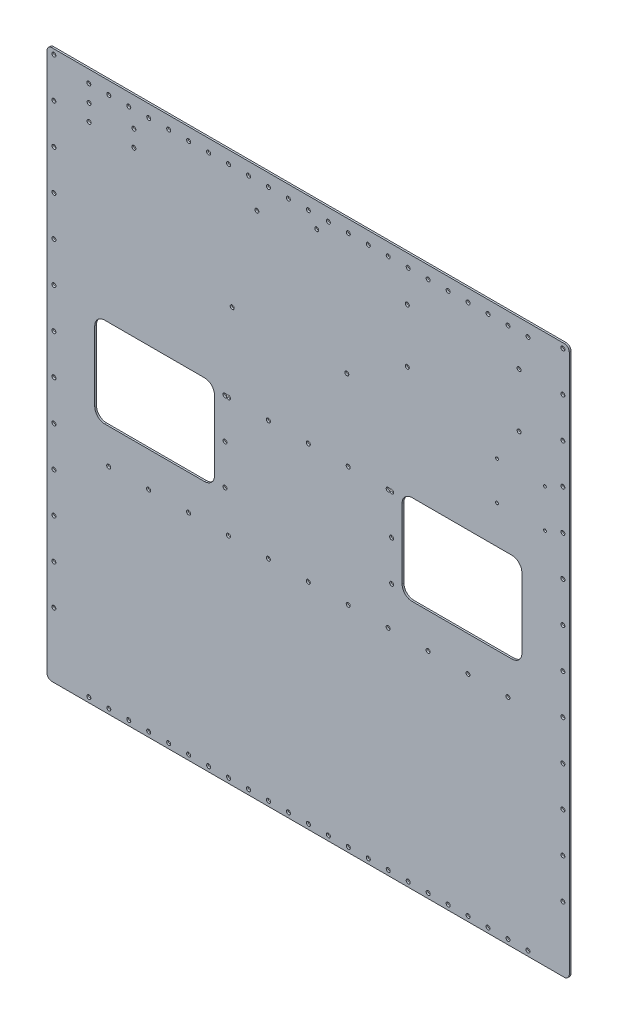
ISO-10303-21;
HEADER;
FILE_DESCRIPTION(('STEP AP214'),'2;1');
FILE_NAME('part.step','',(''),(''),'','','');
FILE_SCHEMA(('AUTOMOTIVE_DESIGN { 1 0 10303 214 1 1 1 1 }'));
ENDSEC;
DATA;
#1=APPLICATION_CONTEXT('core data for automotive mechanical design processes');
#2=APPLICATION_PROTOCOL_DEFINITION('international standard','automotive_design',2000,#1);
#3=PRODUCT_CONTEXT('',#1,'mechanical');
#4=PRODUCT('Part','Part','',(#3));
#5=PRODUCT_RELATED_PRODUCT_CATEGORY('part','',(#4));
#6=PRODUCT_DEFINITION_FORMATION('','',#4);
#7=PRODUCT_DEFINITION_CONTEXT('part definition',#1,'design');
#8=PRODUCT_DEFINITION('design','',#6,#7);
#9=PRODUCT_DEFINITION_SHAPE('','',#8);
#10=(LENGTH_UNIT() NAMED_UNIT(*) SI_UNIT(.MILLI.,.METRE.));
#11=(NAMED_UNIT(*) PLANE_ANGLE_UNIT() SI_UNIT($,.RADIAN.));
#12=(NAMED_UNIT(*) SI_UNIT($,.STERADIAN.) SOLID_ANGLE_UNIT());
#13=UNCERTAINTY_MEASURE_WITH_UNIT(LENGTH_MEASURE(1.E-05),#10,'distance_accuracy_value','');
#14=(GEOMETRIC_REPRESENTATION_CONTEXT(3) GLOBAL_UNCERTAINTY_ASSIGNED_CONTEXT((#13)) GLOBAL_UNIT_ASSIGNED_CONTEXT((#10,
#11,#12)) REPRESENTATION_CONTEXT('',''));
#15=CARTESIAN_POINT('',(0.,0.,0.));
#16=DIRECTION('',(0.,0.,1.));
#17=DIRECTION('',(1.,0.,0.));
#18=AXIS2_PLACEMENT_3D('',#15,#16,#17);
#19=CARTESIAN_POINT('',(78.6130000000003,-425.45,-2.286));
#20=DIRECTION('',(0.,0.,-1.));
#21=DIRECTION('',(-1.,0.,0.));
#22=AXIS2_PLACEMENT_3D('',#19,#20,#21);
#23=CYLINDRICAL_SURFACE('',#22,2.53999999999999);
#24=CARTESIAN_POINT('',(78.6130000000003,-425.45,0.));
#25=DIRECTION('',(0.,0.,1.));
#26=DIRECTION('',(1.,0.,0.));
#27=AXIS2_PLACEMENT_3D('',#24,#25,#26);
#28=CIRCLE('',#27,2.53999999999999);
#29=CARTESIAN_POINT('',(81.1530000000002,-425.45,0.));
#30=VERTEX_POINT('',#29);
#31=EDGE_CURVE('E977',#30,#30,#28,.T.);
#32=ORIENTED_EDGE('',*,*,#31,.T.);
#33=EDGE_LOOP('',(#32));
#34=FACE_BOUND('',#33,.T.);
#35=CARTESIAN_POINT('',(78.6130000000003,-425.45,-2.286));
#36=DIRECTION('',(0.,0.,-1.));
#37=DIRECTION('',(-1.,0.,0.));
#38=AXIS2_PLACEMENT_3D('',#35,#36,#37);
#39=CIRCLE('',#38,2.53999999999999);
#40=CARTESIAN_POINT('',(76.0730000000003,-425.45,-2.286));
#41=VERTEX_POINT('',#40);
#42=EDGE_CURVE('E980',#41,#41,#39,.T.);
#43=ORIENTED_EDGE('',*,*,#42,.T.);
#44=EDGE_LOOP('',(#43));
#45=FACE_BOUND('',#44,.T.);
#46=ADVANCED_FACE('F37',(#34,#45),#23,.F.);
#47=CARTESIAN_POINT('',(129.413,-425.45,-2.286));
#48=DIRECTION('',(0.,0.,-1.));
#49=DIRECTION('',(-1.,0.,0.));
#50=AXIS2_PLACEMENT_3D('',#47,#48,#49);
#51=CYLINDRICAL_SURFACE('',#50,2.53999999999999);
#52=CARTESIAN_POINT('',(129.413,-425.45,0.));
#53=DIRECTION('',(0.,0.,1.));
#54=DIRECTION('',(1.,0.,0.));
#55=AXIS2_PLACEMENT_3D('',#52,#53,#54);
#56=CIRCLE('',#55,2.53999999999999);
#57=CARTESIAN_POINT('',(131.953,-425.45,0.));
#58=VERTEX_POINT('',#57);
#59=EDGE_CURVE('E971',#58,#58,#56,.T.);
#60=ORIENTED_EDGE('',*,*,#59,.T.);
#61=EDGE_LOOP('',(#60));
#62=FACE_BOUND('',#61,.T.);
#63=CARTESIAN_POINT('',(129.413,-425.45,-2.286));
#64=DIRECTION('',(0.,0.,-1.));
#65=DIRECTION('',(-1.,0.,0.));
#66=AXIS2_PLACEMENT_3D('',#63,#64,#65);
#67=CIRCLE('',#66,2.53999999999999);
#68=CARTESIAN_POINT('',(126.873,-425.45,-2.286));
#69=VERTEX_POINT('',#68);
#70=EDGE_CURVE('E974',#69,#69,#67,.T.);
#71=ORIENTED_EDGE('',*,*,#70,.T.);
#72=EDGE_LOOP('',(#71));
#73=FACE_BOUND('',#72,.T.);
#74=ADVANCED_FACE('F1176',(#62,#73),#51,.F.);
#75=CARTESIAN_POINT('',(180.213,-425.45,-2.286));
#76=DIRECTION('',(0.,0.,-1.));
#77=DIRECTION('',(-1.,0.,0.));
#78=AXIS2_PLACEMENT_3D('',#75,#76,#77);
#79=CYLINDRICAL_SURFACE('',#78,2.53999999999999);
#80=CARTESIAN_POINT('',(180.213,-425.45,0.));
#81=DIRECTION('',(0.,0.,1.));
#82=DIRECTION('',(1.,0.,0.));
#83=AXIS2_PLACEMENT_3D('',#80,#81,#82);
#84=CIRCLE('',#83,2.53999999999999);
#85=CARTESIAN_POINT('',(182.753,-425.45,0.));
#86=VERTEX_POINT('',#85);
#87=EDGE_CURVE('E965',#86,#86,#84,.T.);
#88=ORIENTED_EDGE('',*,*,#87,.T.);
#89=EDGE_LOOP('',(#88));
#90=FACE_BOUND('',#89,.T.);
#91=CARTESIAN_POINT('',(180.213,-425.45,-2.286));
#92=DIRECTION('',(0.,0.,-1.));
#93=DIRECTION('',(-1.,0.,0.));
#94=AXIS2_PLACEMENT_3D('',#91,#92,#93);
#95=CIRCLE('',#94,2.53999999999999);
#96=CARTESIAN_POINT('',(177.673,-425.45,-2.286));
#97=VERTEX_POINT('',#96);
#98=EDGE_CURVE('E968',#97,#97,#95,.T.);
#99=ORIENTED_EDGE('',*,*,#98,.T.);
#100=EDGE_LOOP('',(#99));
#101=FACE_BOUND('',#100,.T.);
#102=ADVANCED_FACE('F1487',(#90,#101),#79,.F.);
#103=CARTESIAN_POINT('',(231.013,-273.05,-2.286));
#104=DIRECTION('',(0.,0.,-1.));
#105=DIRECTION('',(-1.,0.,0.));
#106=AXIS2_PLACEMENT_3D('',#103,#104,#105);
#107=CYLINDRICAL_SURFACE('',#106,2.53999999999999);
#108=CARTESIAN_POINT('',(231.013,-273.05,0.));
#109=DIRECTION('',(0.,0.,1.));
#110=DIRECTION('',(1.,0.,0.));
#111=AXIS2_PLACEMENT_3D('',#108,#109,#110);
#112=CIRCLE('',#111,2.53999999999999);
#113=CARTESIAN_POINT('',(228.790500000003,-274.279672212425,0.));
#114=VERTEX_POINT('',#113);
#115=CARTESIAN_POINT('',(228.790500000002,-271.820327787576,0.));
#116=VERTEX_POINT('',#115);
#117=EDGE_CURVE('E959',#114,#116,#112,.T.);
#118=ORIENTED_EDGE('',*,*,#117,.T.);
#119=DIRECTION('',(0.,0.,1.));
#120=VECTOR('',#119,1.);
#121=CARTESIAN_POINT('',(228.790500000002,-271.820327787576,-46.99));
#122=LINE('',#121,#120);
#123=CARTESIAN_POINT('',(228.790500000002,-271.820327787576,-2.286));
#124=VERTEX_POINT('',#123);
#125=EDGE_CURVE('E393',#116,#124,#122,.F.);
#126=ORIENTED_EDGE('',*,*,#125,.T.);
#127=CARTESIAN_POINT('',(231.013,-273.05,-2.286));
#128=DIRECTION('',(0.,0.,-1.));
#129=DIRECTION('',(-1.,0.,0.));
#130=AXIS2_PLACEMENT_3D('',#127,#128,#129);
#131=CIRCLE('',#130,2.53999999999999);
#132=CARTESIAN_POINT('',(228.790500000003,-274.279672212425,-2.286));
#133=VERTEX_POINT('',#132);
#134=EDGE_CURVE('E962',#124,#133,#131,.T.);
#135=ORIENTED_EDGE('',*,*,#134,.T.);
#136=DIRECTION('',(0.,0.,1.));
#137=VECTOR('',#136,1.);
#138=CARTESIAN_POINT('',(228.790500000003,-274.279672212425,-46.99));
#139=LINE('',#138,#137);
#140=EDGE_CURVE('E390',#133,#114,#139,.T.);
#141=ORIENTED_EDGE('',*,*,#140,.T.);
#142=EDGE_LOOP('',(#118,#126,#135,#141));
#143=FACE_BOUND('',#142,.T.);
#144=ADVANCED_FACE('F990',(#143),#107,.F.);
#145=CARTESIAN_POINT('',(231.013,-425.45,-2.286));
#146=DIRECTION('',(0.,0.,-1.));
#147=DIRECTION('',(-1.,0.,0.));
#148=AXIS2_PLACEMENT_3D('',#145,#146,#147);
#149=CYLINDRICAL_SURFACE('',#148,2.53999999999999);
#150=CARTESIAN_POINT('',(231.013,-425.45,0.));
#151=DIRECTION('',(0.,0.,1.));
#152=DIRECTION('',(1.,0.,0.));
#153=AXIS2_PLACEMENT_3D('',#150,#151,#152);
#154=CIRCLE('',#153,2.53999999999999);
#155=CARTESIAN_POINT('',(233.553,-425.45,0.));
#156=VERTEX_POINT('',#155);
#157=EDGE_CURVE('E953',#156,#156,#154,.T.);
#158=ORIENTED_EDGE('',*,*,#157,.T.);
#159=EDGE_LOOP('',(#158));
#160=FACE_BOUND('',#159,.T.);
#161=CARTESIAN_POINT('',(231.013,-425.45,-2.286));
#162=DIRECTION('',(0.,0.,-1.));
#163=DIRECTION('',(-1.,0.,0.));
#164=AXIS2_PLACEMENT_3D('',#161,#162,#163);
#165=CIRCLE('',#164,2.53999999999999);
#166=CARTESIAN_POINT('',(228.473,-425.45,-2.286));
#167=VERTEX_POINT('',#166);
#168=EDGE_CURVE('E956',#167,#167,#165,.T.);
#169=ORIENTED_EDGE('',*,*,#168,.T.);
#170=EDGE_LOOP('',(#169));
#171=FACE_BOUND('',#170,.T.);
#172=ADVANCED_FACE('F1480',(#160,#171),#149,.F.);
#173=CARTESIAN_POINT('',(281.813,-273.05,-2.286));
#174=DIRECTION('',(0.,0.,-1.));
#175=DIRECTION('',(-1.,0.,0.));
#176=AXIS2_PLACEMENT_3D('',#173,#174,#175);
#177=CYLINDRICAL_SURFACE('',#176,2.53999999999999);
#178=CARTESIAN_POINT('',(281.813,-273.05,0.));
#179=DIRECTION('',(0.,0.,1.));
#180=DIRECTION('',(1.,0.,0.));
#181=AXIS2_PLACEMENT_3D('',#178,#179,#180);
#182=CIRCLE('',#181,2.53999999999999);
#183=CARTESIAN_POINT('',(284.353,-273.05,0.));
#184=VERTEX_POINT('',#183);
#185=EDGE_CURVE('E947',#184,#184,#182,.T.);
#186=ORIENTED_EDGE('',*,*,#185,.T.);
#187=EDGE_LOOP('',(#186));
#188=FACE_BOUND('',#187,.T.);
#189=CARTESIAN_POINT('',(281.813,-273.05,-2.286));
#190=DIRECTION('',(0.,0.,-1.));
#191=DIRECTION('',(-1.,0.,0.));
#192=AXIS2_PLACEMENT_3D('',#189,#190,#191);
#193=CIRCLE('',#192,2.53999999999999);
#194=CARTESIAN_POINT('',(279.273,-273.05,-2.286));
#195=VERTEX_POINT('',#194);
#196=EDGE_CURVE('E950',#195,#195,#193,.T.);
#197=ORIENTED_EDGE('',*,*,#196,.T.);
#198=EDGE_LOOP('',(#197));
#199=FACE_BOUND('',#198,.T.);
#200=ADVANCED_FACE('F1476',(#188,#199),#177,.F.);
#201=CARTESIAN_POINT('',(281.813,-425.45,-2.286));
#202=DIRECTION('',(0.,0.,-1.));
#203=DIRECTION('',(-1.,0.,0.));
#204=AXIS2_PLACEMENT_3D('',#201,#202,#203);
#205=CYLINDRICAL_SURFACE('',#204,2.53999999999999);
#206=CARTESIAN_POINT('',(281.813,-425.45,0.));
#207=DIRECTION('',(0.,0.,1.));
#208=DIRECTION('',(1.,0.,0.));
#209=AXIS2_PLACEMENT_3D('',#206,#207,#208);
#210=CIRCLE('',#209,2.53999999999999);
#211=CARTESIAN_POINT('',(284.353,-425.45,0.));
#212=VERTEX_POINT('',#211);
#213=EDGE_CURVE('E941',#212,#212,#210,.T.);
#214=ORIENTED_EDGE('',*,*,#213,.T.);
#215=EDGE_LOOP('',(#214));
#216=FACE_BOUND('',#215,.T.);
#217=CARTESIAN_POINT('',(281.813,-425.45,-2.286));
#218=DIRECTION('',(0.,0.,-1.));
#219=DIRECTION('',(-1.,0.,0.));
#220=AXIS2_PLACEMENT_3D('',#217,#218,#219);
#221=CIRCLE('',#220,2.53999999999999);
#222=CARTESIAN_POINT('',(279.273,-425.45,-2.286));
#223=VERTEX_POINT('',#222);
#224=EDGE_CURVE('E944',#223,#223,#221,.T.);
#225=ORIENTED_EDGE('',*,*,#224,.T.);
#226=EDGE_LOOP('',(#225));
#227=FACE_BOUND('',#226,.T.);
#228=ADVANCED_FACE('F1472',(#216,#227),#205,.F.);
#229=CARTESIAN_POINT('',(332.613,-273.05,-2.286));
#230=DIRECTION('',(0.,0.,-1.));
#231=DIRECTION('',(-1.,0.,0.));
#232=AXIS2_PLACEMENT_3D('',#229,#230,#231);
#233=CYLINDRICAL_SURFACE('',#232,2.53999999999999);
#234=CARTESIAN_POINT('',(332.613,-273.05,0.));
#235=DIRECTION('',(0.,0.,1.));
#236=DIRECTION('',(1.,0.,0.));
#237=AXIS2_PLACEMENT_3D('',#234,#235,#236);
#238=CIRCLE('',#237,2.53999999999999);
#239=CARTESIAN_POINT('',(335.153,-273.05,0.));
#240=VERTEX_POINT('',#239);
#241=EDGE_CURVE('E935',#240,#240,#238,.T.);
#242=ORIENTED_EDGE('',*,*,#241,.T.);
#243=EDGE_LOOP('',(#242));
#244=FACE_BOUND('',#243,.T.);
#245=CARTESIAN_POINT('',(332.613,-273.05,-2.286));
#246=DIRECTION('',(0.,0.,-1.));
#247=DIRECTION('',(-1.,0.,0.));
#248=AXIS2_PLACEMENT_3D('',#245,#246,#247);
#249=CIRCLE('',#248,2.53999999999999);
#250=CARTESIAN_POINT('',(330.073,-273.05,-2.286));
#251=VERTEX_POINT('',#250);
#252=EDGE_CURVE('E938',#251,#251,#249,.T.);
#253=ORIENTED_EDGE('',*,*,#252,.T.);
#254=EDGE_LOOP('',(#253));
#255=FACE_BOUND('',#254,.T.);
#256=ADVANCED_FACE('F1468',(#244,#255),#233,.F.);
#257=CARTESIAN_POINT('',(332.613,-425.45,-2.286));
#258=DIRECTION('',(0.,0.,-1.));
#259=DIRECTION('',(-1.,0.,0.));
#260=AXIS2_PLACEMENT_3D('',#257,#258,#259);
#261=CYLINDRICAL_SURFACE('',#260,2.53999999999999);
#262=CARTESIAN_POINT('',(332.613,-425.45,0.));
#263=DIRECTION('',(0.,0.,1.));
#264=DIRECTION('',(1.,0.,0.));
#265=AXIS2_PLACEMENT_3D('',#262,#263,#264);
#266=CIRCLE('',#265,2.53999999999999);
#267=CARTESIAN_POINT('',(335.153,-425.45,0.));
#268=VERTEX_POINT('',#267);
#269=EDGE_CURVE('E929',#268,#268,#266,.T.);
#270=ORIENTED_EDGE('',*,*,#269,.T.);
#271=EDGE_LOOP('',(#270));
#272=FACE_BOUND('',#271,.T.);
#273=CARTESIAN_POINT('',(332.613,-425.45,-2.286));
#274=DIRECTION('',(0.,0.,-1.));
#275=DIRECTION('',(-1.,0.,0.));
#276=AXIS2_PLACEMENT_3D('',#273,#274,#275);
#277=CIRCLE('',#276,2.53999999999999);
#278=CARTESIAN_POINT('',(330.073,-425.45,-2.286));
#279=VERTEX_POINT('',#278);
#280=EDGE_CURVE('E932',#279,#279,#277,.T.);
#281=ORIENTED_EDGE('',*,*,#280,.T.);
#282=EDGE_LOOP('',(#281));
#283=FACE_BOUND('',#282,.T.);
#284=ADVANCED_FACE('F1464',(#272,#283),#261,.F.);
#285=CARTESIAN_POINT('',(383.413,-273.05,-2.286));
#286=DIRECTION('',(0.,0.,-1.));
#287=DIRECTION('',(-1.,0.,0.));
#288=AXIS2_PLACEMENT_3D('',#285,#286,#287);
#289=CYLINDRICAL_SURFACE('',#288,2.53999999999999);
#290=CARTESIAN_POINT('',(383.413,-273.05,0.));
#291=DIRECTION('',(0.,0.,1.));
#292=DIRECTION('',(1.,0.,0.));
#293=AXIS2_PLACEMENT_3D('',#290,#291,#292);
#294=CIRCLE('',#293,2.53999999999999);
#295=CARTESIAN_POINT('',(385.953,-273.05,0.));
#296=VERTEX_POINT('',#295);
#297=EDGE_CURVE('E923',#296,#296,#294,.T.);
#298=ORIENTED_EDGE('',*,*,#297,.T.);
#299=EDGE_LOOP('',(#298));
#300=FACE_BOUND('',#299,.T.);
#301=CARTESIAN_POINT('',(383.413,-273.05,-2.286));
#302=DIRECTION('',(0.,0.,-1.));
#303=DIRECTION('',(-1.,0.,0.));
#304=AXIS2_PLACEMENT_3D('',#301,#302,#303);
#305=CIRCLE('',#304,2.53999999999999);
#306=CARTESIAN_POINT('',(380.873,-273.05,-2.286));
#307=VERTEX_POINT('',#306);
#308=EDGE_CURVE('E926',#307,#307,#305,.T.);
#309=ORIENTED_EDGE('',*,*,#308,.T.);
#310=EDGE_LOOP('',(#309));
#311=FACE_BOUND('',#310,.T.);
#312=ADVANCED_FACE('F1460',(#300,#311),#289,.F.);
#313=CARTESIAN_POINT('',(383.413,-425.45,-2.286));
#314=DIRECTION('',(0.,0.,-1.));
#315=DIRECTION('',(-1.,0.,0.));
#316=AXIS2_PLACEMENT_3D('',#313,#314,#315);
#317=CYLINDRICAL_SURFACE('',#316,2.53999999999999);
#318=CARTESIAN_POINT('',(383.413,-425.45,0.));
#319=DIRECTION('',(0.,0.,1.));
#320=DIRECTION('',(1.,0.,0.));
#321=AXIS2_PLACEMENT_3D('',#318,#319,#320);
#322=CIRCLE('',#321,2.53999999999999);
#323=CARTESIAN_POINT('',(385.953,-425.45,0.));
#324=VERTEX_POINT('',#323);
#325=EDGE_CURVE('E917',#324,#324,#322,.T.);
#326=ORIENTED_EDGE('',*,*,#325,.T.);
#327=EDGE_LOOP('',(#326));
#328=FACE_BOUND('',#327,.T.);
#329=CARTESIAN_POINT('',(383.413,-425.45,-2.286));
#330=DIRECTION('',(0.,0.,-1.));
#331=DIRECTION('',(-1.,0.,0.));
#332=AXIS2_PLACEMENT_3D('',#329,#330,#331);
#333=CIRCLE('',#332,2.53999999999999);
#334=CARTESIAN_POINT('',(380.873,-425.45,-2.286));
#335=VERTEX_POINT('',#334);
#336=EDGE_CURVE('E920',#335,#335,#333,.T.);
#337=ORIENTED_EDGE('',*,*,#336,.T.);
#338=EDGE_LOOP('',(#337));
#339=FACE_BOUND('',#338,.T.);
#340=ADVANCED_FACE('F1456',(#328,#339),#317,.F.);
#341=CARTESIAN_POINT('',(434.213,-273.05,-2.286));
#342=DIRECTION('',(0.,0.,-1.));
#343=DIRECTION('',(-1.,0.,0.));
#344=AXIS2_PLACEMENT_3D('',#341,#342,#343);
#345=CYLINDRICAL_SURFACE('',#344,2.53999999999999);
#346=CARTESIAN_POINT('',(434.213,-273.05,0.));
#347=DIRECTION('',(0.,0.,1.));
#348=DIRECTION('',(1.,0.,0.));
#349=AXIS2_PLACEMENT_3D('',#346,#347,#348);
#350=CIRCLE('',#349,2.53999999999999);
#351=CARTESIAN_POINT('',(436.435500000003,-271.820327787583,0.));
#352=VERTEX_POINT('',#351);
#353=CARTESIAN_POINT('',(436.435500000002,-274.279672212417,0.));
#354=VERTEX_POINT('',#353);
#355=EDGE_CURVE('E911',#352,#354,#350,.T.);
#356=ORIENTED_EDGE('',*,*,#355,.T.);
#357=DIRECTION('',(0.,0.,1.));
#358=VECTOR('',#357,1.);
#359=CARTESIAN_POINT('',(436.435500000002,-274.279672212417,-46.99));
#360=LINE('',#359,#358);
#361=CARTESIAN_POINT('',(436.435500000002,-274.279672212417,-2.286));
#362=VERTEX_POINT('',#361);
#363=EDGE_CURVE('E361',#354,#362,#360,.F.);
#364=ORIENTED_EDGE('',*,*,#363,.T.);
#365=CARTESIAN_POINT('',(434.213,-273.05,-2.286));
#366=DIRECTION('',(0.,0.,-1.));
#367=DIRECTION('',(-1.,0.,0.));
#368=AXIS2_PLACEMENT_3D('',#365,#366,#367);
#369=CIRCLE('',#368,2.53999999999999);
#370=CARTESIAN_POINT('',(436.435500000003,-271.820327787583,-2.286));
#371=VERTEX_POINT('',#370);
#372=EDGE_CURVE('E914',#362,#371,#369,.T.);
#373=ORIENTED_EDGE('',*,*,#372,.T.);
#374=DIRECTION('',(0.,0.,1.));
#375=VECTOR('',#374,1.);
#376=CARTESIAN_POINT('',(436.435500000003,-271.820327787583,-46.99));
#377=LINE('',#376,#375);
#378=EDGE_CURVE('E358',#371,#352,#377,.T.);
#379=ORIENTED_EDGE('',*,*,#378,.T.);
#380=EDGE_LOOP('',(#356,#364,#373,#379));
#381=FACE_BOUND('',#380,.T.);
#382=ADVANCED_FACE('F1452',(#381),#345,.F.);
#383=CARTESIAN_POINT('',(434.213,-425.45,-2.286));
#384=DIRECTION('',(0.,0.,-1.));
#385=DIRECTION('',(-1.,0.,0.));
#386=AXIS2_PLACEMENT_3D('',#383,#384,#385);
#387=CYLINDRICAL_SURFACE('',#386,2.53999999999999);
#388=CARTESIAN_POINT('',(434.213,-425.45,0.));
#389=DIRECTION('',(0.,0.,1.));
#390=DIRECTION('',(1.,0.,0.));
#391=AXIS2_PLACEMENT_3D('',#388,#389,#390);
#392=CIRCLE('',#391,2.53999999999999);
#393=CARTESIAN_POINT('',(436.753,-425.45,0.));
#394=VERTEX_POINT('',#393);
#395=EDGE_CURVE('E905',#394,#394,#392,.T.);
#396=ORIENTED_EDGE('',*,*,#395,.T.);
#397=EDGE_LOOP('',(#396));
#398=FACE_BOUND('',#397,.T.);
#399=CARTESIAN_POINT('',(434.213,-425.45,-2.286));
#400=DIRECTION('',(0.,0.,-1.));
#401=DIRECTION('',(-1.,0.,0.));
#402=AXIS2_PLACEMENT_3D('',#399,#400,#401);
#403=CIRCLE('',#402,2.53999999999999);
#404=CARTESIAN_POINT('',(431.673,-425.45,-2.286));
#405=VERTEX_POINT('',#404);
#406=EDGE_CURVE('E908',#405,#405,#403,.T.);
#407=ORIENTED_EDGE('',*,*,#406,.T.);
#408=EDGE_LOOP('',(#407));
#409=FACE_BOUND('',#408,.T.);
#410=ADVANCED_FACE('F1448',(#398,#409),#387,.F.);
#411=CARTESIAN_POINT('',(485.013,-425.45,-2.286));
#412=DIRECTION('',(0.,0.,-1.));
#413=DIRECTION('',(-1.,0.,0.));
#414=AXIS2_PLACEMENT_3D('',#411,#412,#413);
#415=CYLINDRICAL_SURFACE('',#414,2.53999999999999);
#416=CARTESIAN_POINT('',(485.013,-425.45,0.));
#417=DIRECTION('',(0.,0.,1.));
#418=DIRECTION('',(1.,0.,0.));
#419=AXIS2_PLACEMENT_3D('',#416,#417,#418);
#420=CIRCLE('',#419,2.53999999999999);
#421=CARTESIAN_POINT('',(487.553,-425.45,0.));
#422=VERTEX_POINT('',#421);
#423=EDGE_CURVE('E899',#422,#422,#420,.T.);
#424=ORIENTED_EDGE('',*,*,#423,.T.);
#425=EDGE_LOOP('',(#424));
#426=FACE_BOUND('',#425,.T.);
#427=CARTESIAN_POINT('',(485.013,-425.45,-2.286));
#428=DIRECTION('',(0.,0.,-1.));
#429=DIRECTION('',(-1.,0.,0.));
#430=AXIS2_PLACEMENT_3D('',#427,#428,#429);
#431=CIRCLE('',#430,2.53999999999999);
#432=CARTESIAN_POINT('',(482.473,-425.45,-2.286));
#433=VERTEX_POINT('',#432);
#434=EDGE_CURVE('E902',#433,#433,#431,.T.);
#435=ORIENTED_EDGE('',*,*,#434,.T.);
#436=EDGE_LOOP('',(#435));
#437=FACE_BOUND('',#436,.T.);
#438=ADVANCED_FACE('F1444',(#426,#437),#415,.F.);
#439=CARTESIAN_POINT('',(535.813,-425.45,-2.286));
#440=DIRECTION('',(0.,0.,-1.));
#441=DIRECTION('',(-1.,0.,0.));
#442=AXIS2_PLACEMENT_3D('',#439,#440,#441);
#443=CYLINDRICAL_SURFACE('',#442,2.53999999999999);
#444=CARTESIAN_POINT('',(535.813,-425.45,0.));
#445=DIRECTION('',(0.,0.,1.));
#446=DIRECTION('',(1.,0.,0.));
#447=AXIS2_PLACEMENT_3D('',#444,#445,#446);
#448=CIRCLE('',#447,2.53999999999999);
#449=CARTESIAN_POINT('',(538.353,-425.45,0.));
#450=VERTEX_POINT('',#449);
#451=EDGE_CURVE('E891',#450,#450,#448,.T.);
#452=ORIENTED_EDGE('',*,*,#451,.T.);
#453=EDGE_LOOP('',(#452));
#454=FACE_BOUND('',#453,.T.);
#455=CARTESIAN_POINT('',(535.813,-425.45,-2.286));
#456=DIRECTION('',(0.,0.,-1.));
#457=DIRECTION('',(-1.,0.,0.));
#458=AXIS2_PLACEMENT_3D('',#455,#456,#457);
#459=CIRCLE('',#458,2.53999999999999);
#460=CARTESIAN_POINT('',(533.273,-425.45,-2.286));
#461=VERTEX_POINT('',#460);
#462=EDGE_CURVE('E896',#461,#461,#459,.T.);
#463=ORIENTED_EDGE('',*,*,#462,.T.);
#464=EDGE_LOOP('',(#463));
#465=FACE_BOUND('',#464,.T.);
#466=ADVANCED_FACE('F1440',(#454,#465),#443,.F.);
#467=CARTESIAN_POINT('',(53.3399999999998,-15.8750000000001,0.));
#468=DIRECTION('',(0.,0.,1.));
#469=DIRECTION('',(1.,0.,0.));
#470=AXIS2_PLACEMENT_3D('',#467,#468,#469);
#471=CYLINDRICAL_SURFACE('',#470,2.53999999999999);
#472=CARTESIAN_POINT('',(53.3399999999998,-15.8750000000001,0.));
#473=DIRECTION('',(0.,0.,1.));
#474=DIRECTION('',(1.,0.,0.));
#475=AXIS2_PLACEMENT_3D('',#472,#473,#474);
#476=CIRCLE('',#475,2.53999999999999);
#477=CARTESIAN_POINT('',(55.8799999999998,-15.8750000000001,0.));
#478=VERTEX_POINT('',#477);
#479=EDGE_CURVE('E885',#478,#478,#476,.T.);
#480=ORIENTED_EDGE('',*,*,#479,.T.);
#481=EDGE_LOOP('',(#480));
#482=FACE_BOUND('',#481,.T.);
#483=CARTESIAN_POINT('',(53.3399999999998,-15.8750000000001,-2.286));
#484=DIRECTION('',(0.,0.,1.));
#485=DIRECTION('',(1.,0.,0.));
#486=AXIS2_PLACEMENT_3D('',#483,#484,#485);
#487=CIRCLE('',#486,2.53999999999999);
#488=CARTESIAN_POINT('',(55.8799999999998,-15.8750000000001,-2.286));
#489=VERTEX_POINT('',#488);
#490=EDGE_CURVE('E888',#489,#489,#487,.T.);
#491=ORIENTED_EDGE('',*,*,#490,.F.);
#492=EDGE_LOOP('',(#491));
#493=FACE_BOUND('',#492,.T.);
#494=ADVANCED_FACE('F1436',(#482,#493),#471,.F.);
#495=CARTESIAN_POINT('',(78.7399999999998,-15.8750000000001,0.));
#496=DIRECTION('',(0.,0.,1.));
#497=DIRECTION('',(1.,0.,0.));
#498=AXIS2_PLACEMENT_3D('',#495,#496,#497);
#499=CYLINDRICAL_SURFACE('',#498,2.53999999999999);
#500=CARTESIAN_POINT('',(78.7399999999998,-15.8750000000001,0.));
#501=DIRECTION('',(0.,0.,1.));
#502=DIRECTION('',(1.,0.,0.));
#503=AXIS2_PLACEMENT_3D('',#500,#501,#502);
#504=CIRCLE('',#503,2.53999999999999);
#505=CARTESIAN_POINT('',(81.2799999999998,-15.8750000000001,0.));
#506=VERTEX_POINT('',#505);
#507=EDGE_CURVE('E879',#506,#506,#504,.T.);
#508=ORIENTED_EDGE('',*,*,#507,.T.);
#509=EDGE_LOOP('',(#508));
#510=FACE_BOUND('',#509,.T.);
#511=CARTESIAN_POINT('',(78.7399999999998,-15.8750000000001,-2.286));
#512=DIRECTION('',(0.,0.,1.));
#513=DIRECTION('',(1.,0.,0.));
#514=AXIS2_PLACEMENT_3D('',#511,#512,#513);
#515=CIRCLE('',#514,2.53999999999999);
#516=CARTESIAN_POINT('',(81.2799999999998,-15.8750000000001,-2.286));
#517=VERTEX_POINT('',#516);
#518=EDGE_CURVE('E882',#517,#517,#515,.T.);
#519=ORIENTED_EDGE('',*,*,#518,.F.);
#520=EDGE_LOOP('',(#519));
#521=FACE_BOUND('',#520,.T.);
#522=ADVANCED_FACE('F1432',(#510,#521),#499,.F.);
#523=CARTESIAN_POINT('',(104.14,-15.8750000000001,0.));
#524=DIRECTION('',(0.,0.,1.));
#525=DIRECTION('',(1.,0.,0.));
#526=AXIS2_PLACEMENT_3D('',#523,#524,#525);
#527=CYLINDRICAL_SURFACE('',#526,2.53999999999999);
#528=CARTESIAN_POINT('',(104.14,-15.8750000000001,0.));
#529=DIRECTION('',(0.,0.,1.));
#530=DIRECTION('',(1.,0.,0.));
#531=AXIS2_PLACEMENT_3D('',#528,#529,#530);
#532=CIRCLE('',#531,2.53999999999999);
#533=CARTESIAN_POINT('',(106.68,-15.8750000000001,0.));
#534=VERTEX_POINT('',#533);
#535=EDGE_CURVE('E873',#534,#534,#532,.T.);
#536=ORIENTED_EDGE('',*,*,#535,.T.);
#537=EDGE_LOOP('',(#536));
#538=FACE_BOUND('',#537,.T.);
#539=CARTESIAN_POINT('',(104.14,-15.8750000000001,-2.286));
#540=DIRECTION('',(0.,0.,1.));
#541=DIRECTION('',(1.,0.,0.));
#542=AXIS2_PLACEMENT_3D('',#539,#540,#541);
#543=CIRCLE('',#542,2.53999999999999);
#544=CARTESIAN_POINT('',(106.68,-15.8750000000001,-2.286));
#545=VERTEX_POINT('',#544);
#546=EDGE_CURVE('E876',#545,#545,#543,.T.);
#547=ORIENTED_EDGE('',*,*,#546,.F.);
#548=EDGE_LOOP('',(#547));
#549=FACE_BOUND('',#548,.T.);
#550=ADVANCED_FACE('F1428',(#538,#549),#527,.F.);
#551=CARTESIAN_POINT('',(129.54,-15.8750000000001,0.));
#552=DIRECTION('',(0.,0.,1.));
#553=DIRECTION('',(1.,0.,0.));
#554=AXIS2_PLACEMENT_3D('',#551,#552,#553);
#555=CYLINDRICAL_SURFACE('',#554,2.53999999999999);
#556=CARTESIAN_POINT('',(129.54,-15.8750000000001,0.));
#557=DIRECTION('',(0.,0.,1.));
#558=DIRECTION('',(1.,0.,0.));
#559=AXIS2_PLACEMENT_3D('',#556,#557,#558);
#560=CIRCLE('',#559,2.53999999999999);
#561=CARTESIAN_POINT('',(132.08,-15.8750000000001,0.));
#562=VERTEX_POINT('',#561);
#563=EDGE_CURVE('E867',#562,#562,#560,.T.);
#564=ORIENTED_EDGE('',*,*,#563,.T.);
#565=EDGE_LOOP('',(#564));
#566=FACE_BOUND('',#565,.T.);
#567=CARTESIAN_POINT('',(129.54,-15.8750000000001,-2.286));
#568=DIRECTION('',(0.,0.,1.));
#569=DIRECTION('',(1.,0.,0.));
#570=AXIS2_PLACEMENT_3D('',#567,#568,#569);
#571=CIRCLE('',#570,2.53999999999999);
#572=CARTESIAN_POINT('',(132.08,-15.8750000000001,-2.286));
#573=VERTEX_POINT('',#572);
#574=EDGE_CURVE('E870',#573,#573,#571,.T.);
#575=ORIENTED_EDGE('',*,*,#574,.F.);
#576=EDGE_LOOP('',(#575));
#577=FACE_BOUND('',#576,.T.);
#578=ADVANCED_FACE('F1424',(#566,#577),#555,.F.);
#579=CARTESIAN_POINT('',(154.94,-15.8750000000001,0.));
#580=DIRECTION('',(0.,0.,1.));
#581=DIRECTION('',(1.,0.,0.));
#582=AXIS2_PLACEMENT_3D('',#579,#580,#581);
#583=CYLINDRICAL_SURFACE('',#582,2.53999999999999);
#584=CARTESIAN_POINT('',(154.94,-15.8750000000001,0.));
#585=DIRECTION('',(0.,0.,1.));
#586=DIRECTION('',(1.,0.,0.));
#587=AXIS2_PLACEMENT_3D('',#584,#585,#586);
#588=CIRCLE('',#587,2.53999999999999);
#589=CARTESIAN_POINT('',(157.48,-15.8750000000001,0.));
#590=VERTEX_POINT('',#589);
#591=EDGE_CURVE('E861',#590,#590,#588,.T.);
#592=ORIENTED_EDGE('',*,*,#591,.T.);
#593=EDGE_LOOP('',(#592));
#594=FACE_BOUND('',#593,.T.);
#595=CARTESIAN_POINT('',(154.94,-15.8750000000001,-2.286));
#596=DIRECTION('',(0.,0.,1.));
#597=DIRECTION('',(1.,0.,0.));
#598=AXIS2_PLACEMENT_3D('',#595,#596,#597);
#599=CIRCLE('',#598,2.53999999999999);
#600=CARTESIAN_POINT('',(157.48,-15.8750000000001,-2.286));
#601=VERTEX_POINT('',#600);
#602=EDGE_CURVE('E864',#601,#601,#599,.T.);
#603=ORIENTED_EDGE('',*,*,#602,.F.);
#604=EDGE_LOOP('',(#603));
#605=FACE_BOUND('',#604,.T.);
#606=ADVANCED_FACE('F1420',(#594,#605),#583,.F.);
#607=CARTESIAN_POINT('',(180.34,-15.8750000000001,0.));
#608=DIRECTION('',(0.,0.,1.));
#609=DIRECTION('',(1.,0.,0.));
#610=AXIS2_PLACEMENT_3D('',#607,#608,#609);
#611=CYLINDRICAL_SURFACE('',#610,2.53999999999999);
#612=CARTESIAN_POINT('',(180.34,-15.8750000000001,0.));
#613=DIRECTION('',(0.,0.,1.));
#614=DIRECTION('',(1.,0.,0.));
#615=AXIS2_PLACEMENT_3D('',#612,#613,#614);
#616=CIRCLE('',#615,2.53999999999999);
#617=CARTESIAN_POINT('',(182.88,-15.8750000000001,0.));
#618=VERTEX_POINT('',#617);
#619=EDGE_CURVE('E855',#618,#618,#616,.T.);
#620=ORIENTED_EDGE('',*,*,#619,.T.);
#621=EDGE_LOOP('',(#620));
#622=FACE_BOUND('',#621,.T.);
#623=CARTESIAN_POINT('',(180.34,-15.8750000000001,-2.286));
#624=DIRECTION('',(0.,0.,1.));
#625=DIRECTION('',(1.,0.,0.));
#626=AXIS2_PLACEMENT_3D('',#623,#624,#625);
#627=CIRCLE('',#626,2.53999999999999);
#628=CARTESIAN_POINT('',(182.88,-15.8750000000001,-2.286));
#629=VERTEX_POINT('',#628);
#630=EDGE_CURVE('E858',#629,#629,#627,.T.);
#631=ORIENTED_EDGE('',*,*,#630,.F.);
#632=EDGE_LOOP('',(#631));
#633=FACE_BOUND('',#632,.T.);
#634=ADVANCED_FACE('F1416',(#622,#633),#611,.F.);
#635=CARTESIAN_POINT('',(205.74,-15.8750000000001,0.));
#636=DIRECTION('',(0.,0.,1.));
#637=DIRECTION('',(1.,0.,0.));
#638=AXIS2_PLACEMENT_3D('',#635,#636,#637);
#639=CYLINDRICAL_SURFACE('',#638,2.53999999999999);
#640=CARTESIAN_POINT('',(205.74,-15.8750000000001,0.));
#641=DIRECTION('',(0.,0.,1.));
#642=DIRECTION('',(1.,0.,0.));
#643=AXIS2_PLACEMENT_3D('',#640,#641,#642);
#644=CIRCLE('',#643,2.53999999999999);
#645=CARTESIAN_POINT('',(208.28,-15.8750000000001,0.));
#646=VERTEX_POINT('',#645);
#647=EDGE_CURVE('E849',#646,#646,#644,.T.);
#648=ORIENTED_EDGE('',*,*,#647,.T.);
#649=EDGE_LOOP('',(#648));
#650=FACE_BOUND('',#649,.T.);
#651=CARTESIAN_POINT('',(205.74,-15.8750000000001,-2.286));
#652=DIRECTION('',(0.,0.,1.));
#653=DIRECTION('',(1.,0.,0.));
#654=AXIS2_PLACEMENT_3D('',#651,#652,#653);
#655=CIRCLE('',#654,2.53999999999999);
#656=CARTESIAN_POINT('',(208.28,-15.8750000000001,-2.286));
#657=VERTEX_POINT('',#656);
#658=EDGE_CURVE('E852',#657,#657,#655,.T.);
#659=ORIENTED_EDGE('',*,*,#658,.F.);
#660=EDGE_LOOP('',(#659));
#661=FACE_BOUND('',#660,.T.);
#662=ADVANCED_FACE('F1412',(#650,#661),#639,.F.);
#663=CARTESIAN_POINT('',(231.14,-15.8750000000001,0.));
#664=DIRECTION('',(0.,0.,1.));
#665=DIRECTION('',(1.,0.,0.));
#666=AXIS2_PLACEMENT_3D('',#663,#664,#665);
#667=CYLINDRICAL_SURFACE('',#666,2.53999999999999);
#668=CARTESIAN_POINT('',(231.14,-15.8750000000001,0.));
#669=DIRECTION('',(0.,0.,1.));
#670=DIRECTION('',(1.,0.,0.));
#671=AXIS2_PLACEMENT_3D('',#668,#669,#670);
#672=CIRCLE('',#671,2.53999999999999);
#673=CARTESIAN_POINT('',(233.68,-15.8750000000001,0.));
#674=VERTEX_POINT('',#673);
#675=EDGE_CURVE('E843',#674,#674,#672,.T.);
#676=ORIENTED_EDGE('',*,*,#675,.T.);
#677=EDGE_LOOP('',(#676));
#678=FACE_BOUND('',#677,.T.);
#679=CARTESIAN_POINT('',(231.14,-15.8750000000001,-2.286));
#680=DIRECTION('',(0.,0.,1.));
#681=DIRECTION('',(1.,0.,0.));
#682=AXIS2_PLACEMENT_3D('',#679,#680,#681);
#683=CIRCLE('',#682,2.53999999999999);
#684=CARTESIAN_POINT('',(233.68,-15.8750000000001,-2.286));
#685=VERTEX_POINT('',#684);
#686=EDGE_CURVE('E846',#685,#685,#683,.T.);
#687=ORIENTED_EDGE('',*,*,#686,.F.);
#688=EDGE_LOOP('',(#687));
#689=FACE_BOUND('',#688,.T.);
#690=ADVANCED_FACE('F1408',(#678,#689),#667,.F.);
#691=CARTESIAN_POINT('',(256.54,-15.8750000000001,0.));
#692=DIRECTION('',(0.,0.,1.));
#693=DIRECTION('',(1.,0.,0.));
#694=AXIS2_PLACEMENT_3D('',#691,#692,#693);
#695=CYLINDRICAL_SURFACE('',#694,2.53999999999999);
#696=CARTESIAN_POINT('',(256.54,-15.8750000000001,0.));
#697=DIRECTION('',(0.,0.,1.));
#698=DIRECTION('',(1.,0.,0.));
#699=AXIS2_PLACEMENT_3D('',#696,#697,#698);
#700=CIRCLE('',#699,2.53999999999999);
#701=CARTESIAN_POINT('',(259.08,-15.8750000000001,0.));
#702=VERTEX_POINT('',#701);
#703=EDGE_CURVE('E837',#702,#702,#700,.T.);
#704=ORIENTED_EDGE('',*,*,#703,.T.);
#705=EDGE_LOOP('',(#704));
#706=FACE_BOUND('',#705,.T.);
#707=CARTESIAN_POINT('',(256.54,-15.8750000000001,-2.286));
#708=DIRECTION('',(0.,0.,1.));
#709=DIRECTION('',(1.,0.,0.));
#710=AXIS2_PLACEMENT_3D('',#707,#708,#709);
#711=CIRCLE('',#710,2.53999999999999);
#712=CARTESIAN_POINT('',(259.08,-15.8750000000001,-2.286));
#713=VERTEX_POINT('',#712);
#714=EDGE_CURVE('E840',#713,#713,#711,.T.);
#715=ORIENTED_EDGE('',*,*,#714,.F.);
#716=EDGE_LOOP('',(#715));
#717=FACE_BOUND('',#716,.T.);
#718=ADVANCED_FACE('F1404',(#706,#717),#695,.F.);
#719=CARTESIAN_POINT('',(281.94,-15.8750000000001,0.));
#720=DIRECTION('',(0.,0.,1.));
#721=DIRECTION('',(1.,0.,0.));
#722=AXIS2_PLACEMENT_3D('',#719,#720,#721);
#723=CYLINDRICAL_SURFACE('',#722,2.53999999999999);
#724=CARTESIAN_POINT('',(281.94,-15.8750000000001,0.));
#725=DIRECTION('',(0.,0.,1.));
#726=DIRECTION('',(1.,0.,0.));
#727=AXIS2_PLACEMENT_3D('',#724,#725,#726);
#728=CIRCLE('',#727,2.53999999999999);
#729=CARTESIAN_POINT('',(284.48,-15.8750000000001,0.));
#730=VERTEX_POINT('',#729);
#731=EDGE_CURVE('E831',#730,#730,#728,.T.);
#732=ORIENTED_EDGE('',*,*,#731,.T.);
#733=EDGE_LOOP('',(#732));
#734=FACE_BOUND('',#733,.T.);
#735=CARTESIAN_POINT('',(281.94,-15.8750000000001,-2.286));
#736=DIRECTION('',(0.,0.,1.));
#737=DIRECTION('',(1.,0.,0.));
#738=AXIS2_PLACEMENT_3D('',#735,#736,#737);
#739=CIRCLE('',#738,2.53999999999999);
#740=CARTESIAN_POINT('',(284.48,-15.8750000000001,-2.286));
#741=VERTEX_POINT('',#740);
#742=EDGE_CURVE('E834',#741,#741,#739,.T.);
#743=ORIENTED_EDGE('',*,*,#742,.F.);
#744=EDGE_LOOP('',(#743));
#745=FACE_BOUND('',#744,.T.);
#746=ADVANCED_FACE('F1400',(#734,#745),#723,.F.);
#747=CARTESIAN_POINT('',(307.34,-15.8750000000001,0.));
#748=DIRECTION('',(0.,0.,1.));
#749=DIRECTION('',(1.,0.,0.));
#750=AXIS2_PLACEMENT_3D('',#747,#748,#749);
#751=CYLINDRICAL_SURFACE('',#750,2.53999999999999);
#752=CARTESIAN_POINT('',(307.34,-15.8750000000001,0.));
#753=DIRECTION('',(0.,0.,1.));
#754=DIRECTION('',(1.,0.,0.));
#755=AXIS2_PLACEMENT_3D('',#752,#753,#754);
#756=CIRCLE('',#755,2.53999999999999);
#757=CARTESIAN_POINT('',(309.88,-15.8750000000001,0.));
#758=VERTEX_POINT('',#757);
#759=EDGE_CURVE('E825',#758,#758,#756,.T.);
#760=ORIENTED_EDGE('',*,*,#759,.T.);
#761=EDGE_LOOP('',(#760));
#762=FACE_BOUND('',#761,.T.);
#763=CARTESIAN_POINT('',(307.34,-15.8750000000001,-2.286));
#764=DIRECTION('',(0.,0.,1.));
#765=DIRECTION('',(1.,0.,0.));
#766=AXIS2_PLACEMENT_3D('',#763,#764,#765);
#767=CIRCLE('',#766,2.53999999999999);
#768=CARTESIAN_POINT('',(309.88,-15.8750000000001,-2.286));
#769=VERTEX_POINT('',#768);
#770=EDGE_CURVE('E828',#769,#769,#767,.T.);
#771=ORIENTED_EDGE('',*,*,#770,.F.);
#772=EDGE_LOOP('',(#771));
#773=FACE_BOUND('',#772,.T.);
#774=ADVANCED_FACE('F1396',(#762,#773),#751,.F.);
#775=CARTESIAN_POINT('',(332.74,-15.8750000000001,0.));
#776=DIRECTION('',(0.,0.,1.));
#777=DIRECTION('',(1.,0.,0.));
#778=AXIS2_PLACEMENT_3D('',#775,#776,#777);
#779=CYLINDRICAL_SURFACE('',#778,2.53999999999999);
#780=CARTESIAN_POINT('',(332.74,-15.8750000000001,0.));
#781=DIRECTION('',(0.,0.,1.));
#782=DIRECTION('',(1.,0.,0.));
#783=AXIS2_PLACEMENT_3D('',#780,#781,#782);
#784=CIRCLE('',#783,2.53999999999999);
#785=CARTESIAN_POINT('',(335.28,-15.8750000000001,0.));
#786=VERTEX_POINT('',#785);
#787=EDGE_CURVE('E819',#786,#786,#784,.T.);
#788=ORIENTED_EDGE('',*,*,#787,.T.);
#789=EDGE_LOOP('',(#788));
#790=FACE_BOUND('',#789,.T.);
#791=CARTESIAN_POINT('',(332.74,-15.8750000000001,-2.286));
#792=DIRECTION('',(0.,0.,1.));
#793=DIRECTION('',(1.,0.,0.));
#794=AXIS2_PLACEMENT_3D('',#791,#792,#793);
#795=CIRCLE('',#794,2.53999999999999);
#796=CARTESIAN_POINT('',(335.28,-15.8750000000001,-2.286));
#797=VERTEX_POINT('',#796);
#798=EDGE_CURVE('E822',#797,#797,#795,.T.);
#799=ORIENTED_EDGE('',*,*,#798,.F.);
#800=EDGE_LOOP('',(#799));
#801=FACE_BOUND('',#800,.T.);
#802=ADVANCED_FACE('F1392',(#790,#801),#779,.F.);
#803=CARTESIAN_POINT('',(358.14,-15.8750000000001,0.));
#804=DIRECTION('',(0.,0.,1.));
#805=DIRECTION('',(1.,0.,0.));
#806=AXIS2_PLACEMENT_3D('',#803,#804,#805);
#807=CYLINDRICAL_SURFACE('',#806,2.53999999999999);
#808=CARTESIAN_POINT('',(358.14,-15.8750000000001,0.));
#809=DIRECTION('',(0.,0.,1.));
#810=DIRECTION('',(1.,0.,0.));
#811=AXIS2_PLACEMENT_3D('',#808,#809,#810);
#812=CIRCLE('',#811,2.53999999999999);
#813=CARTESIAN_POINT('',(360.68,-15.8750000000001,0.));
#814=VERTEX_POINT('',#813);
#815=EDGE_CURVE('E813',#814,#814,#812,.T.);
#816=ORIENTED_EDGE('',*,*,#815,.T.);
#817=EDGE_LOOP('',(#816));
#818=FACE_BOUND('',#817,.T.);
#819=CARTESIAN_POINT('',(358.14,-15.8750000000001,-2.286));
#820=DIRECTION('',(0.,0.,1.));
#821=DIRECTION('',(1.,0.,0.));
#822=AXIS2_PLACEMENT_3D('',#819,#820,#821);
#823=CIRCLE('',#822,2.53999999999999);
#824=CARTESIAN_POINT('',(360.68,-15.8750000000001,-2.286));
#825=VERTEX_POINT('',#824);
#826=EDGE_CURVE('E816',#825,#825,#823,.T.);
#827=ORIENTED_EDGE('',*,*,#826,.F.);
#828=EDGE_LOOP('',(#827));
#829=FACE_BOUND('',#828,.T.);
#830=ADVANCED_FACE('F1388',(#818,#829),#807,.F.);
#831=CARTESIAN_POINT('',(383.54,-15.8750000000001,0.));
#832=DIRECTION('',(0.,0.,1.));
#833=DIRECTION('',(1.,0.,0.));
#834=AXIS2_PLACEMENT_3D('',#831,#832,#833);
#835=CYLINDRICAL_SURFACE('',#834,2.53999999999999);
#836=CARTESIAN_POINT('',(383.54,-15.8750000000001,0.));
#837=DIRECTION('',(0.,0.,1.));
#838=DIRECTION('',(1.,0.,0.));
#839=AXIS2_PLACEMENT_3D('',#836,#837,#838);
#840=CIRCLE('',#839,2.53999999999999);
#841=CARTESIAN_POINT('',(386.08,-15.8750000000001,0.));
#842=VERTEX_POINT('',#841);
#843=EDGE_CURVE('E807',#842,#842,#840,.T.);
#844=ORIENTED_EDGE('',*,*,#843,.T.);
#845=EDGE_LOOP('',(#844));
#846=FACE_BOUND('',#845,.T.);
#847=CARTESIAN_POINT('',(383.54,-15.8750000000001,-2.286));
#848=DIRECTION('',(0.,0.,1.));
#849=DIRECTION('',(1.,0.,0.));
#850=AXIS2_PLACEMENT_3D('',#847,#848,#849);
#851=CIRCLE('',#850,2.53999999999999);
#852=CARTESIAN_POINT('',(386.08,-15.8750000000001,-2.286));
#853=VERTEX_POINT('',#852);
#854=EDGE_CURVE('E810',#853,#853,#851,.T.);
#855=ORIENTED_EDGE('',*,*,#854,.F.);
#856=EDGE_LOOP('',(#855));
#857=FACE_BOUND('',#856,.T.);
#858=ADVANCED_FACE('F1384',(#846,#857),#835,.F.);
#859=CARTESIAN_POINT('',(408.94,-15.8750000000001,0.));
#860=DIRECTION('',(0.,0.,1.));
#861=DIRECTION('',(1.,0.,0.));
#862=AXIS2_PLACEMENT_3D('',#859,#860,#861);
#863=CYLINDRICAL_SURFACE('',#862,2.53999999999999);
#864=CARTESIAN_POINT('',(408.94,-15.8750000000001,0.));
#865=DIRECTION('',(0.,0.,1.));
#866=DIRECTION('',(1.,0.,0.));
#867=AXIS2_PLACEMENT_3D('',#864,#865,#866);
#868=CIRCLE('',#867,2.53999999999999);
#869=CARTESIAN_POINT('',(411.48,-15.8750000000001,0.));
#870=VERTEX_POINT('',#869);
#871=EDGE_CURVE('E801',#870,#870,#868,.T.);
#872=ORIENTED_EDGE('',*,*,#871,.T.);
#873=EDGE_LOOP('',(#872));
#874=FACE_BOUND('',#873,.T.);
#875=CARTESIAN_POINT('',(408.94,-15.8750000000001,-2.286));
#876=DIRECTION('',(0.,0.,1.));
#877=DIRECTION('',(1.,0.,0.));
#878=AXIS2_PLACEMENT_3D('',#875,#876,#877);
#879=CIRCLE('',#878,2.53999999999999);
#880=CARTESIAN_POINT('',(411.48,-15.8750000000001,-2.286));
#881=VERTEX_POINT('',#880);
#882=EDGE_CURVE('E804',#881,#881,#879,.T.);
#883=ORIENTED_EDGE('',*,*,#882,.F.);
#884=EDGE_LOOP('',(#883));
#885=FACE_BOUND('',#884,.T.);
#886=ADVANCED_FACE('F1380',(#874,#885),#863,.F.);
#887=CARTESIAN_POINT('',(434.34,-15.8750000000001,0.));
#888=DIRECTION('',(0.,0.,1.));
#889=DIRECTION('',(1.,0.,0.));
#890=AXIS2_PLACEMENT_3D('',#887,#888,#889);
#891=CYLINDRICAL_SURFACE('',#890,2.53999999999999);
#892=CARTESIAN_POINT('',(434.34,-15.8750000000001,0.));
#893=DIRECTION('',(0.,0.,1.));
#894=DIRECTION('',(1.,0.,0.));
#895=AXIS2_PLACEMENT_3D('',#892,#893,#894);
#896=CIRCLE('',#895,2.53999999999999);
#897=CARTESIAN_POINT('',(436.88,-15.8750000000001,0.));
#898=VERTEX_POINT('',#897);
#899=EDGE_CURVE('E795',#898,#898,#896,.T.);
#900=ORIENTED_EDGE('',*,*,#899,.T.);
#901=EDGE_LOOP('',(#900));
#902=FACE_BOUND('',#901,.T.);
#903=CARTESIAN_POINT('',(434.34,-15.8750000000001,-2.286));
#904=DIRECTION('',(0.,0.,1.));
#905=DIRECTION('',(1.,0.,0.));
#906=AXIS2_PLACEMENT_3D('',#903,#904,#905);
#907=CIRCLE('',#906,2.53999999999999);
#908=CARTESIAN_POINT('',(436.88,-15.8750000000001,-2.286));
#909=VERTEX_POINT('',#908);
#910=EDGE_CURVE('E798',#909,#909,#907,.T.);
#911=ORIENTED_EDGE('',*,*,#910,.F.);
#912=EDGE_LOOP('',(#911));
#913=FACE_BOUND('',#912,.T.);
#914=ADVANCED_FACE('F1376',(#902,#913),#891,.F.);
#915=CARTESIAN_POINT('',(459.74,-15.8750000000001,0.));
#916=DIRECTION('',(0.,0.,1.));
#917=DIRECTION('',(1.,0.,0.));
#918=AXIS2_PLACEMENT_3D('',#915,#916,#917);
#919=CYLINDRICAL_SURFACE('',#918,2.53999999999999);
#920=CARTESIAN_POINT('',(459.74,-15.8750000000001,0.));
#921=DIRECTION('',(0.,0.,1.));
#922=DIRECTION('',(1.,0.,0.));
#923=AXIS2_PLACEMENT_3D('',#920,#921,#922);
#924=CIRCLE('',#923,2.53999999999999);
#925=CARTESIAN_POINT('',(462.28,-15.8750000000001,0.));
#926=VERTEX_POINT('',#925);
#927=EDGE_CURVE('E789',#926,#926,#924,.T.);
#928=ORIENTED_EDGE('',*,*,#927,.T.);
#929=EDGE_LOOP('',(#928));
#930=FACE_BOUND('',#929,.T.);
#931=CARTESIAN_POINT('',(459.74,-15.8750000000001,-2.286));
#932=DIRECTION('',(0.,0.,1.));
#933=DIRECTION('',(1.,0.,0.));
#934=AXIS2_PLACEMENT_3D('',#931,#932,#933);
#935=CIRCLE('',#934,2.53999999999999);
#936=CARTESIAN_POINT('',(462.28,-15.8750000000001,-2.286));
#937=VERTEX_POINT('',#936);
#938=EDGE_CURVE('E792',#937,#937,#935,.T.);
#939=ORIENTED_EDGE('',*,*,#938,.F.);
#940=EDGE_LOOP('',(#939));
#941=FACE_BOUND('',#940,.T.);
#942=ADVANCED_FACE('F1372',(#930,#941),#919,.F.);
#943=CARTESIAN_POINT('',(485.14,-15.8750000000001,0.));
#944=DIRECTION('',(0.,0.,1.));
#945=DIRECTION('',(1.,0.,0.));
#946=AXIS2_PLACEMENT_3D('',#943,#944,#945);
#947=CYLINDRICAL_SURFACE('',#946,2.53999999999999);
#948=CARTESIAN_POINT('',(485.14,-15.8750000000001,0.));
#949=DIRECTION('',(0.,0.,1.));
#950=DIRECTION('',(1.,0.,0.));
#951=AXIS2_PLACEMENT_3D('',#948,#949,#950);
#952=CIRCLE('',#951,2.53999999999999);
#953=CARTESIAN_POINT('',(487.68,-15.8750000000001,0.));
#954=VERTEX_POINT('',#953);
#955=EDGE_CURVE('E783',#954,#954,#952,.T.);
#956=ORIENTED_EDGE('',*,*,#955,.T.);
#957=EDGE_LOOP('',(#956));
#958=FACE_BOUND('',#957,.T.);
#959=CARTESIAN_POINT('',(485.14,-15.8750000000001,-2.286));
#960=DIRECTION('',(0.,0.,1.));
#961=DIRECTION('',(1.,0.,0.));
#962=AXIS2_PLACEMENT_3D('',#959,#960,#961);
#963=CIRCLE('',#962,2.53999999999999);
#964=CARTESIAN_POINT('',(487.68,-15.8750000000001,-2.286));
#965=VERTEX_POINT('',#964);
#966=EDGE_CURVE('E786',#965,#965,#963,.T.);
#967=ORIENTED_EDGE('',*,*,#966,.F.);
#968=EDGE_LOOP('',(#967));
#969=FACE_BOUND('',#968,.T.);
#970=ADVANCED_FACE('F1368',(#958,#969),#947,.F.);
#971=CARTESIAN_POINT('',(510.54,-15.8750000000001,0.));
#972=DIRECTION('',(0.,0.,1.));
#973=DIRECTION('',(1.,0.,0.));
#974=AXIS2_PLACEMENT_3D('',#971,#972,#973);
#975=CYLINDRICAL_SURFACE('',#974,2.53999999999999);
#976=CARTESIAN_POINT('',(510.54,-15.8750000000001,0.));
#977=DIRECTION('',(0.,0.,1.));
#978=DIRECTION('',(1.,0.,0.));
#979=AXIS2_PLACEMENT_3D('',#976,#977,#978);
#980=CIRCLE('',#979,2.53999999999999);
#981=CARTESIAN_POINT('',(513.08,-15.8750000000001,0.));
#982=VERTEX_POINT('',#981);
#983=EDGE_CURVE('E777',#982,#982,#980,.T.);
#984=ORIENTED_EDGE('',*,*,#983,.T.);
#985=EDGE_LOOP('',(#984));
#986=FACE_BOUND('',#985,.T.);
#987=CARTESIAN_POINT('',(510.54,-15.8750000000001,-2.286));
#988=DIRECTION('',(0.,0.,1.));
#989=DIRECTION('',(1.,0.,0.));
#990=AXIS2_PLACEMENT_3D('',#987,#988,#989);
#991=CIRCLE('',#990,2.53999999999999);
#992=CARTESIAN_POINT('',(513.08,-15.8750000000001,-2.286));
#993=VERTEX_POINT('',#992);
#994=EDGE_CURVE('E780',#993,#993,#991,.T.);
#995=ORIENTED_EDGE('',*,*,#994,.F.);
#996=EDGE_LOOP('',(#995));
#997=FACE_BOUND('',#996,.T.);
#998=ADVANCED_FACE('F1364',(#986,#997),#975,.F.);
#999=CARTESIAN_POINT('',(535.94,-15.8750000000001,0.));
#1000=DIRECTION('',(0.,0.,1.));
#1001=DIRECTION('',(1.,0.,0.));
#1002=AXIS2_PLACEMENT_3D('',#999,#1000,#1001);
#1003=CYLINDRICAL_SURFACE('',#1002,2.53999999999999);
#1004=CARTESIAN_POINT('',(535.94,-15.8750000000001,0.));
#1005=DIRECTION('',(0.,0.,1.));
#1006=DIRECTION('',(1.,0.,0.));
#1007=AXIS2_PLACEMENT_3D('',#1004,#1005,#1006);
#1008=CIRCLE('',#1007,2.53999999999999);
#1009=CARTESIAN_POINT('',(538.48,-15.8750000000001,0.));
#1010=VERTEX_POINT('',#1009);
#1011=EDGE_CURVE('E771',#1010,#1010,#1008,.T.);
#1012=ORIENTED_EDGE('',*,*,#1011,.T.);
#1013=EDGE_LOOP('',(#1012));
#1014=FACE_BOUND('',#1013,.T.);
#1015=CARTESIAN_POINT('',(535.94,-15.8750000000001,-2.286));
#1016=DIRECTION('',(0.,0.,1.));
#1017=DIRECTION('',(1.,0.,0.));
#1018=AXIS2_PLACEMENT_3D('',#1015,#1016,#1017);
#1019=CIRCLE('',#1018,2.53999999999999);
#1020=CARTESIAN_POINT('',(538.48,-15.8750000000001,-2.286));
#1021=VERTEX_POINT('',#1020);
#1022=EDGE_CURVE('E774',#1021,#1021,#1019,.T.);
#1023=ORIENTED_EDGE('',*,*,#1022,.F.);
#1024=EDGE_LOOP('',(#1023));
#1025=FACE_BOUND('',#1024,.T.);
#1026=ADVANCED_FACE('F1360',(#1014,#1025),#1003,.F.);
#1027=CARTESIAN_POINT('',(561.34,-15.8750000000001,0.));
#1028=DIRECTION('',(0.,0.,1.));
#1029=DIRECTION('',(1.,0.,0.));
#1030=AXIS2_PLACEMENT_3D('',#1027,#1028,#1029);
#1031=CYLINDRICAL_SURFACE('',#1030,2.53999999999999);
#1032=CARTESIAN_POINT('',(561.34,-15.8750000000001,0.));
#1033=DIRECTION('',(0.,0.,1.));
#1034=DIRECTION('',(1.,0.,0.));
#1035=AXIS2_PLACEMENT_3D('',#1032,#1033,#1034);
#1036=CIRCLE('',#1035,2.53999999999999);
#1037=CARTESIAN_POINT('',(563.88,-15.8750000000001,0.));
#1038=VERTEX_POINT('',#1037);
#1039=EDGE_CURVE('E765',#1038,#1038,#1036,.T.);
#1040=ORIENTED_EDGE('',*,*,#1039,.T.);
#1041=EDGE_LOOP('',(#1040));
#1042=FACE_BOUND('',#1041,.T.);
#1043=CARTESIAN_POINT('',(561.34,-15.8750000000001,-2.286));
#1044=DIRECTION('',(0.,0.,1.));
#1045=DIRECTION('',(1.,0.,0.));
#1046=AXIS2_PLACEMENT_3D('',#1043,#1044,#1045);
#1047=CIRCLE('',#1046,2.53999999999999);
#1048=CARTESIAN_POINT('',(563.88,-15.8750000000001,-2.286));
#1049=VERTEX_POINT('',#1048);
#1050=EDGE_CURVE('E768',#1049,#1049,#1047,.T.);
#1051=ORIENTED_EDGE('',*,*,#1050,.F.);
#1052=EDGE_LOOP('',(#1051));
#1053=FACE_BOUND('',#1052,.T.);
#1054=ADVANCED_FACE('F1356',(#1042,#1053),#1031,.F.);
#1055=CARTESIAN_POINT('',(586.74,-15.8750000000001,0.));
#1056=DIRECTION('',(0.,0.,1.));
#1057=DIRECTION('',(1.,0.,0.));
#1058=AXIS2_PLACEMENT_3D('',#1055,#1056,#1057);
#1059=CYLINDRICAL_SURFACE('',#1058,2.53999999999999);
#1060=CARTESIAN_POINT('',(586.74,-15.8750000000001,0.));
#1061=DIRECTION('',(0.,0.,1.));
#1062=DIRECTION('',(1.,0.,0.));
#1063=AXIS2_PLACEMENT_3D('',#1060,#1061,#1062);
#1064=CIRCLE('',#1063,2.53999999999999);
#1065=CARTESIAN_POINT('',(589.28,-15.8750000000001,0.));
#1066=VERTEX_POINT('',#1065);
#1067=EDGE_CURVE('E759',#1066,#1066,#1064,.T.);
#1068=ORIENTED_EDGE('',*,*,#1067,.T.);
#1069=EDGE_LOOP('',(#1068));
#1070=FACE_BOUND('',#1069,.T.);
#1071=CARTESIAN_POINT('',(586.74,-15.8750000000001,-2.286));
#1072=DIRECTION('',(0.,0.,1.));
#1073=DIRECTION('',(1.,0.,0.));
#1074=AXIS2_PLACEMENT_3D('',#1071,#1072,#1073);
#1075=CIRCLE('',#1074,2.53999999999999);
#1076=CARTESIAN_POINT('',(589.28,-15.8750000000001,-2.286));
#1077=VERTEX_POINT('',#1076);
#1078=EDGE_CURVE('E762',#1077,#1077,#1075,.T.);
#1079=ORIENTED_EDGE('',*,*,#1078,.F.);
#1080=EDGE_LOOP('',(#1079));
#1081=FACE_BOUND('',#1080,.T.);
#1082=ADVANCED_FACE('F1352',(#1070,#1081),#1059,.F.);
#1083=CARTESIAN_POINT('',(612.14,-15.8750000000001,0.));
#1084=DIRECTION('',(0.,0.,1.));
#1085=DIRECTION('',(1.,0.,0.));
#1086=AXIS2_PLACEMENT_3D('',#1083,#1084,#1085);
#1087=CYLINDRICAL_SURFACE('',#1086,2.53999999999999);
#1088=CARTESIAN_POINT('',(612.14,-15.8750000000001,0.));
#1089=DIRECTION('',(0.,0.,1.));
#1090=DIRECTION('',(1.,0.,0.));
#1091=AXIS2_PLACEMENT_3D('',#1088,#1089,#1090);
#1092=CIRCLE('',#1091,2.53999999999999);
#1093=CARTESIAN_POINT('',(614.68,-15.8750000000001,0.));
#1094=VERTEX_POINT('',#1093);
#1095=EDGE_CURVE('E753',#1094,#1094,#1092,.T.);
#1096=ORIENTED_EDGE('',*,*,#1095,.T.);
#1097=EDGE_LOOP('',(#1096));
#1098=FACE_BOUND('',#1097,.T.);
#1099=CARTESIAN_POINT('',(612.14,-15.8750000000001,-2.286));
#1100=DIRECTION('',(0.,0.,1.));
#1101=DIRECTION('',(1.,0.,0.));
#1102=AXIS2_PLACEMENT_3D('',#1099,#1100,#1101);
#1103=CIRCLE('',#1102,2.53999999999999);
#1104=CARTESIAN_POINT('',(614.68,-15.8750000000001,-2.286));
#1105=VERTEX_POINT('',#1104);
#1106=EDGE_CURVE('E756',#1105,#1105,#1103,.T.);
#1107=ORIENTED_EDGE('',*,*,#1106,.F.);
#1108=EDGE_LOOP('',(#1107));
#1109=FACE_BOUND('',#1108,.T.);
#1110=ADVANCED_FACE('F1348',(#1098,#1109),#1087,.F.);
#1111=CARTESIAN_POINT('',(53.3399999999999,-692.15,0.));
#1112=DIRECTION('',(0.,0.,1.));
#1113=DIRECTION('',(1.,0.,0.));
#1114=AXIS2_PLACEMENT_3D('',#1111,#1112,#1113);
#1115=CYLINDRICAL_SURFACE('',#1114,2.53999999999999);
#1116=CARTESIAN_POINT('',(53.3399999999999,-692.15,0.));
#1117=DIRECTION('',(0.,0.,1.));
#1118=DIRECTION('',(1.,0.,0.));
#1119=AXIS2_PLACEMENT_3D('',#1116,#1117,#1118);
#1120=CIRCLE('',#1119,2.53999999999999);
#1121=CARTESIAN_POINT('',(55.8799999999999,-692.15,0.));
#1122=VERTEX_POINT('',#1121);
#1123=EDGE_CURVE('E747',#1122,#1122,#1120,.T.);
#1124=ORIENTED_EDGE('',*,*,#1123,.T.);
#1125=EDGE_LOOP('',(#1124));
#1126=FACE_BOUND('',#1125,.T.);
#1127=CARTESIAN_POINT('',(53.3399999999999,-692.15,-2.286));
#1128=DIRECTION('',(0.,0.,1.));
#1129=DIRECTION('',(1.,0.,0.));
#1130=AXIS2_PLACEMENT_3D('',#1127,#1128,#1129);
#1131=CIRCLE('',#1130,2.53999999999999);
#1132=CARTESIAN_POINT('',(55.8799999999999,-692.15,-2.286));
#1133=VERTEX_POINT('',#1132);
#1134=EDGE_CURVE('E750',#1133,#1133,#1131,.T.);
#1135=ORIENTED_EDGE('',*,*,#1134,.F.);
#1136=EDGE_LOOP('',(#1135));
#1137=FACE_BOUND('',#1136,.T.);
#1138=ADVANCED_FACE('F1344',(#1126,#1137),#1115,.F.);
#1139=CARTESIAN_POINT('',(78.7399999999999,-692.15,0.));
#1140=DIRECTION('',(0.,0.,1.));
#1141=DIRECTION('',(1.,0.,0.));
#1142=AXIS2_PLACEMENT_3D('',#1139,#1140,#1141);
#1143=CYLINDRICAL_SURFACE('',#1142,2.53999999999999);
#1144=CARTESIAN_POINT('',(78.7399999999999,-692.15,0.));
#1145=DIRECTION('',(0.,0.,1.));
#1146=DIRECTION('',(1.,0.,0.));
#1147=AXIS2_PLACEMENT_3D('',#1144,#1145,#1146);
#1148=CIRCLE('',#1147,2.53999999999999);
#1149=CARTESIAN_POINT('',(81.2799999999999,-692.15,0.));
#1150=VERTEX_POINT('',#1149);
#1151=EDGE_CURVE('E741',#1150,#1150,#1148,.T.);
#1152=ORIENTED_EDGE('',*,*,#1151,.T.);
#1153=EDGE_LOOP('',(#1152));
#1154=FACE_BOUND('',#1153,.T.);
#1155=CARTESIAN_POINT('',(78.7399999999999,-692.15,-2.286));
#1156=DIRECTION('',(0.,0.,1.));
#1157=DIRECTION('',(1.,0.,0.));
#1158=AXIS2_PLACEMENT_3D('',#1155,#1156,#1157);
#1159=CIRCLE('',#1158,2.53999999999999);
#1160=CARTESIAN_POINT('',(81.2799999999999,-692.15,-2.286));
#1161=VERTEX_POINT('',#1160);
#1162=EDGE_CURVE('E744',#1161,#1161,#1159,.T.);
#1163=ORIENTED_EDGE('',*,*,#1162,.F.);
#1164=EDGE_LOOP('',(#1163));
#1165=FACE_BOUND('',#1164,.T.);
#1166=ADVANCED_FACE('F1340',(#1154,#1165),#1143,.F.);
#1167=CARTESIAN_POINT('',(104.14,-692.15,0.));
#1168=DIRECTION('',(0.,0.,1.));
#1169=DIRECTION('',(1.,0.,0.));
#1170=AXIS2_PLACEMENT_3D('',#1167,#1168,#1169);
#1171=CYLINDRICAL_SURFACE('',#1170,2.53999999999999);
#1172=CARTESIAN_POINT('',(104.14,-692.15,0.));
#1173=DIRECTION('',(0.,0.,1.));
#1174=DIRECTION('',(1.,0.,0.));
#1175=AXIS2_PLACEMENT_3D('',#1172,#1173,#1174);
#1176=CIRCLE('',#1175,2.53999999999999);
#1177=CARTESIAN_POINT('',(106.68,-692.15,0.));
#1178=VERTEX_POINT('',#1177);
#1179=EDGE_CURVE('E735',#1178,#1178,#1176,.T.);
#1180=ORIENTED_EDGE('',*,*,#1179,.T.);
#1181=EDGE_LOOP('',(#1180));
#1182=FACE_BOUND('',#1181,.T.);
#1183=CARTESIAN_POINT('',(104.14,-692.15,-2.286));
#1184=DIRECTION('',(0.,0.,1.));
#1185=DIRECTION('',(1.,0.,0.));
#1186=AXIS2_PLACEMENT_3D('',#1183,#1184,#1185);
#1187=CIRCLE('',#1186,2.53999999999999);
#1188=CARTESIAN_POINT('',(106.68,-692.15,-2.286));
#1189=VERTEX_POINT('',#1188);
#1190=EDGE_CURVE('E738',#1189,#1189,#1187,.T.);
#1191=ORIENTED_EDGE('',*,*,#1190,.F.);
#1192=EDGE_LOOP('',(#1191));
#1193=FACE_BOUND('',#1192,.T.);
#1194=ADVANCED_FACE('F1336',(#1182,#1193),#1171,.F.);
#1195=CARTESIAN_POINT('',(129.54,-692.15,0.));
#1196=DIRECTION('',(0.,0.,1.));
#1197=DIRECTION('',(1.,0.,0.));
#1198=AXIS2_PLACEMENT_3D('',#1195,#1196,#1197);
#1199=CYLINDRICAL_SURFACE('',#1198,2.53999999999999);
#1200=CARTESIAN_POINT('',(129.54,-692.15,0.));
#1201=DIRECTION('',(0.,0.,1.));
#1202=DIRECTION('',(1.,0.,0.));
#1203=AXIS2_PLACEMENT_3D('',#1200,#1201,#1202);
#1204=CIRCLE('',#1203,2.53999999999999);
#1205=CARTESIAN_POINT('',(132.08,-692.15,0.));
#1206=VERTEX_POINT('',#1205);
#1207=EDGE_CURVE('E729',#1206,#1206,#1204,.T.);
#1208=ORIENTED_EDGE('',*,*,#1207,.T.);
#1209=EDGE_LOOP('',(#1208));
#1210=FACE_BOUND('',#1209,.T.);
#1211=CARTESIAN_POINT('',(129.54,-692.15,-2.286));
#1212=DIRECTION('',(0.,0.,1.));
#1213=DIRECTION('',(1.,0.,0.));
#1214=AXIS2_PLACEMENT_3D('',#1211,#1212,#1213);
#1215=CIRCLE('',#1214,2.53999999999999);
#1216=CARTESIAN_POINT('',(132.08,-692.15,-2.286));
#1217=VERTEX_POINT('',#1216);
#1218=EDGE_CURVE('E732',#1217,#1217,#1215,.T.);
#1219=ORIENTED_EDGE('',*,*,#1218,.F.);
#1220=EDGE_LOOP('',(#1219));
#1221=FACE_BOUND('',#1220,.T.);
#1222=ADVANCED_FACE('F1332',(#1210,#1221),#1199,.F.);
#1223=CARTESIAN_POINT('',(154.94,-692.15,0.));
#1224=DIRECTION('',(0.,0.,1.));
#1225=DIRECTION('',(1.,0.,0.));
#1226=AXIS2_PLACEMENT_3D('',#1223,#1224,#1225);
#1227=CYLINDRICAL_SURFACE('',#1226,2.53999999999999);
#1228=CARTESIAN_POINT('',(154.94,-692.15,0.));
#1229=DIRECTION('',(0.,0.,1.));
#1230=DIRECTION('',(1.,0.,0.));
#1231=AXIS2_PLACEMENT_3D('',#1228,#1229,#1230);
#1232=CIRCLE('',#1231,2.53999999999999);
#1233=CARTESIAN_POINT('',(157.48,-692.15,0.));
#1234=VERTEX_POINT('',#1233);
#1235=EDGE_CURVE('E723',#1234,#1234,#1232,.T.);
#1236=ORIENTED_EDGE('',*,*,#1235,.T.);
#1237=EDGE_LOOP('',(#1236));
#1238=FACE_BOUND('',#1237,.T.);
#1239=CARTESIAN_POINT('',(154.94,-692.15,-2.286));
#1240=DIRECTION('',(0.,0.,1.));
#1241=DIRECTION('',(1.,0.,0.));
#1242=AXIS2_PLACEMENT_3D('',#1239,#1240,#1241);
#1243=CIRCLE('',#1242,2.53999999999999);
#1244=CARTESIAN_POINT('',(157.48,-692.15,-2.286));
#1245=VERTEX_POINT('',#1244);
#1246=EDGE_CURVE('E726',#1245,#1245,#1243,.T.);
#1247=ORIENTED_EDGE('',*,*,#1246,.F.);
#1248=EDGE_LOOP('',(#1247));
#1249=FACE_BOUND('',#1248,.T.);
#1250=ADVANCED_FACE('F1328',(#1238,#1249),#1227,.F.);
#1251=CARTESIAN_POINT('',(180.34,-692.15,0.));
#1252=DIRECTION('',(0.,0.,1.));
#1253=DIRECTION('',(1.,0.,0.));
#1254=AXIS2_PLACEMENT_3D('',#1251,#1252,#1253);
#1255=CYLINDRICAL_SURFACE('',#1254,2.53999999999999);
#1256=CARTESIAN_POINT('',(180.34,-692.15,0.));
#1257=DIRECTION('',(0.,0.,1.));
#1258=DIRECTION('',(1.,0.,0.));
#1259=AXIS2_PLACEMENT_3D('',#1256,#1257,#1258);
#1260=CIRCLE('',#1259,2.53999999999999);
#1261=CARTESIAN_POINT('',(182.88,-692.15,0.));
#1262=VERTEX_POINT('',#1261);
#1263=EDGE_CURVE('E717',#1262,#1262,#1260,.T.);
#1264=ORIENTED_EDGE('',*,*,#1263,.T.);
#1265=EDGE_LOOP('',(#1264));
#1266=FACE_BOUND('',#1265,.T.);
#1267=CARTESIAN_POINT('',(180.34,-692.15,-2.286));
#1268=DIRECTION('',(0.,0.,1.));
#1269=DIRECTION('',(1.,0.,0.));
#1270=AXIS2_PLACEMENT_3D('',#1267,#1268,#1269);
#1271=CIRCLE('',#1270,2.53999999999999);
#1272=CARTESIAN_POINT('',(182.88,-692.15,-2.286));
#1273=VERTEX_POINT('',#1272);
#1274=EDGE_CURVE('E720',#1273,#1273,#1271,.T.);
#1275=ORIENTED_EDGE('',*,*,#1274,.F.);
#1276=EDGE_LOOP('',(#1275));
#1277=FACE_BOUND('',#1276,.T.);
#1278=ADVANCED_FACE('F1324',(#1266,#1277),#1255,.F.);
#1279=CARTESIAN_POINT('',(205.74,-692.15,0.));
#1280=DIRECTION('',(0.,0.,1.));
#1281=DIRECTION('',(1.,0.,0.));
#1282=AXIS2_PLACEMENT_3D('',#1279,#1280,#1281);
#1283=CYLINDRICAL_SURFACE('',#1282,2.53999999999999);
#1284=CARTESIAN_POINT('',(205.74,-692.15,0.));
#1285=DIRECTION('',(0.,0.,1.));
#1286=DIRECTION('',(1.,0.,0.));
#1287=AXIS2_PLACEMENT_3D('',#1284,#1285,#1286);
#1288=CIRCLE('',#1287,2.53999999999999);
#1289=CARTESIAN_POINT('',(208.28,-692.15,0.));
#1290=VERTEX_POINT('',#1289);
#1291=EDGE_CURVE('E711',#1290,#1290,#1288,.T.);
#1292=ORIENTED_EDGE('',*,*,#1291,.T.);
#1293=EDGE_LOOP('',(#1292));
#1294=FACE_BOUND('',#1293,.T.);
#1295=CARTESIAN_POINT('',(205.74,-692.15,-2.286));
#1296=DIRECTION('',(0.,0.,1.));
#1297=DIRECTION('',(1.,0.,0.));
#1298=AXIS2_PLACEMENT_3D('',#1295,#1296,#1297);
#1299=CIRCLE('',#1298,2.53999999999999);
#1300=CARTESIAN_POINT('',(208.28,-692.15,-2.286));
#1301=VERTEX_POINT('',#1300);
#1302=EDGE_CURVE('E714',#1301,#1301,#1299,.T.);
#1303=ORIENTED_EDGE('',*,*,#1302,.F.);
#1304=EDGE_LOOP('',(#1303));
#1305=FACE_BOUND('',#1304,.T.);
#1306=ADVANCED_FACE('F1320',(#1294,#1305),#1283,.F.);
#1307=CARTESIAN_POINT('',(231.14,-692.15,0.));
#1308=DIRECTION('',(0.,0.,1.));
#1309=DIRECTION('',(1.,0.,0.));
#1310=AXIS2_PLACEMENT_3D('',#1307,#1308,#1309);
#1311=CYLINDRICAL_SURFACE('',#1310,2.53999999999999);
#1312=CARTESIAN_POINT('',(231.14,-692.15,0.));
#1313=DIRECTION('',(0.,0.,1.));
#1314=DIRECTION('',(1.,0.,0.));
#1315=AXIS2_PLACEMENT_3D('',#1312,#1313,#1314);
#1316=CIRCLE('',#1315,2.53999999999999);
#1317=CARTESIAN_POINT('',(233.68,-692.15,0.));
#1318=VERTEX_POINT('',#1317);
#1319=EDGE_CURVE('E705',#1318,#1318,#1316,.T.);
#1320=ORIENTED_EDGE('',*,*,#1319,.T.);
#1321=EDGE_LOOP('',(#1320));
#1322=FACE_BOUND('',#1321,.T.);
#1323=CARTESIAN_POINT('',(231.14,-692.15,-2.286));
#1324=DIRECTION('',(0.,0.,1.));
#1325=DIRECTION('',(1.,0.,0.));
#1326=AXIS2_PLACEMENT_3D('',#1323,#1324,#1325);
#1327=CIRCLE('',#1326,2.53999999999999);
#1328=CARTESIAN_POINT('',(233.68,-692.15,-2.286));
#1329=VERTEX_POINT('',#1328);
#1330=EDGE_CURVE('E708',#1329,#1329,#1327,.T.);
#1331=ORIENTED_EDGE('',*,*,#1330,.F.);
#1332=EDGE_LOOP('',(#1331));
#1333=FACE_BOUND('',#1332,.T.);
#1334=ADVANCED_FACE('F1316',(#1322,#1333),#1311,.F.);
#1335=CARTESIAN_POINT('',(256.54,-692.15,0.));
#1336=DIRECTION('',(0.,0.,1.));
#1337=DIRECTION('',(1.,0.,0.));
#1338=AXIS2_PLACEMENT_3D('',#1335,#1336,#1337);
#1339=CYLINDRICAL_SURFACE('',#1338,2.53999999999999);
#1340=CARTESIAN_POINT('',(256.54,-692.15,0.));
#1341=DIRECTION('',(0.,0.,1.));
#1342=DIRECTION('',(1.,0.,0.));
#1343=AXIS2_PLACEMENT_3D('',#1340,#1341,#1342);
#1344=CIRCLE('',#1343,2.53999999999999);
#1345=CARTESIAN_POINT('',(259.08,-692.15,0.));
#1346=VERTEX_POINT('',#1345);
#1347=EDGE_CURVE('E699',#1346,#1346,#1344,.T.);
#1348=ORIENTED_EDGE('',*,*,#1347,.T.);
#1349=EDGE_LOOP('',(#1348));
#1350=FACE_BOUND('',#1349,.T.);
#1351=CARTESIAN_POINT('',(256.54,-692.15,-2.286));
#1352=DIRECTION('',(0.,0.,1.));
#1353=DIRECTION('',(1.,0.,0.));
#1354=AXIS2_PLACEMENT_3D('',#1351,#1352,#1353);
#1355=CIRCLE('',#1354,2.53999999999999);
#1356=CARTESIAN_POINT('',(259.08,-692.15,-2.286));
#1357=VERTEX_POINT('',#1356);
#1358=EDGE_CURVE('E702',#1357,#1357,#1355,.T.);
#1359=ORIENTED_EDGE('',*,*,#1358,.F.);
#1360=EDGE_LOOP('',(#1359));
#1361=FACE_BOUND('',#1360,.T.);
#1362=ADVANCED_FACE('F1312',(#1350,#1361),#1339,.F.);
#1363=CARTESIAN_POINT('',(281.94,-692.15,0.));
#1364=DIRECTION('',(0.,0.,1.));
#1365=DIRECTION('',(1.,0.,0.));
#1366=AXIS2_PLACEMENT_3D('',#1363,#1364,#1365);
#1367=CYLINDRICAL_SURFACE('',#1366,2.53999999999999);
#1368=CARTESIAN_POINT('',(281.94,-692.15,0.));
#1369=DIRECTION('',(0.,0.,1.));
#1370=DIRECTION('',(1.,0.,0.));
#1371=AXIS2_PLACEMENT_3D('',#1368,#1369,#1370);
#1372=CIRCLE('',#1371,2.53999999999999);
#1373=CARTESIAN_POINT('',(284.48,-692.15,0.));
#1374=VERTEX_POINT('',#1373);
#1375=EDGE_CURVE('E693',#1374,#1374,#1372,.T.);
#1376=ORIENTED_EDGE('',*,*,#1375,.T.);
#1377=EDGE_LOOP('',(#1376));
#1378=FACE_BOUND('',#1377,.T.);
#1379=CARTESIAN_POINT('',(281.94,-692.15,-2.286));
#1380=DIRECTION('',(0.,0.,1.));
#1381=DIRECTION('',(1.,0.,0.));
#1382=AXIS2_PLACEMENT_3D('',#1379,#1380,#1381);
#1383=CIRCLE('',#1382,2.53999999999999);
#1384=CARTESIAN_POINT('',(284.48,-692.15,-2.286));
#1385=VERTEX_POINT('',#1384);
#1386=EDGE_CURVE('E696',#1385,#1385,#1383,.T.);
#1387=ORIENTED_EDGE('',*,*,#1386,.F.);
#1388=EDGE_LOOP('',(#1387));
#1389=FACE_BOUND('',#1388,.T.);
#1390=ADVANCED_FACE('F1308',(#1378,#1389),#1367,.F.);
#1391=CARTESIAN_POINT('',(307.34,-692.15,0.));
#1392=DIRECTION('',(0.,0.,1.));
#1393=DIRECTION('',(1.,0.,0.));
#1394=AXIS2_PLACEMENT_3D('',#1391,#1392,#1393);
#1395=CYLINDRICAL_SURFACE('',#1394,2.53999999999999);
#1396=CARTESIAN_POINT('',(307.34,-692.15,0.));
#1397=DIRECTION('',(0.,0.,1.));
#1398=DIRECTION('',(1.,0.,0.));
#1399=AXIS2_PLACEMENT_3D('',#1396,#1397,#1398);
#1400=CIRCLE('',#1399,2.53999999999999);
#1401=CARTESIAN_POINT('',(309.88,-692.15,0.));
#1402=VERTEX_POINT('',#1401);
#1403=EDGE_CURVE('E687',#1402,#1402,#1400,.T.);
#1404=ORIENTED_EDGE('',*,*,#1403,.T.);
#1405=EDGE_LOOP('',(#1404));
#1406=FACE_BOUND('',#1405,.T.);
#1407=CARTESIAN_POINT('',(307.34,-692.15,-2.286));
#1408=DIRECTION('',(0.,0.,1.));
#1409=DIRECTION('',(1.,0.,0.));
#1410=AXIS2_PLACEMENT_3D('',#1407,#1408,#1409);
#1411=CIRCLE('',#1410,2.53999999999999);
#1412=CARTESIAN_POINT('',(309.88,-692.15,-2.286));
#1413=VERTEX_POINT('',#1412);
#1414=EDGE_CURVE('E690',#1413,#1413,#1411,.T.);
#1415=ORIENTED_EDGE('',*,*,#1414,.F.);
#1416=EDGE_LOOP('',(#1415));
#1417=FACE_BOUND('',#1416,.T.);
#1418=ADVANCED_FACE('F1304',(#1406,#1417),#1395,.F.);
#1419=CARTESIAN_POINT('',(332.74,-692.15,0.));
#1420=DIRECTION('',(0.,0.,1.));
#1421=DIRECTION('',(1.,0.,0.));
#1422=AXIS2_PLACEMENT_3D('',#1419,#1420,#1421);
#1423=CYLINDRICAL_SURFACE('',#1422,2.53999999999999);
#1424=CARTESIAN_POINT('',(332.74,-692.15,0.));
#1425=DIRECTION('',(0.,0.,1.));
#1426=DIRECTION('',(1.,0.,0.));
#1427=AXIS2_PLACEMENT_3D('',#1424,#1425,#1426);
#1428=CIRCLE('',#1427,2.53999999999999);
#1429=CARTESIAN_POINT('',(335.28,-692.15,0.));
#1430=VERTEX_POINT('',#1429);
#1431=EDGE_CURVE('E681',#1430,#1430,#1428,.T.);
#1432=ORIENTED_EDGE('',*,*,#1431,.T.);
#1433=EDGE_LOOP('',(#1432));
#1434=FACE_BOUND('',#1433,.T.);
#1435=CARTESIAN_POINT('',(332.74,-692.15,-2.286));
#1436=DIRECTION('',(0.,0.,1.));
#1437=DIRECTION('',(1.,0.,0.));
#1438=AXIS2_PLACEMENT_3D('',#1435,#1436,#1437);
#1439=CIRCLE('',#1438,2.53999999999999);
#1440=CARTESIAN_POINT('',(335.28,-692.15,-2.286));
#1441=VERTEX_POINT('',#1440);
#1442=EDGE_CURVE('E684',#1441,#1441,#1439,.T.);
#1443=ORIENTED_EDGE('',*,*,#1442,.F.);
#1444=EDGE_LOOP('',(#1443));
#1445=FACE_BOUND('',#1444,.T.);
#1446=ADVANCED_FACE('F1300',(#1434,#1445),#1423,.F.);
#1447=CARTESIAN_POINT('',(358.14,-692.15,0.));
#1448=DIRECTION('',(0.,0.,1.));
#1449=DIRECTION('',(1.,0.,0.));
#1450=AXIS2_PLACEMENT_3D('',#1447,#1448,#1449);
#1451=CYLINDRICAL_SURFACE('',#1450,2.53999999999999);
#1452=CARTESIAN_POINT('',(358.14,-692.15,0.));
#1453=DIRECTION('',(0.,0.,1.));
#1454=DIRECTION('',(1.,0.,0.));
#1455=AXIS2_PLACEMENT_3D('',#1452,#1453,#1454);
#1456=CIRCLE('',#1455,2.53999999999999);
#1457=CARTESIAN_POINT('',(360.68,-692.15,0.));
#1458=VERTEX_POINT('',#1457);
#1459=EDGE_CURVE('E675',#1458,#1458,#1456,.T.);
#1460=ORIENTED_EDGE('',*,*,#1459,.T.);
#1461=EDGE_LOOP('',(#1460));
#1462=FACE_BOUND('',#1461,.T.);
#1463=CARTESIAN_POINT('',(358.14,-692.15,-2.286));
#1464=DIRECTION('',(0.,0.,1.));
#1465=DIRECTION('',(1.,0.,0.));
#1466=AXIS2_PLACEMENT_3D('',#1463,#1464,#1465);
#1467=CIRCLE('',#1466,2.53999999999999);
#1468=CARTESIAN_POINT('',(360.68,-692.15,-2.286));
#1469=VERTEX_POINT('',#1468);
#1470=EDGE_CURVE('E678',#1469,#1469,#1467,.T.);
#1471=ORIENTED_EDGE('',*,*,#1470,.F.);
#1472=EDGE_LOOP('',(#1471));
#1473=FACE_BOUND('',#1472,.T.);
#1474=ADVANCED_FACE('F1296',(#1462,#1473),#1451,.F.);
#1475=CARTESIAN_POINT('',(383.54,-692.15,0.));
#1476=DIRECTION('',(0.,0.,1.));
#1477=DIRECTION('',(1.,0.,0.));
#1478=AXIS2_PLACEMENT_3D('',#1475,#1476,#1477);
#1479=CYLINDRICAL_SURFACE('',#1478,2.53999999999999);
#1480=CARTESIAN_POINT('',(383.54,-692.15,0.));
#1481=DIRECTION('',(0.,0.,1.));
#1482=DIRECTION('',(1.,0.,0.));
#1483=AXIS2_PLACEMENT_3D('',#1480,#1481,#1482);
#1484=CIRCLE('',#1483,2.53999999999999);
#1485=CARTESIAN_POINT('',(386.08,-692.15,0.));
#1486=VERTEX_POINT('',#1485);
#1487=EDGE_CURVE('E669',#1486,#1486,#1484,.T.);
#1488=ORIENTED_EDGE('',*,*,#1487,.T.);
#1489=EDGE_LOOP('',(#1488));
#1490=FACE_BOUND('',#1489,.T.);
#1491=CARTESIAN_POINT('',(383.54,-692.15,-2.286));
#1492=DIRECTION('',(0.,0.,1.));
#1493=DIRECTION('',(1.,0.,0.));
#1494=AXIS2_PLACEMENT_3D('',#1491,#1492,#1493);
#1495=CIRCLE('',#1494,2.53999999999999);
#1496=CARTESIAN_POINT('',(386.08,-692.15,-2.286));
#1497=VERTEX_POINT('',#1496);
#1498=EDGE_CURVE('E672',#1497,#1497,#1495,.T.);
#1499=ORIENTED_EDGE('',*,*,#1498,.F.);
#1500=EDGE_LOOP('',(#1499));
#1501=FACE_BOUND('',#1500,.T.);
#1502=ADVANCED_FACE('F1292',(#1490,#1501),#1479,.F.);
#1503=CARTESIAN_POINT('',(408.94,-692.15,0.));
#1504=DIRECTION('',(0.,0.,1.));
#1505=DIRECTION('',(1.,0.,0.));
#1506=AXIS2_PLACEMENT_3D('',#1503,#1504,#1505);
#1507=CYLINDRICAL_SURFACE('',#1506,2.53999999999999);
#1508=CARTESIAN_POINT('',(408.94,-692.15,0.));
#1509=DIRECTION('',(0.,0.,1.));
#1510=DIRECTION('',(1.,0.,0.));
#1511=AXIS2_PLACEMENT_3D('',#1508,#1509,#1510);
#1512=CIRCLE('',#1511,2.53999999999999);
#1513=CARTESIAN_POINT('',(411.48,-692.15,0.));
#1514=VERTEX_POINT('',#1513);
#1515=EDGE_CURVE('E663',#1514,#1514,#1512,.T.);
#1516=ORIENTED_EDGE('',*,*,#1515,.T.);
#1517=EDGE_LOOP('',(#1516));
#1518=FACE_BOUND('',#1517,.T.);
#1519=CARTESIAN_POINT('',(408.94,-692.15,-2.286));
#1520=DIRECTION('',(0.,0.,1.));
#1521=DIRECTION('',(1.,0.,0.));
#1522=AXIS2_PLACEMENT_3D('',#1519,#1520,#1521);
#1523=CIRCLE('',#1522,2.53999999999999);
#1524=CARTESIAN_POINT('',(411.48,-692.15,-2.286));
#1525=VERTEX_POINT('',#1524);
#1526=EDGE_CURVE('E666',#1525,#1525,#1523,.T.);
#1527=ORIENTED_EDGE('',*,*,#1526,.F.);
#1528=EDGE_LOOP('',(#1527));
#1529=FACE_BOUND('',#1528,.T.);
#1530=ADVANCED_FACE('F1288',(#1518,#1529),#1507,.F.);
#1531=CARTESIAN_POINT('',(434.34,-692.15,0.));
#1532=DIRECTION('',(0.,0.,1.));
#1533=DIRECTION('',(1.,0.,0.));
#1534=AXIS2_PLACEMENT_3D('',#1531,#1532,#1533);
#1535=CYLINDRICAL_SURFACE('',#1534,2.53999999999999);
#1536=CARTESIAN_POINT('',(434.34,-692.15,0.));
#1537=DIRECTION('',(0.,0.,1.));
#1538=DIRECTION('',(1.,0.,0.));
#1539=AXIS2_PLACEMENT_3D('',#1536,#1537,#1538);
#1540=CIRCLE('',#1539,2.53999999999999);
#1541=CARTESIAN_POINT('',(436.88,-692.15,0.));
#1542=VERTEX_POINT('',#1541);
#1543=EDGE_CURVE('E657',#1542,#1542,#1540,.T.);
#1544=ORIENTED_EDGE('',*,*,#1543,.T.);
#1545=EDGE_LOOP('',(#1544));
#1546=FACE_BOUND('',#1545,.T.);
#1547=CARTESIAN_POINT('',(434.34,-692.15,-2.286));
#1548=DIRECTION('',(0.,0.,1.));
#1549=DIRECTION('',(1.,0.,0.));
#1550=AXIS2_PLACEMENT_3D('',#1547,#1548,#1549);
#1551=CIRCLE('',#1550,2.53999999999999);
#1552=CARTESIAN_POINT('',(436.88,-692.15,-2.286));
#1553=VERTEX_POINT('',#1552);
#1554=EDGE_CURVE('E660',#1553,#1553,#1551,.T.);
#1555=ORIENTED_EDGE('',*,*,#1554,.F.);
#1556=EDGE_LOOP('',(#1555));
#1557=FACE_BOUND('',#1556,.T.);
#1558=ADVANCED_FACE('F1284',(#1546,#1557),#1535,.F.);
#1559=CARTESIAN_POINT('',(459.74,-692.15,0.));
#1560=DIRECTION('',(0.,0.,1.));
#1561=DIRECTION('',(1.,0.,0.));
#1562=AXIS2_PLACEMENT_3D('',#1559,#1560,#1561);
#1563=CYLINDRICAL_SURFACE('',#1562,2.53999999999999);
#1564=CARTESIAN_POINT('',(459.74,-692.15,0.));
#1565=DIRECTION('',(0.,0.,1.));
#1566=DIRECTION('',(1.,0.,0.));
#1567=AXIS2_PLACEMENT_3D('',#1564,#1565,#1566);
#1568=CIRCLE('',#1567,2.53999999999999);
#1569=CARTESIAN_POINT('',(462.28,-692.15,0.));
#1570=VERTEX_POINT('',#1569);
#1571=EDGE_CURVE('E651',#1570,#1570,#1568,.T.);
#1572=ORIENTED_EDGE('',*,*,#1571,.T.);
#1573=EDGE_LOOP('',(#1572));
#1574=FACE_BOUND('',#1573,.T.);
#1575=CARTESIAN_POINT('',(459.74,-692.15,-2.286));
#1576=DIRECTION('',(0.,0.,1.));
#1577=DIRECTION('',(1.,0.,0.));
#1578=AXIS2_PLACEMENT_3D('',#1575,#1576,#1577);
#1579=CIRCLE('',#1578,2.53999999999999);
#1580=CARTESIAN_POINT('',(462.28,-692.15,-2.286));
#1581=VERTEX_POINT('',#1580);
#1582=EDGE_CURVE('E654',#1581,#1581,#1579,.T.);
#1583=ORIENTED_EDGE('',*,*,#1582,.F.);
#1584=EDGE_LOOP('',(#1583));
#1585=FACE_BOUND('',#1584,.T.);
#1586=ADVANCED_FACE('F1280',(#1574,#1585),#1563,.F.);
#1587=CARTESIAN_POINT('',(485.14,-692.15,0.));
#1588=DIRECTION('',(0.,0.,1.));
#1589=DIRECTION('',(1.,0.,0.));
#1590=AXIS2_PLACEMENT_3D('',#1587,#1588,#1589);
#1591=CYLINDRICAL_SURFACE('',#1590,2.53999999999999);
#1592=CARTESIAN_POINT('',(485.14,-692.15,0.));
#1593=DIRECTION('',(0.,0.,1.));
#1594=DIRECTION('',(1.,0.,0.));
#1595=AXIS2_PLACEMENT_3D('',#1592,#1593,#1594);
#1596=CIRCLE('',#1595,2.53999999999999);
#1597=CARTESIAN_POINT('',(487.68,-692.15,0.));
#1598=VERTEX_POINT('',#1597);
#1599=EDGE_CURVE('E645',#1598,#1598,#1596,.T.);
#1600=ORIENTED_EDGE('',*,*,#1599,.T.);
#1601=EDGE_LOOP('',(#1600));
#1602=FACE_BOUND('',#1601,.T.);
#1603=CARTESIAN_POINT('',(485.14,-692.15,-2.286));
#1604=DIRECTION('',(0.,0.,1.));
#1605=DIRECTION('',(1.,0.,0.));
#1606=AXIS2_PLACEMENT_3D('',#1603,#1604,#1605);
#1607=CIRCLE('',#1606,2.53999999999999);
#1608=CARTESIAN_POINT('',(487.68,-692.15,-2.286));
#1609=VERTEX_POINT('',#1608);
#1610=EDGE_CURVE('E648',#1609,#1609,#1607,.T.);
#1611=ORIENTED_EDGE('',*,*,#1610,.F.);
#1612=EDGE_LOOP('',(#1611));
#1613=FACE_BOUND('',#1612,.T.);
#1614=ADVANCED_FACE('F1276',(#1602,#1613),#1591,.F.);
#1615=CARTESIAN_POINT('',(510.54,-692.15,0.));
#1616=DIRECTION('',(0.,0.,1.));
#1617=DIRECTION('',(1.,0.,0.));
#1618=AXIS2_PLACEMENT_3D('',#1615,#1616,#1617);
#1619=CYLINDRICAL_SURFACE('',#1618,2.53999999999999);
#1620=CARTESIAN_POINT('',(510.54,-692.15,0.));
#1621=DIRECTION('',(0.,0.,1.));
#1622=DIRECTION('',(1.,0.,0.));
#1623=AXIS2_PLACEMENT_3D('',#1620,#1621,#1622);
#1624=CIRCLE('',#1623,2.53999999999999);
#1625=CARTESIAN_POINT('',(513.08,-692.15,0.));
#1626=VERTEX_POINT('',#1625);
#1627=EDGE_CURVE('E639',#1626,#1626,#1624,.T.);
#1628=ORIENTED_EDGE('',*,*,#1627,.T.);
#1629=EDGE_LOOP('',(#1628));
#1630=FACE_BOUND('',#1629,.T.);
#1631=CARTESIAN_POINT('',(510.54,-692.15,-2.286));
#1632=DIRECTION('',(0.,0.,1.));
#1633=DIRECTION('',(1.,0.,0.));
#1634=AXIS2_PLACEMENT_3D('',#1631,#1632,#1633);
#1635=CIRCLE('',#1634,2.53999999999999);
#1636=CARTESIAN_POINT('',(513.08,-692.15,-2.286));
#1637=VERTEX_POINT('',#1636);
#1638=EDGE_CURVE('E642',#1637,#1637,#1635,.T.);
#1639=ORIENTED_EDGE('',*,*,#1638,.F.);
#1640=EDGE_LOOP('',(#1639));
#1641=FACE_BOUND('',#1640,.T.);
#1642=ADVANCED_FACE('F1272',(#1630,#1641),#1619,.F.);
#1643=CARTESIAN_POINT('',(535.94,-692.15,0.));
#1644=DIRECTION('',(0.,0.,1.));
#1645=DIRECTION('',(1.,0.,0.));
#1646=AXIS2_PLACEMENT_3D('',#1643,#1644,#1645);
#1647=CYLINDRICAL_SURFACE('',#1646,2.53999999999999);
#1648=CARTESIAN_POINT('',(535.94,-692.15,0.));
#1649=DIRECTION('',(0.,0.,1.));
#1650=DIRECTION('',(1.,0.,0.));
#1651=AXIS2_PLACEMENT_3D('',#1648,#1649,#1650);
#1652=CIRCLE('',#1651,2.53999999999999);
#1653=CARTESIAN_POINT('',(538.48,-692.15,0.));
#1654=VERTEX_POINT('',#1653);
#1655=EDGE_CURVE('E633',#1654,#1654,#1652,.T.);
#1656=ORIENTED_EDGE('',*,*,#1655,.T.);
#1657=EDGE_LOOP('',(#1656));
#1658=FACE_BOUND('',#1657,.T.);
#1659=CARTESIAN_POINT('',(535.94,-692.15,-2.286));
#1660=DIRECTION('',(0.,0.,1.));
#1661=DIRECTION('',(1.,0.,0.));
#1662=AXIS2_PLACEMENT_3D('',#1659,#1660,#1661);
#1663=CIRCLE('',#1662,2.53999999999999);
#1664=CARTESIAN_POINT('',(538.48,-692.15,-2.286));
#1665=VERTEX_POINT('',#1664);
#1666=EDGE_CURVE('E636',#1665,#1665,#1663,.T.);
#1667=ORIENTED_EDGE('',*,*,#1666,.F.);
#1668=EDGE_LOOP('',(#1667));
#1669=FACE_BOUND('',#1668,.T.);
#1670=ADVANCED_FACE('F1268',(#1658,#1669),#1647,.F.);
#1671=CARTESIAN_POINT('',(561.34,-692.15,0.));
#1672=DIRECTION('',(0.,0.,1.));
#1673=DIRECTION('',(1.,0.,0.));
#1674=AXIS2_PLACEMENT_3D('',#1671,#1672,#1673);
#1675=CYLINDRICAL_SURFACE('',#1674,2.53999999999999);
#1676=CARTESIAN_POINT('',(561.34,-692.15,0.));
#1677=DIRECTION('',(0.,0.,1.));
#1678=DIRECTION('',(1.,0.,0.));
#1679=AXIS2_PLACEMENT_3D('',#1676,#1677,#1678);
#1680=CIRCLE('',#1679,2.53999999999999);
#1681=CARTESIAN_POINT('',(563.88,-692.15,0.));
#1682=VERTEX_POINT('',#1681);
#1683=EDGE_CURVE('E627',#1682,#1682,#1680,.T.);
#1684=ORIENTED_EDGE('',*,*,#1683,.T.);
#1685=EDGE_LOOP('',(#1684));
#1686=FACE_BOUND('',#1685,.T.);
#1687=CARTESIAN_POINT('',(561.34,-692.15,-2.286));
#1688=DIRECTION('',(0.,0.,1.));
#1689=DIRECTION('',(1.,0.,0.));
#1690=AXIS2_PLACEMENT_3D('',#1687,#1688,#1689);
#1691=CIRCLE('',#1690,2.53999999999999);
#1692=CARTESIAN_POINT('',(563.88,-692.15,-2.286));
#1693=VERTEX_POINT('',#1692);
#1694=EDGE_CURVE('E630',#1693,#1693,#1691,.T.);
#1695=ORIENTED_EDGE('',*,*,#1694,.F.);
#1696=EDGE_LOOP('',(#1695));
#1697=FACE_BOUND('',#1696,.T.);
#1698=ADVANCED_FACE('F1264',(#1686,#1697),#1675,.F.);
#1699=CARTESIAN_POINT('',(8.89000000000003,-615.95,0.));
#1700=DIRECTION('',(0.,0.,1.));
#1701=DIRECTION('',(1.,0.,0.));
#1702=AXIS2_PLACEMENT_3D('',#1699,#1700,#1701);
#1703=CYLINDRICAL_SURFACE('',#1702,2.54000000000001);
#1704=CARTESIAN_POINT('',(8.89000000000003,-615.95,-2.286));
#1705=DIRECTION('',(0.,0.,1.));
#1706=DIRECTION('',(1.,0.,0.));
#1707=AXIS2_PLACEMENT_3D('',#1704,#1705,#1706);
#1708=CIRCLE('',#1707,2.54000000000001);
#1709=CARTESIAN_POINT('',(11.43,-615.95,-2.286));
#1710=VERTEX_POINT('',#1709);
#1711=EDGE_CURVE('E621',#1710,#1710,#1708,.T.);
#1712=ORIENTED_EDGE('',*,*,#1711,.F.);
#1713=EDGE_LOOP('',(#1712));
#1714=FACE_BOUND('',#1713,.T.);
#1715=CARTESIAN_POINT('',(8.89000000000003,-615.95,0.));
#1716=DIRECTION('',(0.,0.,1.));
#1717=DIRECTION('',(1.,0.,0.));
#1718=AXIS2_PLACEMENT_3D('',#1715,#1716,#1717);
#1719=CIRCLE('',#1718,2.54000000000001);
#1720=CARTESIAN_POINT('',(11.43,-615.95,0.));
#1721=VERTEX_POINT('',#1720);
#1722=EDGE_CURVE('E624',#1721,#1721,#1719,.T.);
#1723=ORIENTED_EDGE('',*,*,#1722,.T.);
#1724=EDGE_LOOP('',(#1723));
#1725=FACE_BOUND('',#1724,.T.);
#1726=ADVANCED_FACE('F1260',(#1714,#1725),#1703,.F.);
#1727=CARTESIAN_POINT('',(8.89000000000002,-565.15,0.));
#1728=DIRECTION('',(0.,0.,1.));
#1729=DIRECTION('',(1.,0.,0.));
#1730=AXIS2_PLACEMENT_3D('',#1727,#1728,#1729);
#1731=CYLINDRICAL_SURFACE('',#1730,2.54000000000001);
#1732=CARTESIAN_POINT('',(8.89000000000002,-565.15,-2.286));
#1733=DIRECTION('',(0.,0.,1.));
#1734=DIRECTION('',(1.,0.,0.));
#1735=AXIS2_PLACEMENT_3D('',#1732,#1733,#1734);
#1736=CIRCLE('',#1735,2.54000000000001);
#1737=CARTESIAN_POINT('',(11.43,-565.15,-2.286));
#1738=VERTEX_POINT('',#1737);
#1739=EDGE_CURVE('E615',#1738,#1738,#1736,.T.);
#1740=ORIENTED_EDGE('',*,*,#1739,.F.);
#1741=EDGE_LOOP('',(#1740));
#1742=FACE_BOUND('',#1741,.T.);
#1743=CARTESIAN_POINT('',(8.89000000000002,-565.15,0.));
#1744=DIRECTION('',(0.,0.,1.));
#1745=DIRECTION('',(1.,0.,0.));
#1746=AXIS2_PLACEMENT_3D('',#1743,#1744,#1745);
#1747=CIRCLE('',#1746,2.54000000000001);
#1748=CARTESIAN_POINT('',(11.43,-565.15,0.));
#1749=VERTEX_POINT('',#1748);
#1750=EDGE_CURVE('E618',#1749,#1749,#1747,.T.);
#1751=ORIENTED_EDGE('',*,*,#1750,.T.);
#1752=EDGE_LOOP('',(#1751));
#1753=FACE_BOUND('',#1752,.T.);
#1754=ADVANCED_FACE('F1256',(#1742,#1753),#1731,.F.);
#1755=CARTESIAN_POINT('',(8.89000000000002,-514.35,0.));
#1756=DIRECTION('',(0.,0.,1.));
#1757=DIRECTION('',(1.,0.,0.));
#1758=AXIS2_PLACEMENT_3D('',#1755,#1756,#1757);
#1759=CYLINDRICAL_SURFACE('',#1758,2.54000000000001);
#1760=CARTESIAN_POINT('',(8.89000000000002,-514.35,-2.286));
#1761=DIRECTION('',(0.,0.,1.));
#1762=DIRECTION('',(1.,0.,0.));
#1763=AXIS2_PLACEMENT_3D('',#1760,#1761,#1762);
#1764=CIRCLE('',#1763,2.54000000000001);
#1765=CARTESIAN_POINT('',(11.43,-514.35,-2.286));
#1766=VERTEX_POINT('',#1765);
#1767=EDGE_CURVE('E609',#1766,#1766,#1764,.T.);
#1768=ORIENTED_EDGE('',*,*,#1767,.F.);
#1769=EDGE_LOOP('',(#1768));
#1770=FACE_BOUND('',#1769,.T.);
#1771=CARTESIAN_POINT('',(8.89000000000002,-514.35,0.));
#1772=DIRECTION('',(0.,0.,1.));
#1773=DIRECTION('',(1.,0.,0.));
#1774=AXIS2_PLACEMENT_3D('',#1771,#1772,#1773);
#1775=CIRCLE('',#1774,2.54000000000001);
#1776=CARTESIAN_POINT('',(11.43,-514.35,0.));
#1777=VERTEX_POINT('',#1776);
#1778=EDGE_CURVE('E612',#1777,#1777,#1775,.T.);
#1779=ORIENTED_EDGE('',*,*,#1778,.T.);
#1780=EDGE_LOOP('',(#1779));
#1781=FACE_BOUND('',#1780,.T.);
#1782=ADVANCED_FACE('F1252',(#1770,#1781),#1759,.F.);
#1783=CARTESIAN_POINT('',(8.89000000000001,-463.55,0.));
#1784=DIRECTION('',(0.,0.,1.));
#1785=DIRECTION('',(1.,0.,0.));
#1786=AXIS2_PLACEMENT_3D('',#1783,#1784,#1785);
#1787=CYLINDRICAL_SURFACE('',#1786,2.54000000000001);
#1788=CARTESIAN_POINT('',(8.89000000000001,-463.55,-2.286));
#1789=DIRECTION('',(0.,0.,1.));
#1790=DIRECTION('',(1.,0.,0.));
#1791=AXIS2_PLACEMENT_3D('',#1788,#1789,#1790);
#1792=CIRCLE('',#1791,2.54000000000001);
#1793=CARTESIAN_POINT('',(11.43,-463.55,-2.286));
#1794=VERTEX_POINT('',#1793);
#1795=EDGE_CURVE('E603',#1794,#1794,#1792,.T.);
#1796=ORIENTED_EDGE('',*,*,#1795,.F.);
#1797=EDGE_LOOP('',(#1796));
#1798=FACE_BOUND('',#1797,.T.);
#1799=CARTESIAN_POINT('',(8.89000000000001,-463.55,0.));
#1800=DIRECTION('',(0.,0.,1.));
#1801=DIRECTION('',(1.,0.,0.));
#1802=AXIS2_PLACEMENT_3D('',#1799,#1800,#1801);
#1803=CIRCLE('',#1802,2.54000000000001);
#1804=CARTESIAN_POINT('',(11.43,-463.55,0.));
#1805=VERTEX_POINT('',#1804);
#1806=EDGE_CURVE('E606',#1805,#1805,#1803,.T.);
#1807=ORIENTED_EDGE('',*,*,#1806,.T.);
#1808=EDGE_LOOP('',(#1807));
#1809=FACE_BOUND('',#1808,.T.);
#1810=ADVANCED_FACE('F1248',(#1798,#1809),#1787,.F.);
#1811=CARTESIAN_POINT('',(8.89,-412.75,0.));
#1812=DIRECTION('',(0.,0.,1.));
#1813=DIRECTION('',(1.,0.,0.));
#1814=AXIS2_PLACEMENT_3D('',#1811,#1812,#1813);
#1815=CYLINDRICAL_SURFACE('',#1814,2.54000000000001);
#1816=CARTESIAN_POINT('',(8.89,-412.75,-2.286));
#1817=DIRECTION('',(0.,0.,1.));
#1818=DIRECTION('',(1.,0.,0.));
#1819=AXIS2_PLACEMENT_3D('',#1816,#1817,#1818);
#1820=CIRCLE('',#1819,2.54000000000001);
#1821=CARTESIAN_POINT('',(11.43,-412.75,-2.286));
#1822=VERTEX_POINT('',#1821);
#1823=EDGE_CURVE('E597',#1822,#1822,#1820,.T.);
#1824=ORIENTED_EDGE('',*,*,#1823,.F.);
#1825=EDGE_LOOP('',(#1824));
#1826=FACE_BOUND('',#1825,.T.);
#1827=CARTESIAN_POINT('',(8.89,-412.75,0.));
#1828=DIRECTION('',(0.,0.,1.));
#1829=DIRECTION('',(1.,0.,0.));
#1830=AXIS2_PLACEMENT_3D('',#1827,#1828,#1829);
#1831=CIRCLE('',#1830,2.54000000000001);
#1832=CARTESIAN_POINT('',(11.43,-412.75,0.));
#1833=VERTEX_POINT('',#1832);
#1834=EDGE_CURVE('E600',#1833,#1833,#1831,.T.);
#1835=ORIENTED_EDGE('',*,*,#1834,.T.);
#1836=EDGE_LOOP('',(#1835));
#1837=FACE_BOUND('',#1836,.T.);
#1838=ADVANCED_FACE('F1244',(#1826,#1837),#1815,.F.);
#1839=CARTESIAN_POINT('',(8.89,-361.95,0.));
#1840=DIRECTION('',(0.,0.,1.));
#1841=DIRECTION('',(1.,0.,0.));
#1842=AXIS2_PLACEMENT_3D('',#1839,#1840,#1841);
#1843=CYLINDRICAL_SURFACE('',#1842,2.54000000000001);
#1844=CARTESIAN_POINT('',(8.89,-361.95,-2.286));
#1845=DIRECTION('',(0.,0.,1.));
#1846=DIRECTION('',(1.,0.,0.));
#1847=AXIS2_PLACEMENT_3D('',#1844,#1845,#1846);
#1848=CIRCLE('',#1847,2.54000000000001);
#1849=CARTESIAN_POINT('',(11.43,-361.95,-2.286));
#1850=VERTEX_POINT('',#1849);
#1851=EDGE_CURVE('E591',#1850,#1850,#1848,.T.);
#1852=ORIENTED_EDGE('',*,*,#1851,.F.);
#1853=EDGE_LOOP('',(#1852));
#1854=FACE_BOUND('',#1853,.T.);
#1855=CARTESIAN_POINT('',(8.89,-361.95,0.));
#1856=DIRECTION('',(0.,0.,1.));
#1857=DIRECTION('',(1.,0.,0.));
#1858=AXIS2_PLACEMENT_3D('',#1855,#1856,#1857);
#1859=CIRCLE('',#1858,2.54000000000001);
#1860=CARTESIAN_POINT('',(11.43,-361.95,0.));
#1861=VERTEX_POINT('',#1860);
#1862=EDGE_CURVE('E594',#1861,#1861,#1859,.T.);
#1863=ORIENTED_EDGE('',*,*,#1862,.T.);
#1864=EDGE_LOOP('',(#1863));
#1865=FACE_BOUND('',#1864,.T.);
#1866=ADVANCED_FACE('F1240',(#1854,#1865),#1843,.F.);
#1867=CARTESIAN_POINT('',(8.88999999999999,-311.15,0.));
#1868=DIRECTION('',(0.,0.,1.));
#1869=DIRECTION('',(1.,0.,0.));
#1870=AXIS2_PLACEMENT_3D('',#1867,#1868,#1869);
#1871=CYLINDRICAL_SURFACE('',#1870,2.54000000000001);
#1872=CARTESIAN_POINT('',(8.88999999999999,-311.15,-2.286));
#1873=DIRECTION('',(0.,0.,1.));
#1874=DIRECTION('',(1.,0.,0.));
#1875=AXIS2_PLACEMENT_3D('',#1872,#1873,#1874);
#1876=CIRCLE('',#1875,2.54000000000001);
#1877=CARTESIAN_POINT('',(11.43,-311.15,-2.286));
#1878=VERTEX_POINT('',#1877);
#1879=EDGE_CURVE('E585',#1878,#1878,#1876,.T.);
#1880=ORIENTED_EDGE('',*,*,#1879,.F.);
#1881=EDGE_LOOP('',(#1880));
#1882=FACE_BOUND('',#1881,.T.);
#1883=CARTESIAN_POINT('',(8.88999999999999,-311.15,0.));
#1884=DIRECTION('',(0.,0.,1.));
#1885=DIRECTION('',(1.,0.,0.));
#1886=AXIS2_PLACEMENT_3D('',#1883,#1884,#1885);
#1887=CIRCLE('',#1886,2.54000000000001);
#1888=CARTESIAN_POINT('',(11.43,-311.15,0.));
#1889=VERTEX_POINT('',#1888);
#1890=EDGE_CURVE('E588',#1889,#1889,#1887,.T.);
#1891=ORIENTED_EDGE('',*,*,#1890,.T.);
#1892=EDGE_LOOP('',(#1891));
#1893=FACE_BOUND('',#1892,.T.);
#1894=ADVANCED_FACE('F1236',(#1882,#1893),#1871,.F.);
#1895=CARTESIAN_POINT('',(8.88999999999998,-260.35,0.));
#1896=DIRECTION('',(0.,0.,1.));
#1897=DIRECTION('',(1.,0.,0.));
#1898=AXIS2_PLACEMENT_3D('',#1895,#1896,#1897);
#1899=CYLINDRICAL_SURFACE('',#1898,2.54000000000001);
#1900=CARTESIAN_POINT('',(8.88999999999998,-260.35,-2.286));
#1901=DIRECTION('',(0.,0.,1.));
#1902=DIRECTION('',(1.,0.,0.));
#1903=AXIS2_PLACEMENT_3D('',#1900,#1901,#1902);
#1904=CIRCLE('',#1903,2.54000000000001);
#1905=CARTESIAN_POINT('',(11.43,-260.35,-2.286));
#1906=VERTEX_POINT('',#1905);
#1907=EDGE_CURVE('E579',#1906,#1906,#1904,.T.);
#1908=ORIENTED_EDGE('',*,*,#1907,.F.);
#1909=EDGE_LOOP('',(#1908));
#1910=FACE_BOUND('',#1909,.T.);
#1911=CARTESIAN_POINT('',(8.88999999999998,-260.35,0.));
#1912=DIRECTION('',(0.,0.,1.));
#1913=DIRECTION('',(1.,0.,0.));
#1914=AXIS2_PLACEMENT_3D('',#1911,#1912,#1913);
#1915=CIRCLE('',#1914,2.54000000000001);
#1916=CARTESIAN_POINT('',(11.43,-260.35,0.));
#1917=VERTEX_POINT('',#1916);
#1918=EDGE_CURVE('E582',#1917,#1917,#1915,.T.);
#1919=ORIENTED_EDGE('',*,*,#1918,.T.);
#1920=EDGE_LOOP('',(#1919));
#1921=FACE_BOUND('',#1920,.T.);
#1922=ADVANCED_FACE('F1232',(#1910,#1921),#1899,.F.);
#1923=CARTESIAN_POINT('',(8.88999999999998,-209.55,0.));
#1924=DIRECTION('',(0.,0.,1.));
#1925=DIRECTION('',(1.,0.,0.));
#1926=AXIS2_PLACEMENT_3D('',#1923,#1924,#1925);
#1927=CYLINDRICAL_SURFACE('',#1926,2.54000000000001);
#1928=CARTESIAN_POINT('',(8.88999999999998,-209.55,-2.286));
#1929=DIRECTION('',(0.,0.,1.));
#1930=DIRECTION('',(1.,0.,0.));
#1931=AXIS2_PLACEMENT_3D('',#1928,#1929,#1930);
#1932=CIRCLE('',#1931,2.54000000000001);
#1933=CARTESIAN_POINT('',(11.43,-209.55,-2.286));
#1934=VERTEX_POINT('',#1933);
#1935=EDGE_CURVE('E573',#1934,#1934,#1932,.T.);
#1936=ORIENTED_EDGE('',*,*,#1935,.F.);
#1937=EDGE_LOOP('',(#1936));
#1938=FACE_BOUND('',#1937,.T.);
#1939=CARTESIAN_POINT('',(8.88999999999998,-209.55,0.));
#1940=DIRECTION('',(0.,0.,1.));
#1941=DIRECTION('',(1.,0.,0.));
#1942=AXIS2_PLACEMENT_3D('',#1939,#1940,#1941);
#1943=CIRCLE('',#1942,2.54000000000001);
#1944=CARTESIAN_POINT('',(11.43,-209.55,0.));
#1945=VERTEX_POINT('',#1944);
#1946=EDGE_CURVE('E576',#1945,#1945,#1943,.T.);
#1947=ORIENTED_EDGE('',*,*,#1946,.T.);
#1948=EDGE_LOOP('',(#1947));
#1949=FACE_BOUND('',#1948,.T.);
#1950=ADVANCED_FACE('F1228',(#1938,#1949),#1927,.F.);
#1951=CARTESIAN_POINT('',(8.88999999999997,-158.75,0.));
#1952=DIRECTION('',(0.,0.,1.));
#1953=DIRECTION('',(1.,0.,0.));
#1954=AXIS2_PLACEMENT_3D('',#1951,#1952,#1953);
#1955=CYLINDRICAL_SURFACE('',#1954,2.54000000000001);
#1956=CARTESIAN_POINT('',(8.88999999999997,-158.75,-2.286));
#1957=DIRECTION('',(0.,0.,1.));
#1958=DIRECTION('',(1.,0.,0.));
#1959=AXIS2_PLACEMENT_3D('',#1956,#1957,#1958);
#1960=CIRCLE('',#1959,2.54000000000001);
#1961=CARTESIAN_POINT('',(11.43,-158.75,-2.286));
#1962=VERTEX_POINT('',#1961);
#1963=EDGE_CURVE('E567',#1962,#1962,#1960,.T.);
#1964=ORIENTED_EDGE('',*,*,#1963,.F.);
#1965=EDGE_LOOP('',(#1964));
#1966=FACE_BOUND('',#1965,.T.);
#1967=CARTESIAN_POINT('',(8.88999999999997,-158.75,0.));
#1968=DIRECTION('',(0.,0.,1.));
#1969=DIRECTION('',(1.,0.,0.));
#1970=AXIS2_PLACEMENT_3D('',#1967,#1968,#1969);
#1971=CIRCLE('',#1970,2.54000000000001);
#1972=CARTESIAN_POINT('',(11.43,-158.75,0.));
#1973=VERTEX_POINT('',#1972);
#1974=EDGE_CURVE('E570',#1973,#1973,#1971,.T.);
#1975=ORIENTED_EDGE('',*,*,#1974,.T.);
#1976=EDGE_LOOP('',(#1975));
#1977=FACE_BOUND('',#1976,.T.);
#1978=ADVANCED_FACE('F1224',(#1966,#1977),#1955,.F.);
#1979=CARTESIAN_POINT('',(8.88999999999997,-107.95,0.));
#1980=DIRECTION('',(0.,0.,1.));
#1981=DIRECTION('',(1.,0.,0.));
#1982=AXIS2_PLACEMENT_3D('',#1979,#1980,#1981);
#1983=CYLINDRICAL_SURFACE('',#1982,2.54000000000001);
#1984=CARTESIAN_POINT('',(8.88999999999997,-107.95,-2.286));
#1985=DIRECTION('',(0.,0.,1.));
#1986=DIRECTION('',(1.,0.,0.));
#1987=AXIS2_PLACEMENT_3D('',#1984,#1985,#1986);
#1988=CIRCLE('',#1987,2.54000000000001);
#1989=CARTESIAN_POINT('',(11.43,-107.95,-2.286));
#1990=VERTEX_POINT('',#1989);
#1991=EDGE_CURVE('E561',#1990,#1990,#1988,.T.);
#1992=ORIENTED_EDGE('',*,*,#1991,.F.);
#1993=EDGE_LOOP('',(#1992));
#1994=FACE_BOUND('',#1993,.T.);
#1995=CARTESIAN_POINT('',(8.88999999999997,-107.95,0.));
#1996=DIRECTION('',(0.,0.,1.));
#1997=DIRECTION('',(1.,0.,0.));
#1998=AXIS2_PLACEMENT_3D('',#1995,#1996,#1997);
#1999=CIRCLE('',#1998,2.54000000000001);
#2000=CARTESIAN_POINT('',(11.43,-107.95,0.));
#2001=VERTEX_POINT('',#2000);
#2002=EDGE_CURVE('E564',#2001,#2001,#1999,.T.);
#2003=ORIENTED_EDGE('',*,*,#2002,.T.);
#2004=EDGE_LOOP('',(#2003));
#2005=FACE_BOUND('',#2004,.T.);
#2006=ADVANCED_FACE('F1205',(#1994,#2005),#1983,.F.);
#2007=CARTESIAN_POINT('',(0.,0.,-2.286));
#2008=DIRECTION('',(-1.,0.,0.));
#2009=DIRECTION('',(0.,-1.,0.));
#2010=AXIS2_PLACEMENT_3D('',#2007,#2008,#2009);
#2011=PLANE('',#2010);
#2012=DIRECTION('',(0.,-1.,0.));
#2013=VECTOR('',#2012,1.);
#2014=CARTESIAN_POINT('',(0.,0.,-2.286));
#2015=LINE('',#2014,#2013);
#2016=CARTESIAN_POINT('',(0.,-6.35,-2.286));
#2017=VERTEX_POINT('',#2016);
#2018=CARTESIAN_POINT('',(0.,-692.15,-2.286));
#2019=VERTEX_POINT('',#2018);
#2020=EDGE_CURVE('E503',#2017,#2019,#2015,.T.);
#2021=ORIENTED_EDGE('',*,*,#2020,.T.);
#2022=DIRECTION('',(0.,0.,1.));
#2023=VECTOR('',#2022,1.);
#2024=CARTESIAN_POINT('',(0.,-692.15,-2.286));
#2025=LINE('',#2024,#2023);
#2026=CARTESIAN_POINT('',(0.,-692.15,0.));
#2027=VERTEX_POINT('',#2026);
#2028=EDGE_CURVE('E555',#2019,#2027,#2025,.T.);
#2029=ORIENTED_EDGE('',*,*,#2028,.T.);
#2030=DIRECTION('',(0.,-1.,0.));
#2031=VECTOR('',#2030,1.);
#2032=CARTESIAN_POINT('',(0.,0.,0.));
#2033=LINE('',#2032,#2031);
#2034=CARTESIAN_POINT('',(0.,-6.35,0.));
#2035=VERTEX_POINT('',#2034);
#2036=EDGE_CURVE('E502',#2035,#2027,#2033,.T.);
#2037=ORIENTED_EDGE('',*,*,#2036,.F.);
#2038=DIRECTION('',(0.,0.,1.));
#2039=VECTOR('',#2038,1.);
#2040=CARTESIAN_POINT('',(0.,-6.35,-2.286));
#2041=LINE('',#2040,#2039);
#2042=EDGE_CURVE('E553',#2035,#2017,#2041,.F.);
#2043=ORIENTED_EDGE('',*,*,#2042,.T.);
#2044=EDGE_LOOP('',(#2021,#2029,#2037,#2043));
#2045=FACE_BOUND('',#2044,.T.);
#2046=ADVANCED_FACE('F1198',(#2045),#2011,.T.);
#2047=CARTESIAN_POINT('',(0.,0.,-2.286));
#2048=DIRECTION('',(0.,1.,0.));
#2049=DIRECTION('',(0.,0.,1.));
#2050=AXIS2_PLACEMENT_3D('',#2047,#2048,#2049);
#2051=PLANE('',#2050);
#2052=DIRECTION('',(-1.,0.,0.));
#2053=VECTOR('',#2052,1.);
#2054=CARTESIAN_POINT('',(0.,0.,-2.286));
#2055=LINE('',#2054,#2053);
#2056=CARTESIAN_POINT('',(658.368,0.,-2.286));
#2057=VERTEX_POINT('',#2056);
#2058=CARTESIAN_POINT('',(6.35,0.,-2.286));
#2059=VERTEX_POINT('',#2058);
#2060=EDGE_CURVE('E512',#2057,#2059,#2055,.T.);
#2061=ORIENTED_EDGE('',*,*,#2060,.T.);
#2062=DIRECTION('',(0.,0.,1.));
#2063=VECTOR('',#2062,1.);
#2064=CARTESIAN_POINT('',(6.35,0.,-2.286));
#2065=LINE('',#2064,#2063);
#2066=CARTESIAN_POINT('',(6.35,0.,0.));
#2067=VERTEX_POINT('',#2066);
#2068=EDGE_CURVE('E558',#2059,#2067,#2065,.T.);
#2069=ORIENTED_EDGE('',*,*,#2068,.T.);
#2070=DIRECTION('',(-1.,0.,0.));
#2071=VECTOR('',#2070,1.);
#2072=CARTESIAN_POINT('',(0.,0.,0.));
#2073=LINE('',#2072,#2071);
#2074=CARTESIAN_POINT('',(658.368,0.,0.));
#2075=VERTEX_POINT('',#2074);
#2076=EDGE_CURVE('E507',#2075,#2067,#2073,.T.);
#2077=ORIENTED_EDGE('',*,*,#2076,.F.);
#2078=DIRECTION('',(0.,0.,1.));
#2079=VECTOR('',#2078,1.);
#2080=CARTESIAN_POINT('',(658.368,0.,-2.286));
#2081=LINE('',#2080,#2079);
#2082=EDGE_CURVE('E529',#2075,#2057,#2081,.F.);
#2083=ORIENTED_EDGE('',*,*,#2082,.T.);
#2084=EDGE_LOOP('',(#2061,#2069,#2077,#2083));
#2085=FACE_BOUND('',#2084,.T.);
#2086=ADVANCED_FACE('F1195',(#2085),#2051,.T.);
#2087=CARTESIAN_POINT('',(664.718,0.,-2.286));
#2088=DIRECTION('',(1.,0.,0.));
#2089=DIRECTION('',(0.,1.,0.));
#2090=AXIS2_PLACEMENT_3D('',#2087,#2088,#2089);
#2091=PLANE('',#2090);
#2092=DIRECTION('',(0.,1.,0.));
#2093=VECTOR('',#2092,1.);
#2094=CARTESIAN_POINT('',(664.718,0.,0.));
#2095=LINE('',#2094,#2093);
#2096=CARTESIAN_POINT('',(664.718,-692.15,0.));
#2097=VERTEX_POINT('',#2096);
#2098=CARTESIAN_POINT('',(664.718,-6.35,0.));
#2099=VERTEX_POINT('',#2098);
#2100=EDGE_CURVE('E521',#2097,#2099,#2095,.T.);
#2101=ORIENTED_EDGE('',*,*,#2100,.F.);
#2102=DIRECTION('',(0.,0.,1.));
#2103=VECTOR('',#2102,1.);
#2104=CARTESIAN_POINT('',(664.718,-692.15,-2.286));
#2105=LINE('',#2104,#2103);
#2106=CARTESIAN_POINT('',(664.718,-692.15,-2.286));
#2107=VERTEX_POINT('',#2106);
#2108=EDGE_CURVE('E545',#2097,#2107,#2105,.F.);
#2109=ORIENTED_EDGE('',*,*,#2108,.T.);
#2110=DIRECTION('',(0.,1.,0.));
#2111=VECTOR('',#2110,1.);
#2112=CARTESIAN_POINT('',(664.718,0.,-2.286));
#2113=LINE('',#2112,#2111);
#2114=CARTESIAN_POINT('',(664.718,-6.35,-2.286));
#2115=VERTEX_POINT('',#2114);
#2116=EDGE_CURVE('E510',#2107,#2115,#2113,.T.);
#2117=ORIENTED_EDGE('',*,*,#2116,.T.);
#2118=DIRECTION('',(0.,0.,1.));
#2119=VECTOR('',#2118,1.);
#2120=CARTESIAN_POINT('',(664.718,-6.35,-2.286));
#2121=LINE('',#2120,#2119);
#2122=EDGE_CURVE('E515',#2115,#2099,#2121,.T.);
#2123=ORIENTED_EDGE('',*,*,#2122,.T.);
#2124=EDGE_LOOP('',(#2101,#2109,#2117,#2123));
#2125=FACE_BOUND('',#2124,.T.);
#2126=ADVANCED_FACE('F1186',(#2125),#2091,.T.);
#2127=CARTESIAN_POINT('',(0.,-698.5,-2.286));
#2128=DIRECTION('',(0.,-1.,0.));
#2129=DIRECTION('',(0.,0.,-1.));
#2130=AXIS2_PLACEMENT_3D('',#2127,#2128,#2129);
#2131=PLANE('',#2130);
#2132=DIRECTION('',(1.,0.,0.));
#2133=VECTOR('',#2132,1.);
#2134=CARTESIAN_POINT('',(0.,-698.5,-2.286));
#2135=LINE('',#2134,#2133);
#2136=CARTESIAN_POINT('',(6.35000000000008,-698.5,-2.286));
#2137=VERTEX_POINT('',#2136);
#2138=CARTESIAN_POINT('',(658.368,-698.5,-2.286));
#2139=VERTEX_POINT('',#2138);
#2140=EDGE_CURVE('E506',#2137,#2139,#2135,.T.);
#2141=ORIENTED_EDGE('',*,*,#2140,.T.);
#2142=DIRECTION('',(0.,0.,1.));
#2143=VECTOR('',#2142,1.);
#2144=CARTESIAN_POINT('',(658.368,-698.5,-2.286));
#2145=LINE('',#2144,#2143);
#2146=CARTESIAN_POINT('',(658.368,-698.5,0.));
#2147=VERTEX_POINT('',#2146);
#2148=EDGE_CURVE('E536',#2139,#2147,#2145,.T.);
#2149=ORIENTED_EDGE('',*,*,#2148,.T.);
#2150=DIRECTION('',(1.,0.,0.));
#2151=VECTOR('',#2150,1.);
#2152=CARTESIAN_POINT('',(0.,-698.5,0.));
#2153=LINE('',#2152,#2151);
#2154=CARTESIAN_POINT('',(6.35000000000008,-698.5,0.));
#2155=VERTEX_POINT('',#2154);
#2156=EDGE_CURVE('E518',#2155,#2147,#2153,.T.);
#2157=ORIENTED_EDGE('',*,*,#2156,.F.);
#2158=DIRECTION('',(0.,0.,1.));
#2159=VECTOR('',#2158,1.);
#2160=CARTESIAN_POINT('',(6.35000000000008,-698.5,-2.286));
#2161=LINE('',#2160,#2159);
#2162=EDGE_CURVE('E534',#2155,#2137,#2161,.F.);
#2163=ORIENTED_EDGE('',*,*,#2162,.T.);
#2164=EDGE_LOOP('',(#2141,#2149,#2157,#2163));
#2165=FACE_BOUND('',#2164,.T.);
#2166=ADVANCED_FACE('F1180',(#2165),#2131,.T.);
#2167=CARTESIAN_POINT('',(0.,0.,-2.286));
#2168=DIRECTION('',(0.,0.,1.));
#2169=DIRECTION('',(1.,0.,0.));
#2170=AXIS2_PLACEMENT_3D('',#2167,#2168,#2169);
#2171=PLANE('',#2170);
#2172=CARTESIAN_POINT('',(572.766470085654,-218.512670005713,-2.286));
#2173=DIRECTION('',(0.,0.,1.));
#2174=DIRECTION('',(1.,0.,0.));
#2175=AXIS2_PLACEMENT_3D('',#2172,#2173,#2174);
#2176=CIRCLE('',#2175,1.77800000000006);
#2177=CARTESIAN_POINT('',(574.544470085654,-218.512670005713,-2.286));
#2178=VERTEX_POINT('',#2177);
#2179=EDGE_CURVE('E2569',#2178,#2178,#2176,.T.);
#2180=ORIENTED_EDGE('',*,*,#2179,.T.);
#2181=EDGE_LOOP('',(#2180));
#2182=FACE_BOUND('',#2181,.T.);
#2183=CARTESIAN_POINT('',(633.802670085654,-218.512670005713,-2.286));
#2184=DIRECTION('',(0.,0.,1.));
#2185=DIRECTION('',(1.,0.,0.));
#2186=AXIS2_PLACEMENT_3D('',#2183,#2184,#2185);
#2187=CIRCLE('',#2186,1.77800000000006);
#2188=CARTESIAN_POINT('',(635.580670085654,-218.512670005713,-2.286));
#2189=VERTEX_POINT('',#2188);
#2190=EDGE_CURVE('E2579',#2189,#2189,#2187,.T.);
#2191=ORIENTED_EDGE('',*,*,#2190,.T.);
#2192=EDGE_LOOP('',(#2191));
#2193=FACE_BOUND('',#2192,.T.);
#2194=CARTESIAN_POINT('',(633.802670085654,-169.668470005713,-2.286));
#2195=DIRECTION('',(0.,0.,1.));
#2196=DIRECTION('',(1.,0.,0.));
#2197=AXIS2_PLACEMENT_3D('',#2194,#2195,#2196);
#2198=CIRCLE('',#2197,1.77800000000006);
#2199=CARTESIAN_POINT('',(635.580670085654,-169.668470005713,-2.286));
#2200=VERTEX_POINT('',#2199);
#2201=EDGE_CURVE('E2585',#2200,#2200,#2198,.T.);
#2202=ORIENTED_EDGE('',*,*,#2201,.T.);
#2203=EDGE_LOOP('',(#2202));
#2204=FACE_BOUND('',#2203,.T.);
#2205=CARTESIAN_POINT('',(572.766470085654,-169.668470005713,-2.286));
#2206=DIRECTION('',(0.,0.,1.));
#2207=DIRECTION('',(1.,0.,0.));
#2208=AXIS2_PLACEMENT_3D('',#2205,#2206,#2207);
#2209=CIRCLE('',#2208,1.77800000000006);
#2210=CARTESIAN_POINT('',(574.544470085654,-169.668470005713,-2.286));
#2211=VERTEX_POINT('',#2210);
#2212=EDGE_CURVE('E2591',#2211,#2211,#2209,.T.);
#2213=ORIENTED_EDGE('',*,*,#2212,.T.);
#2214=EDGE_LOOP('',(#2213));
#2215=FACE_BOUND('',#2214,.T.);
#2216=CARTESIAN_POINT('',(110.6249395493,-58.1400821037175,-2.286));
#2217=DIRECTION('',(0.,0.,1.));
#2218=DIRECTION('',(1.,0.,0.));
#2219=AXIS2_PLACEMENT_3D('',#2216,#2217,#2218);
#2220=CIRCLE('',#2219,2.54000000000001);
#2221=CARTESIAN_POINT('',(113.1649395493,-58.1400821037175,-2.286));
#2222=VERTEX_POINT('',#2221);
#2223=EDGE_CURVE('E2597',#2222,#2222,#2220,.T.);
#2224=ORIENTED_EDGE('',*,*,#2223,.T.);
#2225=EDGE_LOOP('',(#2224));
#2226=FACE_BOUND('',#2225,.T.);
#2227=CARTESIAN_POINT('',(110.6249395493,-37.1400821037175,-2.286));
#2228=DIRECTION('',(0.,0.,1.));
#2229=DIRECTION('',(1.,0.,0.));
#2230=AXIS2_PLACEMENT_3D('',#2227,#2228,#2229);
#2231=CIRCLE('',#2230,2.54000000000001);
#2232=CARTESIAN_POINT('',(113.1649395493,-37.1400821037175,-2.286));
#2233=VERTEX_POINT('',#2232);
#2234=EDGE_CURVE('E2603',#2233,#2233,#2231,.T.);
#2235=ORIENTED_EDGE('',*,*,#2234,.T.);
#2236=EDGE_LOOP('',(#2235));
#2237=FACE_BOUND('',#2236,.T.);
#2238=CARTESIAN_POINT('',(53.6249395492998,-37.1400821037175,-2.286));
#2239=DIRECTION('',(0.,0.,1.));
#2240=DIRECTION('',(1.,0.,0.));
#2241=AXIS2_PLACEMENT_3D('',#2238,#2239,#2240);
#2242=CIRCLE('',#2241,2.54000000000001);
#2243=CARTESIAN_POINT('',(56.1649395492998,-37.1400821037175,-2.286));
#2244=VERTEX_POINT('',#2243);
#2245=EDGE_CURVE('E2609',#2244,#2244,#2242,.T.);
#2246=ORIENTED_EDGE('',*,*,#2245,.T.);
#2247=EDGE_LOOP('',(#2246));
#2248=FACE_BOUND('',#2247,.T.);
#2249=CARTESIAN_POINT('',(53.6249395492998,-58.1400821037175,-2.286));
#2250=DIRECTION('',(0.,0.,1.));
#2251=DIRECTION('',(1.,0.,0.));
#2252=AXIS2_PLACEMENT_3D('',#2249,#2250,#2251);
#2253=CIRCLE('',#2252,2.54000000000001);
#2254=CARTESIAN_POINT('',(56.1649395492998,-58.1400821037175,-2.286));
#2255=VERTEX_POINT('',#2254);
#2256=EDGE_CURVE('E2615',#2255,#2255,#2253,.T.);
#2257=ORIENTED_EDGE('',*,*,#2256,.T.);
#2258=EDGE_LOOP('',(#2257));
#2259=FACE_BOUND('',#2258,.T.);
#2260=CARTESIAN_POINT('',(267.175763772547,-49.2817171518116,-2.286));
#2261=DIRECTION('',(0.,0.,1.));
#2262=DIRECTION('',(1.,0.,0.));
#2263=AXIS2_PLACEMENT_3D('',#2260,#2261,#2262);
#2264=CIRCLE('',#2263,2.53999999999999);
#2265=CARTESIAN_POINT('',(269.715763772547,-49.2817171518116,-2.286));
#2266=VERTEX_POINT('',#2265);
#2267=EDGE_CURVE('E40',#2266,#2266,#2264,.T.);
#2268=ORIENTED_EDGE('',*,*,#2267,.T.);
#2269=EDGE_LOOP('',(#2268));
#2270=FACE_BOUND('',#2269,.T.);
#2271=CARTESIAN_POINT('',(343.375763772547,-31.5017171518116,-2.286));
#2272=DIRECTION('',(0.,0.,1.));
#2273=DIRECTION('',(1.,0.,0.));
#2274=AXIS2_PLACEMENT_3D('',#2271,#2272,#2273);
#2275=CIRCLE('',#2274,2.53999999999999);
#2276=CARTESIAN_POINT('',(345.915763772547,-31.5017171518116,-2.286));
#2277=VERTEX_POINT('',#2276);
#2278=EDGE_CURVE('E2624',#2277,#2277,#2275,.T.);
#2279=ORIENTED_EDGE('',*,*,#2278,.T.);
#2280=EDGE_LOOP('',(#2279));
#2281=FACE_BOUND('',#2280,.T.);
#2282=CARTESIAN_POINT('',(458.598278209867,-56.9606149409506,-2.286));
#2283=DIRECTION('',(0.,0.,1.));
#2284=DIRECTION('',(1.,0.,0.));
#2285=AXIS2_PLACEMENT_3D('',#2282,#2283,#2284);
#2286=CIRCLE('',#2285,2.53999999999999);
#2287=CARTESIAN_POINT('',(461.138278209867,-56.9606149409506,-2.286));
#2288=VERTEX_POINT('',#2287);
#2289=EDGE_CURVE('E2630',#2288,#2288,#2286,.T.);
#2290=ORIENTED_EDGE('',*,*,#2289,.T.);
#2291=EDGE_LOOP('',(#2290));
#2292=FACE_BOUND('',#2291,.T.);
#2293=CARTESIAN_POINT('',(600.838278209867,-56.9606149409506,-2.286));
#2294=DIRECTION('',(0.,0.,1.));
#2295=DIRECTION('',(1.,0.,0.));
#2296=AXIS2_PLACEMENT_3D('',#2293,#2294,#2295);
#2297=CIRCLE('',#2296,2.53999999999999);
#2298=CARTESIAN_POINT('',(603.378278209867,-56.9606149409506,-2.286));
#2299=VERTEX_POINT('',#2298);
#2300=EDGE_CURVE('E2636',#2299,#2299,#2297,.T.);
#2301=ORIENTED_EDGE('',*,*,#2300,.T.);
#2302=EDGE_LOOP('',(#2301));
#2303=FACE_BOUND('',#2302,.T.);
#2304=CARTESIAN_POINT('',(600.838278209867,-125.540614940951,-2.286));
#2305=DIRECTION('',(0.,0.,1.));
#2306=DIRECTION('',(1.,0.,0.));
#2307=AXIS2_PLACEMENT_3D('',#2304,#2305,#2306);
#2308=CIRCLE('',#2307,2.53999999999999);
#2309=CARTESIAN_POINT('',(603.378278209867,-125.540614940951,-2.286));
#2310=VERTEX_POINT('',#2309);
#2311=EDGE_CURVE('E2642',#2310,#2310,#2308,.T.);
#2312=ORIENTED_EDGE('',*,*,#2311,.T.);
#2313=EDGE_LOOP('',(#2312));
#2314=FACE_BOUND('',#2313,.T.);
#2315=CARTESIAN_POINT('',(458.598278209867,-125.540614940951,-2.286));
#2316=DIRECTION('',(0.,0.,1.));
#2317=DIRECTION('',(1.,0.,0.));
#2318=AXIS2_PLACEMENT_3D('',#2315,#2316,#2317);
#2319=CIRCLE('',#2318,2.53999999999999);
#2320=CARTESIAN_POINT('',(461.138278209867,-125.540614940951,-2.286));
#2321=VERTEX_POINT('',#2320);
#2322=EDGE_CURVE('E2648',#2321,#2321,#2319,.T.);
#2323=ORIENTED_EDGE('',*,*,#2322,.T.);
#2324=EDGE_LOOP('',(#2323));
#2325=FACE_BOUND('',#2324,.T.);
#2326=CARTESIAN_POINT('',(235.780566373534,-171.263709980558,-2.286));
#2327=DIRECTION('',(0.,0.,1.));
#2328=DIRECTION('',(1.,0.,0.));
#2329=AXIS2_PLACEMENT_3D('',#2326,#2327,#2328);
#2330=CIRCLE('',#2329,2.54000000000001);
#2331=CARTESIAN_POINT('',(238.320566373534,-171.263709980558,-2.286));
#2332=VERTEX_POINT('',#2331);
#2333=EDGE_CURVE('E2654',#2332,#2332,#2330,.T.);
#2334=ORIENTED_EDGE('',*,*,#2333,.T.);
#2335=EDGE_LOOP('',(#2334));
#2336=FACE_BOUND('',#2335,.T.);
#2337=CARTESIAN_POINT('',(381.576566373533,-171.263709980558,-2.286));
#2338=DIRECTION('',(0.,0.,1.));
#2339=DIRECTION('',(1.,0.,0.));
#2340=AXIS2_PLACEMENT_3D('',#2337,#2338,#2339);
#2341=CIRCLE('',#2340,2.53999999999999);
#2342=CARTESIAN_POINT('',(384.116566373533,-171.263709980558,-2.286));
#2343=VERTEX_POINT('',#2342);
#2344=EDGE_CURVE('E2660',#2343,#2343,#2341,.T.);
#2345=ORIENTED_EDGE('',*,*,#2344,.T.);
#2346=EDGE_LOOP('',(#2345));
#2347=FACE_BOUND('',#2346,.T.);
#2348=DIRECTION('',(-1.,0.,0.));
#2349=VECTOR('',#2348,1.);
#2350=CARTESIAN_POINT('',(0.,-266.700000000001,-2.286));
#2351=LINE('',#2350,#2349);
#2352=CARTESIAN_POINT('',(591.693000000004,-266.700000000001,-2.286));
#2353=VERTEX_POINT('',#2352);
#2354=CARTESIAN_POINT('',(464.693000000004,-266.700000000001,-2.286));
#2355=VERTEX_POINT('',#2354);
#2356=EDGE_CURVE('E286',#2353,#2355,#2351,.T.);
#2357=ORIENTED_EDGE('',*,*,#2356,.T.);
#2358=CARTESIAN_POINT('',(464.693000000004,-279.4,-2.286));
#2359=DIRECTION('',(0.,0.,1.));
#2360=DIRECTION('',(1.,0.,0.));
#2361=AXIS2_PLACEMENT_3D('',#2358,#2359,#2360);
#2362=CIRCLE('',#2361,12.7);
#2363=CARTESIAN_POINT('',(451.993000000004,-279.400000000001,-2.286));
#2364=VERTEX_POINT('',#2363);
#2365=EDGE_CURVE('E289',#2355,#2364,#2362,.T.);
#2366=ORIENTED_EDGE('',*,*,#2365,.T.);
#2367=DIRECTION('',(0.,-1.,0.));
#2368=VECTOR('',#2367,1.);
#2369=CARTESIAN_POINT('',(451.993000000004,0.,-2.286));
#2370=LINE('',#2369,#2368);
#2371=CARTESIAN_POINT('',(451.993000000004,-368.3,-2.286));
#2372=VERTEX_POINT('',#2371);
#2373=EDGE_CURVE('E261',#2364,#2372,#2370,.T.);
#2374=ORIENTED_EDGE('',*,*,#2373,.T.);
#2375=CARTESIAN_POINT('',(464.693000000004,-368.300000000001,-2.286));
#2376=DIRECTION('',(0.,0.,1.));
#2377=DIRECTION('',(1.,0.,0.));
#2378=AXIS2_PLACEMENT_3D('',#2375,#2376,#2377);
#2379=CIRCLE('',#2378,12.7);
#2380=CARTESIAN_POINT('',(464.693000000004,-381.000000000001,-2.286));
#2381=VERTEX_POINT('',#2380);
#2382=EDGE_CURVE('E228',#2372,#2381,#2379,.T.);
#2383=ORIENTED_EDGE('',*,*,#2382,.T.);
#2384=DIRECTION('',(1.,0.,0.));
#2385=VECTOR('',#2384,1.);
#2386=CARTESIAN_POINT('',(0.,-381.000000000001,-2.286));
#2387=LINE('',#2386,#2385);
#2388=CARTESIAN_POINT('',(591.693000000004,-381.000000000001,-2.286));
#2389=VERTEX_POINT('',#2388);
#2390=EDGE_CURVE('E274',#2381,#2389,#2387,.T.);
#2391=ORIENTED_EDGE('',*,*,#2390,.T.);
#2392=CARTESIAN_POINT('',(591.693000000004,-368.300000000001,-2.286));
#2393=DIRECTION('',(0.,0.,1.));
#2394=DIRECTION('',(1.,0.,0.));
#2395=AXIS2_PLACEMENT_3D('',#2392,#2393,#2394);
#2396=CIRCLE('',#2395,12.7);
#2397=CARTESIAN_POINT('',(604.393000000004,-368.300000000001,-2.286));
#2398=VERTEX_POINT('',#2397);
#2399=EDGE_CURVE('E277',#2389,#2398,#2396,.T.);
#2400=ORIENTED_EDGE('',*,*,#2399,.T.);
#2401=DIRECTION('',(0.,1.,0.));
#2402=VECTOR('',#2401,1.);
#2403=CARTESIAN_POINT('',(604.393000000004,0.,-2.286));
#2404=LINE('',#2403,#2402);
#2405=CARTESIAN_POINT('',(604.393000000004,-279.400000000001,-2.286));
#2406=VERTEX_POINT('',#2405);
#2407=EDGE_CURVE('E280',#2398,#2406,#2404,.T.);
#2408=ORIENTED_EDGE('',*,*,#2407,.T.);
#2409=CARTESIAN_POINT('',(591.693000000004,-279.4,-2.286));
#2410=DIRECTION('',(0.,0.,1.));
#2411=DIRECTION('',(1.,0.,0.));
#2412=AXIS2_PLACEMENT_3D('',#2409,#2410,#2411);
#2413=CIRCLE('',#2412,12.7);
#2414=EDGE_CURVE('E283',#2406,#2353,#2413,.T.);
#2415=ORIENTED_EDGE('',*,*,#2414,.T.);
#2416=EDGE_LOOP('',(#2357,#2366,#2374,#2383,#2391,#2400,#2408,#2415));
#2417=FACE_BOUND('',#2416,.T.);
#2418=DIRECTION('',(0.,-1.,0.));
#2419=VECTOR('',#2418,1.);
#2420=CARTESIAN_POINT('',(60.8330000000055,0.,-2.286));
#2421=LINE('',#2420,#2419);
#2422=CARTESIAN_POINT('',(60.8330000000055,-279.400000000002,-2.286));
#2423=VERTEX_POINT('',#2422);
#2424=CARTESIAN_POINT('',(60.8330000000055,-368.300000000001,-2.286));
#2425=VERTEX_POINT('',#2424);
#2426=EDGE_CURVE('E350',#2423,#2425,#2421,.T.);
#2427=ORIENTED_EDGE('',*,*,#2426,.T.);
#2428=CARTESIAN_POINT('',(73.5330000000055,-368.300000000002,-2.286));
#2429=DIRECTION('',(0.,0.,1.));
#2430=DIRECTION('',(1.,0.,0.));
#2431=AXIS2_PLACEMENT_3D('',#2428,#2429,#2430);
#2432=CIRCLE('',#2431,12.7);
#2433=CARTESIAN_POINT('',(73.5330000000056,-381.000000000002,-2.286));
#2434=VERTEX_POINT('',#2433);
#2435=EDGE_CURVE('E353',#2425,#2434,#2432,.T.);
#2436=ORIENTED_EDGE('',*,*,#2435,.T.);
#2437=DIRECTION('',(1.,0.,0.));
#2438=VECTOR('',#2437,1.);
#2439=CARTESIAN_POINT('',(0.,-381.000000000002,-2.286));
#2440=LINE('',#2439,#2438);
#2441=CARTESIAN_POINT('',(200.533000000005,-381.000000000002,-2.286));
#2442=VERTEX_POINT('',#2441);
#2443=EDGE_CURVE('E318',#2434,#2442,#2440,.T.);
#2444=ORIENTED_EDGE('',*,*,#2443,.T.);
#2445=CARTESIAN_POINT('',(200.533000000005,-368.300000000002,-2.286));
#2446=DIRECTION('',(0.,0.,1.));
#2447=DIRECTION('',(1.,0.,0.));
#2448=AXIS2_PLACEMENT_3D('',#2445,#2446,#2447);
#2449=CIRCLE('',#2448,12.7);
#2450=CARTESIAN_POINT('',(213.233000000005,-368.300000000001,-2.286));
#2451=VERTEX_POINT('',#2450);
#2452=EDGE_CURVE('E335',#2442,#2451,#2449,.T.);
#2453=ORIENTED_EDGE('',*,*,#2452,.T.);
#2454=DIRECTION('',(0.,1.,0.));
#2455=VECTOR('',#2454,1.);
#2456=CARTESIAN_POINT('',(213.233000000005,0.,-2.286));
#2457=LINE('',#2456,#2455);
#2458=CARTESIAN_POINT('',(213.233000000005,-279.400000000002,-2.286));
#2459=VERTEX_POINT('',#2458);
#2460=EDGE_CURVE('E338',#2451,#2459,#2457,.T.);
#2461=ORIENTED_EDGE('',*,*,#2460,.T.);
#2462=CARTESIAN_POINT('',(200.533000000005,-279.400000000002,-2.286));
#2463=DIRECTION('',(0.,0.,1.));
#2464=DIRECTION('',(1.,0.,0.));
#2465=AXIS2_PLACEMENT_3D('',#2462,#2463,#2464);
#2466=CIRCLE('',#2465,12.7);
#2467=CARTESIAN_POINT('',(200.533000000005,-266.700000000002,-2.286));
#2468=VERTEX_POINT('',#2467);
#2469=EDGE_CURVE('E341',#2459,#2468,#2466,.T.);
#2470=ORIENTED_EDGE('',*,*,#2469,.T.);
#2471=DIRECTION('',(-1.,0.,0.));
#2472=VECTOR('',#2471,1.);
#2473=CARTESIAN_POINT('',(1.16573417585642E-13,-266.700000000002,-2.286));
#2474=LINE('',#2473,#2472);
#2475=CARTESIAN_POINT('',(73.5330000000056,-266.700000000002,-2.286));
#2476=VERTEX_POINT('',#2475);
#2477=EDGE_CURVE('E344',#2468,#2476,#2474,.T.);
#2478=ORIENTED_EDGE('',*,*,#2477,.T.);
#2479=CARTESIAN_POINT('',(73.5330000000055,-279.400000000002,-2.286));
#2480=DIRECTION('',(0.,0.,1.));
#2481=DIRECTION('',(1.,0.,0.));
#2482=AXIS2_PLACEMENT_3D('',#2479,#2480,#2481);
#2483=CIRCLE('',#2482,12.7);
#2484=EDGE_CURVE('E347',#2476,#2423,#2483,.T.);
#2485=ORIENTED_EDGE('',*,*,#2484,.T.);
#2486=EDGE_LOOP('',(#2427,#2436,#2444,#2453,#2461,#2470,#2478,#2485));
#2487=FACE_BOUND('',#2486,.T.);
#2488=CARTESIAN_POINT('',(438.658000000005,-323.850000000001,-2.286));
#2489=DIRECTION('',(0.,0.,1.));
#2490=DIRECTION('',(1.,0.,0.));
#2491=AXIS2_PLACEMENT_3D('',#2488,#2489,#2490);
#2492=CIRCLE('',#2491,2.53999999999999);
#2493=CARTESIAN_POINT('',(441.198000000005,-323.850000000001,-2.286));
#2494=VERTEX_POINT('',#2493);
#2495=EDGE_CURVE('E367',#2494,#2494,#2492,.T.);
#2496=ORIENTED_EDGE('',*,*,#2495,.T.);
#2497=EDGE_LOOP('',(#2496));
#2498=FACE_BOUND('',#2497,.T.);
#2499=CARTESIAN_POINT('',(438.658000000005,-374.650000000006,-2.286));
#2500=DIRECTION('',(0.,0.,1.));
#2501=DIRECTION('',(1.,0.,0.));
#2502=AXIS2_PLACEMENT_3D('',#2499,#2500,#2501);
#2503=CIRCLE('',#2502,2.53999999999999);
#2504=CARTESIAN_POINT('',(441.198000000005,-374.650000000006,-2.286));
#2505=VERTEX_POINT('',#2504);
#2506=EDGE_CURVE('E373',#2505,#2505,#2503,.T.);
#2507=ORIENTED_EDGE('',*,*,#2506,.T.);
#2508=EDGE_LOOP('',(#2507));
#2509=FACE_BOUND('',#2508,.T.);
#2510=CARTESIAN_POINT('',(226.568000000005,-374.650000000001,-2.286));
#2511=DIRECTION('',(0.,0.,1.));
#2512=DIRECTION('',(1.,0.,0.));
#2513=AXIS2_PLACEMENT_3D('',#2510,#2511,#2512);
#2514=CIRCLE('',#2513,2.54000000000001);
#2515=CARTESIAN_POINT('',(229.108000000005,-374.650000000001,-2.286));
#2516=VERTEX_POINT('',#2515);
#2517=EDGE_CURVE('E379',#2516,#2516,#2514,.T.);
#2518=ORIENTED_EDGE('',*,*,#2517,.T.);
#2519=EDGE_LOOP('',(#2518));
#2520=FACE_BOUND('',#2519,.T.);
#2521=CARTESIAN_POINT('',(226.568000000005,-323.850000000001,-2.286));
#2522=DIRECTION('',(0.,0.,1.));
#2523=DIRECTION('',(1.,0.,0.));
#2524=AXIS2_PLACEMENT_3D('',#2521,#2522,#2523);
#2525=CIRCLE('',#2524,2.54000000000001);
#2526=CARTESIAN_POINT('',(229.108000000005,-323.850000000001,-2.286));
#2527=VERTEX_POINT('',#2526);
#2528=EDGE_CURVE('E385',#2527,#2527,#2525,.T.);
#2529=ORIENTED_EDGE('',*,*,#2528,.T.);
#2530=EDGE_LOOP('',(#2529));
#2531=FACE_BOUND('',#2530,.T.);
#2532=CARTESIAN_POINT('',(586.613,-425.45,-2.286));
#2533=DIRECTION('',(0.,0.,-1.));
#2534=DIRECTION('',(-1.,0.,0.));
#2535=AXIS2_PLACEMENT_3D('',#2532,#2533,#2534);
#2536=CIRCLE('',#2535,2.53999999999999);
#2537=CARTESIAN_POINT('',(584.073,-425.45,-2.286));
#2538=VERTEX_POINT('',#2537);
#2539=EDGE_CURVE('E396',#2538,#2538,#2536,.T.);
#2540=ORIENTED_EDGE('',*,*,#2539,.F.);
#2541=EDGE_LOOP('',(#2540));
#2542=FACE_BOUND('',#2541,.T.);
#2543=CARTESIAN_POINT('',(586.74,-692.15,-2.286));
#2544=DIRECTION('',(0.,0.,1.));
#2545=DIRECTION('',(1.,0.,0.));
#2546=AXIS2_PLACEMENT_3D('',#2543,#2544,#2545);
#2547=CIRCLE('',#2546,2.53999999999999);
#2548=CARTESIAN_POINT('',(589.28,-692.15,-2.286));
#2549=VERTEX_POINT('',#2548);
#2550=EDGE_CURVE('E403',#2549,#2549,#2547,.T.);
#2551=ORIENTED_EDGE('',*,*,#2550,.T.);
#2552=EDGE_LOOP('',(#2551));
#2553=FACE_BOUND('',#2552,.T.);
#2554=CARTESIAN_POINT('',(612.14,-692.15,-2.286));
#2555=DIRECTION('',(0.,0.,1.));
#2556=DIRECTION('',(1.,0.,0.));
#2557=AXIS2_PLACEMENT_3D('',#2554,#2555,#2556);
#2558=CIRCLE('',#2557,2.53999999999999);
#2559=CARTESIAN_POINT('',(614.68,-692.15,-2.286));
#2560=VERTEX_POINT('',#2559);
#2561=EDGE_CURVE('E409',#2560,#2560,#2558,.T.);
#2562=ORIENTED_EDGE('',*,*,#2561,.T.);
#2563=EDGE_LOOP('',(#2562));
#2564=FACE_BOUND('',#2563,.T.);
#2565=CARTESIAN_POINT('',(656.59,-615.95,-2.286));
#2566=DIRECTION('',(0.,0.,1.));
#2567=DIRECTION('',(1.,0.,0.));
#2568=AXIS2_PLACEMENT_3D('',#2565,#2566,#2567);
#2569=CIRCLE('',#2568,2.53999999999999);
#2570=CARTESIAN_POINT('',(659.13,-615.95,-2.286));
#2571=VERTEX_POINT('',#2570);
#2572=EDGE_CURVE('E415',#2571,#2571,#2569,.T.);
#2573=ORIENTED_EDGE('',*,*,#2572,.T.);
#2574=EDGE_LOOP('',(#2573));
#2575=FACE_BOUND('',#2574,.T.);
#2576=CARTESIAN_POINT('',(656.59,-565.15,-2.286));
#2577=DIRECTION('',(0.,0.,1.));
#2578=DIRECTION('',(1.,0.,0.));
#2579=AXIS2_PLACEMENT_3D('',#2576,#2577,#2578);
#2580=CIRCLE('',#2579,2.53999999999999);
#2581=CARTESIAN_POINT('',(659.13,-565.15,-2.286));
#2582=VERTEX_POINT('',#2581);
#2583=EDGE_CURVE('E421',#2582,#2582,#2580,.T.);
#2584=ORIENTED_EDGE('',*,*,#2583,.T.);
#2585=EDGE_LOOP('',(#2584));
#2586=FACE_BOUND('',#2585,.T.);
#2587=CARTESIAN_POINT('',(656.59,-514.35,-2.286));
#2588=DIRECTION('',(0.,0.,1.));
#2589=DIRECTION('',(1.,0.,0.));
#2590=AXIS2_PLACEMENT_3D('',#2587,#2588,#2589);
#2591=CIRCLE('',#2590,2.53999999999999);
#2592=CARTESIAN_POINT('',(659.13,-514.35,-2.286));
#2593=VERTEX_POINT('',#2592);
#2594=EDGE_CURVE('E427',#2593,#2593,#2591,.T.);
#2595=ORIENTED_EDGE('',*,*,#2594,.T.);
#2596=EDGE_LOOP('',(#2595));
#2597=FACE_BOUND('',#2596,.T.);
#2598=CARTESIAN_POINT('',(656.59,-463.55,-2.286));
#2599=DIRECTION('',(0.,0.,1.));
#2600=DIRECTION('',(1.,0.,0.));
#2601=AXIS2_PLACEMENT_3D('',#2598,#2599,#2600);
#2602=CIRCLE('',#2601,2.53999999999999);
#2603=CARTESIAN_POINT('',(659.13,-463.55,-2.286));
#2604=VERTEX_POINT('',#2603);
#2605=EDGE_CURVE('E433',#2604,#2604,#2602,.T.);
#2606=ORIENTED_EDGE('',*,*,#2605,.T.);
#2607=EDGE_LOOP('',(#2606));
#2608=FACE_BOUND('',#2607,.T.);
#2609=CARTESIAN_POINT('',(656.59,-412.75,-2.286));
#2610=DIRECTION('',(0.,0.,1.));
#2611=DIRECTION('',(1.,0.,0.));
#2612=AXIS2_PLACEMENT_3D('',#2609,#2610,#2611);
#2613=CIRCLE('',#2612,2.53999999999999);
#2614=CARTESIAN_POINT('',(659.13,-412.75,-2.286));
#2615=VERTEX_POINT('',#2614);
#2616=EDGE_CURVE('E439',#2615,#2615,#2613,.T.);
#2617=ORIENTED_EDGE('',*,*,#2616,.T.);
#2618=EDGE_LOOP('',(#2617));
#2619=FACE_BOUND('',#2618,.T.);
#2620=CARTESIAN_POINT('',(656.59,-361.95,-2.286));
#2621=DIRECTION('',(0.,0.,1.));
#2622=DIRECTION('',(1.,0.,0.));
#2623=AXIS2_PLACEMENT_3D('',#2620,#2621,#2622);
#2624=CIRCLE('',#2623,2.53999999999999);
#2625=CARTESIAN_POINT('',(659.13,-361.95,-2.286));
#2626=VERTEX_POINT('',#2625);
#2627=EDGE_CURVE('E445',#2626,#2626,#2624,.T.);
#2628=ORIENTED_EDGE('',*,*,#2627,.T.);
#2629=EDGE_LOOP('',(#2628));
#2630=FACE_BOUND('',#2629,.T.);
#2631=CARTESIAN_POINT('',(656.59,-311.15,-2.286));
#2632=DIRECTION('',(0.,0.,1.));
#2633=DIRECTION('',(1.,0.,0.));
#2634=AXIS2_PLACEMENT_3D('',#2631,#2632,#2633);
#2635=CIRCLE('',#2634,2.53999999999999);
#2636=CARTESIAN_POINT('',(659.13,-311.15,-2.286));
#2637=VERTEX_POINT('',#2636);
#2638=EDGE_CURVE('E451',#2637,#2637,#2635,.T.);
#2639=ORIENTED_EDGE('',*,*,#2638,.T.);
#2640=EDGE_LOOP('',(#2639));
#2641=FACE_BOUND('',#2640,.T.);
#2642=CARTESIAN_POINT('',(656.59,-260.35,-2.286));
#2643=DIRECTION('',(0.,0.,1.));
#2644=DIRECTION('',(1.,0.,0.));
#2645=AXIS2_PLACEMENT_3D('',#2642,#2643,#2644);
#2646=CIRCLE('',#2645,2.53999999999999);
#2647=CARTESIAN_POINT('',(659.13,-260.35,-2.286));
#2648=VERTEX_POINT('',#2647);
#2649=EDGE_CURVE('E457',#2648,#2648,#2646,.T.);
#2650=ORIENTED_EDGE('',*,*,#2649,.T.);
#2651=EDGE_LOOP('',(#2650));
#2652=FACE_BOUND('',#2651,.T.);
#2653=CARTESIAN_POINT('',(656.59,-209.55,-2.286));
#2654=DIRECTION('',(0.,0.,1.));
#2655=DIRECTION('',(1.,0.,0.));
#2656=AXIS2_PLACEMENT_3D('',#2653,#2654,#2655);
#2657=CIRCLE('',#2656,2.53999999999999);
#2658=CARTESIAN_POINT('',(659.13,-209.55,-2.286));
#2659=VERTEX_POINT('',#2658);
#2660=EDGE_CURVE('E463',#2659,#2659,#2657,.T.);
#2661=ORIENTED_EDGE('',*,*,#2660,.T.);
#2662=EDGE_LOOP('',(#2661));
#2663=FACE_BOUND('',#2662,.T.);
#2664=CARTESIAN_POINT('',(656.59,-158.75,-2.286));
#2665=DIRECTION('',(0.,0.,1.));
#2666=DIRECTION('',(1.,0.,0.));
#2667=AXIS2_PLACEMENT_3D('',#2664,#2665,#2666);
#2668=CIRCLE('',#2667,2.53999999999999);
#2669=CARTESIAN_POINT('',(659.13,-158.75,-2.286));
#2670=VERTEX_POINT('',#2669);
#2671=EDGE_CURVE('E469',#2670,#2670,#2668,.T.);
#2672=ORIENTED_EDGE('',*,*,#2671,.T.);
#2673=EDGE_LOOP('',(#2672));
#2674=FACE_BOUND('',#2673,.T.);
#2675=CARTESIAN_POINT('',(656.59,-107.95,-2.286));
#2676=DIRECTION('',(0.,0.,1.));
#2677=DIRECTION('',(1.,0.,0.));
#2678=AXIS2_PLACEMENT_3D('',#2675,#2676,#2677);
#2679=CIRCLE('',#2678,2.53999999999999);
#2680=CARTESIAN_POINT('',(659.13,-107.95,-2.286));
#2681=VERTEX_POINT('',#2680);
#2682=EDGE_CURVE('E475',#2681,#2681,#2679,.T.);
#2683=ORIENTED_EDGE('',*,*,#2682,.T.);
#2684=EDGE_LOOP('',(#2683));
#2685=FACE_BOUND('',#2684,.T.);
#2686=CARTESIAN_POINT('',(656.59,-57.15,-2.286));
#2687=DIRECTION('',(0.,0.,1.));
#2688=DIRECTION('',(1.,0.,0.));
#2689=AXIS2_PLACEMENT_3D('',#2686,#2687,#2688);
#2690=CIRCLE('',#2689,2.53999999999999);
#2691=CARTESIAN_POINT('',(659.13,-57.15,-2.286));
#2692=VERTEX_POINT('',#2691);
#2693=EDGE_CURVE('E481',#2692,#2692,#2690,.T.);
#2694=ORIENTED_EDGE('',*,*,#2693,.T.);
#2695=EDGE_LOOP('',(#2694));
#2696=FACE_BOUND('',#2695,.T.);
#2697=CARTESIAN_POINT('',(656.59,-6.35,-2.286));
#2698=DIRECTION('',(0.,0.,1.));
#2699=DIRECTION('',(1.,0.,0.));
#2700=AXIS2_PLACEMENT_3D('',#2697,#2698,#2699);
#2701=CIRCLE('',#2700,2.53999999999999);
#2702=CARTESIAN_POINT('',(659.13,-6.35,-2.286));
#2703=VERTEX_POINT('',#2702);
#2704=EDGE_CURVE('E487',#2703,#2703,#2701,.T.);
#2705=ORIENTED_EDGE('',*,*,#2704,.T.);
#2706=EDGE_LOOP('',(#2705));
#2707=FACE_BOUND('',#2706,.T.);
#2708=CARTESIAN_POINT('',(8.88999999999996,-57.15,-2.286));
#2709=DIRECTION('',(0.,0.,1.));
#2710=DIRECTION('',(1.,0.,0.));
#2711=AXIS2_PLACEMENT_3D('',#2708,#2709,#2710);
#2712=CIRCLE('',#2711,2.54000000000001);
#2713=CARTESIAN_POINT('',(11.43,-57.15,-2.286));
#2714=VERTEX_POINT('',#2713);
#2715=EDGE_CURVE('E490',#2714,#2714,#2712,.T.);
#2716=ORIENTED_EDGE('',*,*,#2715,.T.);
#2717=EDGE_LOOP('',(#2716));
#2718=FACE_BOUND('',#2717,.T.);
#2719=CARTESIAN_POINT('',(8.88999999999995,-6.35,-2.286));
#2720=DIRECTION('',(0.,0.,1.));
#2721=DIRECTION('',(1.,0.,0.));
#2722=AXIS2_PLACEMENT_3D('',#2719,#2720,#2721);
#2723=CIRCLE('',#2722,2.54000000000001);
#2724=CARTESIAN_POINT('',(11.43,-6.35,-2.286));
#2725=VERTEX_POINT('',#2724);
#2726=EDGE_CURVE('E499',#2725,#2725,#2723,.T.);
#2727=ORIENTED_EDGE('',*,*,#2726,.T.);
#2728=EDGE_LOOP('',(#2727));
#2729=FACE_BOUND('',#2728,.T.);
#2730=ORIENTED_EDGE('',*,*,#2116,.F.);
#2731=CARTESIAN_POINT('',(658.368,-692.15,-2.286));
#2732=DIRECTION('',(0.,0.,1.));
#2733=DIRECTION('',(1.,0.,0.));
#2734=AXIS2_PLACEMENT_3D('',#2731,#2732,#2733);
#2735=CIRCLE('',#2734,6.35);
#2736=EDGE_CURVE('E551',#2107,#2139,#2735,.F.);
#2737=ORIENTED_EDGE('',*,*,#2736,.T.);
#2738=ORIENTED_EDGE('',*,*,#2140,.F.);
#2739=CARTESIAN_POINT('',(6.35000000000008,-692.15,-2.286));
#2740=DIRECTION('',(0.,0.,1.));
#2741=DIRECTION('',(1.,0.,0.));
#2742=AXIS2_PLACEMENT_3D('',#2739,#2740,#2741);
#2743=CIRCLE('',#2742,6.35);
#2744=EDGE_CURVE('E549',#2137,#2019,#2743,.F.);
#2745=ORIENTED_EDGE('',*,*,#2744,.T.);
#2746=ORIENTED_EDGE('',*,*,#2020,.F.);
#2747=CARTESIAN_POINT('',(6.35,-6.35,-2.286));
#2748=DIRECTION('',(0.,0.,1.));
#2749=DIRECTION('',(1.,0.,0.));
#2750=AXIS2_PLACEMENT_3D('',#2747,#2748,#2749);
#2751=CIRCLE('',#2750,6.35);
#2752=EDGE_CURVE('E547',#2017,#2059,#2751,.F.);
#2753=ORIENTED_EDGE('',*,*,#2752,.T.);
#2754=ORIENTED_EDGE('',*,*,#2060,.F.);
#2755=CARTESIAN_POINT('',(658.368,-6.35,-2.286));
#2756=DIRECTION('',(0.,0.,1.));
#2757=DIRECTION('',(1.,0.,0.));
#2758=AXIS2_PLACEMENT_3D('',#2755,#2756,#2757);
#2759=CIRCLE('',#2758,6.35);
#2760=EDGE_CURVE('E531',#2057,#2115,#2759,.F.);
#2761=ORIENTED_EDGE('',*,*,#2760,.T.);
#2762=EDGE_LOOP('',(#2730,#2737,#2738,#2745,#2746,#2753,#2754,#2761));
#2763=FACE_BOUND('',#2762,.T.);
#2764=ORIENTED_EDGE('',*,*,#1991,.T.);
#2765=EDGE_LOOP('',(#2764));
#2766=FACE_BOUND('',#2765,.T.);
#2767=ORIENTED_EDGE('',*,*,#1963,.T.);
#2768=EDGE_LOOP('',(#2767));
#2769=FACE_BOUND('',#2768,.T.);
#2770=ORIENTED_EDGE('',*,*,#1935,.T.);
#2771=EDGE_LOOP('',(#2770));
#2772=FACE_BOUND('',#2771,.T.);
#2773=ORIENTED_EDGE('',*,*,#1907,.T.);
#2774=EDGE_LOOP('',(#2773));
#2775=FACE_BOUND('',#2774,.T.);
#2776=ORIENTED_EDGE('',*,*,#1879,.T.);
#2777=EDGE_LOOP('',(#2776));
#2778=FACE_BOUND('',#2777,.T.);
#2779=ORIENTED_EDGE('',*,*,#1851,.T.);
#2780=EDGE_LOOP('',(#2779));
#2781=FACE_BOUND('',#2780,.T.);
#2782=ORIENTED_EDGE('',*,*,#1823,.T.);
#2783=EDGE_LOOP('',(#2782));
#2784=FACE_BOUND('',#2783,.T.);
#2785=ORIENTED_EDGE('',*,*,#1795,.T.);
#2786=EDGE_LOOP('',(#2785));
#2787=FACE_BOUND('',#2786,.T.);
#2788=ORIENTED_EDGE('',*,*,#1767,.T.);
#2789=EDGE_LOOP('',(#2788));
#2790=FACE_BOUND('',#2789,.T.);
#2791=ORIENTED_EDGE('',*,*,#1739,.T.);
#2792=EDGE_LOOP('',(#2791));
#2793=FACE_BOUND('',#2792,.T.);
#2794=ORIENTED_EDGE('',*,*,#1711,.T.);
#2795=EDGE_LOOP('',(#2794));
#2796=FACE_BOUND('',#2795,.T.);
#2797=ORIENTED_EDGE('',*,*,#1694,.T.);
#2798=EDGE_LOOP('',(#2797));
#2799=FACE_BOUND('',#2798,.T.);
#2800=ORIENTED_EDGE('',*,*,#1666,.T.);
#2801=EDGE_LOOP('',(#2800));
#2802=FACE_BOUND('',#2801,.T.);
#2803=ORIENTED_EDGE('',*,*,#1638,.T.);
#2804=EDGE_LOOP('',(#2803));
#2805=FACE_BOUND('',#2804,.T.);
#2806=ORIENTED_EDGE('',*,*,#1610,.T.);
#2807=EDGE_LOOP('',(#2806));
#2808=FACE_BOUND('',#2807,.T.);
#2809=ORIENTED_EDGE('',*,*,#1582,.T.);
#2810=EDGE_LOOP('',(#2809));
#2811=FACE_BOUND('',#2810,.T.);
#2812=ORIENTED_EDGE('',*,*,#1554,.T.);
#2813=EDGE_LOOP('',(#2812));
#2814=FACE_BOUND('',#2813,.T.);
#2815=ORIENTED_EDGE('',*,*,#1526,.T.);
#2816=EDGE_LOOP('',(#2815));
#2817=FACE_BOUND('',#2816,.T.);
#2818=ORIENTED_EDGE('',*,*,#1498,.T.);
#2819=EDGE_LOOP('',(#2818));
#2820=FACE_BOUND('',#2819,.T.);
#2821=ORIENTED_EDGE('',*,*,#1470,.T.);
#2822=EDGE_LOOP('',(#2821));
#2823=FACE_BOUND('',#2822,.T.);
#2824=ORIENTED_EDGE('',*,*,#1442,.T.);
#2825=EDGE_LOOP('',(#2824));
#2826=FACE_BOUND('',#2825,.T.);
#2827=ORIENTED_EDGE('',*,*,#1414,.T.);
#2828=EDGE_LOOP('',(#2827));
#2829=FACE_BOUND('',#2828,.T.);
#2830=ORIENTED_EDGE('',*,*,#1386,.T.);
#2831=EDGE_LOOP('',(#2830));
#2832=FACE_BOUND('',#2831,.T.);
#2833=ORIENTED_EDGE('',*,*,#1358,.T.);
#2834=EDGE_LOOP('',(#2833));
#2835=FACE_BOUND('',#2834,.T.);
#2836=ORIENTED_EDGE('',*,*,#1330,.T.);
#2837=EDGE_LOOP('',(#2836));
#2838=FACE_BOUND('',#2837,.T.);
#2839=ORIENTED_EDGE('',*,*,#1302,.T.);
#2840=EDGE_LOOP('',(#2839));
#2841=FACE_BOUND('',#2840,.T.);
#2842=ORIENTED_EDGE('',*,*,#1274,.T.);
#2843=EDGE_LOOP('',(#2842));
#2844=FACE_BOUND('',#2843,.T.);
#2845=ORIENTED_EDGE('',*,*,#1246,.T.);
#2846=EDGE_LOOP('',(#2845));
#2847=FACE_BOUND('',#2846,.T.);
#2848=ORIENTED_EDGE('',*,*,#1218,.T.);
#2849=EDGE_LOOP('',(#2848));
#2850=FACE_BOUND('',#2849,.T.);
#2851=ORIENTED_EDGE('',*,*,#1190,.T.);
#2852=EDGE_LOOP('',(#2851));
#2853=FACE_BOUND('',#2852,.T.);
#2854=ORIENTED_EDGE('',*,*,#1162,.T.);
#2855=EDGE_LOOP('',(#2854));
#2856=FACE_BOUND('',#2855,.T.);
#2857=ORIENTED_EDGE('',*,*,#1134,.T.);
#2858=EDGE_LOOP('',(#2857));
#2859=FACE_BOUND('',#2858,.T.);
#2860=ORIENTED_EDGE('',*,*,#1106,.T.);
#2861=EDGE_LOOP('',(#2860));
#2862=FACE_BOUND('',#2861,.T.);
#2863=ORIENTED_EDGE('',*,*,#1078,.T.);
#2864=EDGE_LOOP('',(#2863));
#2865=FACE_BOUND('',#2864,.T.);
#2866=ORIENTED_EDGE('',*,*,#1050,.T.);
#2867=EDGE_LOOP('',(#2866));
#2868=FACE_BOUND('',#2867,.T.);
#2869=ORIENTED_EDGE('',*,*,#1022,.T.);
#2870=EDGE_LOOP('',(#2869));
#2871=FACE_BOUND('',#2870,.T.);
#2872=ORIENTED_EDGE('',*,*,#994,.T.);
#2873=EDGE_LOOP('',(#2872));
#2874=FACE_BOUND('',#2873,.T.);
#2875=ORIENTED_EDGE('',*,*,#966,.T.);
#2876=EDGE_LOOP('',(#2875));
#2877=FACE_BOUND('',#2876,.T.);
#2878=ORIENTED_EDGE('',*,*,#938,.T.);
#2879=EDGE_LOOP('',(#2878));
#2880=FACE_BOUND('',#2879,.T.);
#2881=ORIENTED_EDGE('',*,*,#910,.T.);
#2882=EDGE_LOOP('',(#2881));
#2883=FACE_BOUND('',#2882,.T.);
#2884=ORIENTED_EDGE('',*,*,#882,.T.);
#2885=EDGE_LOOP('',(#2884));
#2886=FACE_BOUND('',#2885,.T.);
#2887=ORIENTED_EDGE('',*,*,#854,.T.);
#2888=EDGE_LOOP('',(#2887));
#2889=FACE_BOUND('',#2888,.T.);
#2890=ORIENTED_EDGE('',*,*,#826,.T.);
#2891=EDGE_LOOP('',(#2890));
#2892=FACE_BOUND('',#2891,.T.);
#2893=ORIENTED_EDGE('',*,*,#798,.T.);
#2894=EDGE_LOOP('',(#2893));
#2895=FACE_BOUND('',#2894,.T.);
#2896=ORIENTED_EDGE('',*,*,#770,.T.);
#2897=EDGE_LOOP('',(#2896));
#2898=FACE_BOUND('',#2897,.T.);
#2899=ORIENTED_EDGE('',*,*,#742,.T.);
#2900=EDGE_LOOP('',(#2899));
#2901=FACE_BOUND('',#2900,.T.);
#2902=ORIENTED_EDGE('',*,*,#714,.T.);
#2903=EDGE_LOOP('',(#2902));
#2904=FACE_BOUND('',#2903,.T.);
#2905=ORIENTED_EDGE('',*,*,#686,.T.);
#2906=EDGE_LOOP('',(#2905));
#2907=FACE_BOUND('',#2906,.T.);
#2908=ORIENTED_EDGE('',*,*,#658,.T.);
#2909=EDGE_LOOP('',(#2908));
#2910=FACE_BOUND('',#2909,.T.);
#2911=ORIENTED_EDGE('',*,*,#630,.T.);
#2912=EDGE_LOOP('',(#2911));
#2913=FACE_BOUND('',#2912,.T.);
#2914=ORIENTED_EDGE('',*,*,#602,.T.);
#2915=EDGE_LOOP('',(#2914));
#2916=FACE_BOUND('',#2915,.T.);
#2917=ORIENTED_EDGE('',*,*,#574,.T.);
#2918=EDGE_LOOP('',(#2917));
#2919=FACE_BOUND('',#2918,.T.);
#2920=ORIENTED_EDGE('',*,*,#546,.T.);
#2921=EDGE_LOOP('',(#2920));
#2922=FACE_BOUND('',#2921,.T.);
#2923=ORIENTED_EDGE('',*,*,#518,.T.);
#2924=EDGE_LOOP('',(#2923));
#2925=FACE_BOUND('',#2924,.T.);
#2926=ORIENTED_EDGE('',*,*,#490,.T.);
#2927=EDGE_LOOP('',(#2926));
#2928=FACE_BOUND('',#2927,.T.);
#2929=ORIENTED_EDGE('',*,*,#462,.F.);
#2930=EDGE_LOOP('',(#2929));
#2931=FACE_BOUND('',#2930,.T.);
#2932=ORIENTED_EDGE('',*,*,#434,.F.);
#2933=EDGE_LOOP('',(#2932));
#2934=FACE_BOUND('',#2933,.T.);
#2935=ORIENTED_EDGE('',*,*,#406,.F.);
#2936=EDGE_LOOP('',(#2935));
#2937=FACE_BOUND('',#2936,.T.);
#2938=ORIENTED_EDGE('',*,*,#372,.F.);
#2939=CARTESIAN_POINT('',(438.658000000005,-273.050000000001,-2.286));
#2940=DIRECTION('',(0.,0.,1.));
#2941=DIRECTION('',(1.,0.,0.));
#2942=AXIS2_PLACEMENT_3D('',#2939,#2940,#2941);
#2943=CIRCLE('',#2942,2.53999999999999);
#2944=EDGE_CURVE('E11',#362,#371,#2943,.T.);
#2945=ORIENTED_EDGE('',*,*,#2944,.T.);
#2946=EDGE_LOOP('',(#2938,#2945));
#2947=FACE_BOUND('',#2946,.T.);
#2948=ORIENTED_EDGE('',*,*,#336,.F.);
#2949=EDGE_LOOP('',(#2948));
#2950=FACE_BOUND('',#2949,.T.);
#2951=ORIENTED_EDGE('',*,*,#308,.F.);
#2952=EDGE_LOOP('',(#2951));
#2953=FACE_BOUND('',#2952,.T.);
#2954=ORIENTED_EDGE('',*,*,#280,.F.);
#2955=EDGE_LOOP('',(#2954));
#2956=FACE_BOUND('',#2955,.T.);
#2957=ORIENTED_EDGE('',*,*,#252,.F.);
#2958=EDGE_LOOP('',(#2957));
#2959=FACE_BOUND('',#2958,.T.);
#2960=ORIENTED_EDGE('',*,*,#224,.F.);
#2961=EDGE_LOOP('',(#2960));
#2962=FACE_BOUND('',#2961,.T.);
#2963=ORIENTED_EDGE('',*,*,#196,.F.);
#2964=EDGE_LOOP('',(#2963));
#2965=FACE_BOUND('',#2964,.T.);
#2966=ORIENTED_EDGE('',*,*,#168,.F.);
#2967=EDGE_LOOP('',(#2966));
#2968=FACE_BOUND('',#2967,.T.);
#2969=ORIENTED_EDGE('',*,*,#134,.F.);
#2970=CARTESIAN_POINT('',(226.568000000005,-273.050000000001,-2.286));
#2971=DIRECTION('',(0.,0.,1.));
#2972=DIRECTION('',(1.,0.,0.));
#2973=AXIS2_PLACEMENT_3D('',#2970,#2971,#2972);
#2974=CIRCLE('',#2973,2.54000000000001);
#2975=EDGE_CURVE('E45',#124,#133,#2974,.T.);
#2976=ORIENTED_EDGE('',*,*,#2975,.T.);
#2977=EDGE_LOOP('',(#2969,#2976));
#2978=FACE_BOUND('',#2977,.T.);
#2979=ORIENTED_EDGE('',*,*,#98,.F.);
#2980=EDGE_LOOP('',(#2979));
#2981=FACE_BOUND('',#2980,.T.);
#2982=ORIENTED_EDGE('',*,*,#70,.F.);
#2983=EDGE_LOOP('',(#2982));
#2984=FACE_BOUND('',#2983,.T.);
#2985=ORIENTED_EDGE('',*,*,#42,.F.);
#2986=EDGE_LOOP('',(#2985));
#2987=FACE_BOUND('',#2986,.T.);
#2988=ADVANCED_FACE('F986',(#2182,#2193,#2204,#2215,#2226,#2237,#2248,#2259,#2270,#2281,#2292,
#2303,#2314,#2325,#2336,#2347,#2417,#2487,#2498,#2509,#2520,#2531,#2542,#2553,#2564,#2575,#2586,
#2597,#2608,#2619,#2630,#2641,#2652,#2663,#2674,#2685,#2696,#2707,#2718,#2729,#2763,#2766,#2769,
#2772,#2775,#2778,#2781,#2784,#2787,#2790,#2793,#2796,#2799,#2802,#2805,#2808,#2811,#2814,#2817,
#2820,#2823,#2826,#2829,#2832,#2835,#2838,#2841,#2844,#2847,#2850,#2853,#2856,#2859,#2862,#2865,
#2868,#2871,#2874,#2877,#2880,#2883,#2886,#2889,#2892,#2895,#2898,#2901,#2904,#2907,#2910,#2913,
#2916,#2919,#2922,#2925,#2928,#2931,#2934,#2937,#2947,#2950,#2953,#2956,#2959,#2962,#2965,#2968,
#2978,#2981,#2984,#2987),#2171,.F.);
#2989=CARTESIAN_POINT('',(0.,0.,0.));
#2990=DIRECTION('',(0.,0.,1.));
#2991=DIRECTION('',(1.,0.,0.));
#2992=AXIS2_PLACEMENT_3D('',#2989,#2990,#2991);
#2993=PLANE('',#2992);
#2994=CARTESIAN_POINT('',(572.766470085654,-218.512670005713,0.));
#2995=DIRECTION('',(0.,0.,1.));
#2996=DIRECTION('',(1.,0.,0.));
#2997=AXIS2_PLACEMENT_3D('',#2994,#2995,#2996);
#2998=CIRCLE('',#2997,1.77800000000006);
#2999=CARTESIAN_POINT('',(574.544470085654,-218.512670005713,0.));
#3000=VERTEX_POINT('',#2999);
#3001=EDGE_CURVE('E2572',#3000,#3000,#2998,.T.);
#3002=ORIENTED_EDGE('',*,*,#3001,.F.);
#3003=EDGE_LOOP('',(#3002));
#3004=FACE_BOUND('',#3003,.T.);
#3005=CARTESIAN_POINT('',(633.802670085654,-218.512670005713,0.));
#3006=DIRECTION('',(0.,0.,1.));
#3007=DIRECTION('',(1.,0.,0.));
#3008=AXIS2_PLACEMENT_3D('',#3005,#3006,#3007);
#3009=CIRCLE('',#3008,1.77800000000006);
#3010=CARTESIAN_POINT('',(635.580670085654,-218.512670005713,0.));
#3011=VERTEX_POINT('',#3010);
#3012=EDGE_CURVE('E2574',#3011,#3011,#3009,.T.);
#3013=ORIENTED_EDGE('',*,*,#3012,.F.);
#3014=EDGE_LOOP('',(#3013));
#3015=FACE_BOUND('',#3014,.T.);
#3016=CARTESIAN_POINT('',(633.802670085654,-169.668470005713,0.));
#3017=DIRECTION('',(0.,0.,1.));
#3018=DIRECTION('',(1.,0.,0.));
#3019=AXIS2_PLACEMENT_3D('',#3016,#3017,#3018);
#3020=CIRCLE('',#3019,1.77800000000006);
#3021=CARTESIAN_POINT('',(635.580670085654,-169.668470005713,0.));
#3022=VERTEX_POINT('',#3021);
#3023=EDGE_CURVE('E2582',#3022,#3022,#3020,.T.);
#3024=ORIENTED_EDGE('',*,*,#3023,.F.);
#3025=EDGE_LOOP('',(#3024));
#3026=FACE_BOUND('',#3025,.T.);
#3027=CARTESIAN_POINT('',(572.766470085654,-169.668470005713,0.));
#3028=DIRECTION('',(0.,0.,1.));
#3029=DIRECTION('',(1.,0.,0.));
#3030=AXIS2_PLACEMENT_3D('',#3027,#3028,#3029);
#3031=CIRCLE('',#3030,1.77800000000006);
#3032=CARTESIAN_POINT('',(574.544470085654,-169.668470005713,0.));
#3033=VERTEX_POINT('',#3032);
#3034=EDGE_CURVE('E2588',#3033,#3033,#3031,.T.);
#3035=ORIENTED_EDGE('',*,*,#3034,.F.);
#3036=EDGE_LOOP('',(#3035));
#3037=FACE_BOUND('',#3036,.T.);
#3038=CARTESIAN_POINT('',(110.6249395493,-58.1400821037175,0.));
#3039=DIRECTION('',(0.,0.,1.));
#3040=DIRECTION('',(1.,0.,0.));
#3041=AXIS2_PLACEMENT_3D('',#3038,#3039,#3040);
#3042=CIRCLE('',#3041,2.54000000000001);
#3043=CARTESIAN_POINT('',(113.1649395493,-58.1400821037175,0.));
#3044=VERTEX_POINT('',#3043);
#3045=EDGE_CURVE('E2594',#3044,#3044,#3042,.T.);
#3046=ORIENTED_EDGE('',*,*,#3045,.F.);
#3047=EDGE_LOOP('',(#3046));
#3048=FACE_BOUND('',#3047,.T.);
#3049=CARTESIAN_POINT('',(110.6249395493,-37.1400821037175,0.));
#3050=DIRECTION('',(0.,0.,1.));
#3051=DIRECTION('',(1.,0.,0.));
#3052=AXIS2_PLACEMENT_3D('',#3049,#3050,#3051);
#3053=CIRCLE('',#3052,2.54000000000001);
#3054=CARTESIAN_POINT('',(113.1649395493,-37.1400821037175,0.));
#3055=VERTEX_POINT('',#3054);
#3056=EDGE_CURVE('E2600',#3055,#3055,#3053,.T.);
#3057=ORIENTED_EDGE('',*,*,#3056,.F.);
#3058=EDGE_LOOP('',(#3057));
#3059=FACE_BOUND('',#3058,.T.);
#3060=CARTESIAN_POINT('',(53.6249395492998,-37.1400821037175,0.));
#3061=DIRECTION('',(0.,0.,1.));
#3062=DIRECTION('',(1.,0.,0.));
#3063=AXIS2_PLACEMENT_3D('',#3060,#3061,#3062);
#3064=CIRCLE('',#3063,2.54000000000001);
#3065=CARTESIAN_POINT('',(56.1649395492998,-37.1400821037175,0.));
#3066=VERTEX_POINT('',#3065);
#3067=EDGE_CURVE('E2606',#3066,#3066,#3064,.T.);
#3068=ORIENTED_EDGE('',*,*,#3067,.F.);
#3069=EDGE_LOOP('',(#3068));
#3070=FACE_BOUND('',#3069,.T.);
#3071=CARTESIAN_POINT('',(53.6249395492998,-58.1400821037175,0.));
#3072=DIRECTION('',(0.,0.,1.));
#3073=DIRECTION('',(1.,0.,0.));
#3074=AXIS2_PLACEMENT_3D('',#3071,#3072,#3073);
#3075=CIRCLE('',#3074,2.54000000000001);
#3076=CARTESIAN_POINT('',(56.1649395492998,-58.1400821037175,0.));
#3077=VERTEX_POINT('',#3076);
#3078=EDGE_CURVE('E2612',#3077,#3077,#3075,.T.);
#3079=ORIENTED_EDGE('',*,*,#3078,.F.);
#3080=EDGE_LOOP('',(#3079));
#3081=FACE_BOUND('',#3080,.T.);
#3082=CARTESIAN_POINT('',(267.175763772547,-49.2817171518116,0.));
#3083=DIRECTION('',(0.,0.,1.));
#3084=DIRECTION('',(1.,0.,0.));
#3085=AXIS2_PLACEMENT_3D('',#3082,#3083,#3084);
#3086=CIRCLE('',#3085,2.53999999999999);
#3087=CARTESIAN_POINT('',(269.715763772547,-49.2817171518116,0.));
#3088=VERTEX_POINT('',#3087);
#3089=EDGE_CURVE('E2618',#3088,#3088,#3086,.T.);
#3090=ORIENTED_EDGE('',*,*,#3089,.F.);
#3091=EDGE_LOOP('',(#3090));
#3092=FACE_BOUND('',#3091,.T.);
#3093=CARTESIAN_POINT('',(343.375763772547,-31.5017171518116,0.));
#3094=DIRECTION('',(0.,0.,1.));
#3095=DIRECTION('',(1.,0.,0.));
#3096=AXIS2_PLACEMENT_3D('',#3093,#3094,#3095);
#3097=CIRCLE('',#3096,2.53999999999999);
#3098=CARTESIAN_POINT('',(345.915763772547,-31.5017171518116,0.));
#3099=VERTEX_POINT('',#3098);
#3100=EDGE_CURVE('E2621',#3099,#3099,#3097,.T.);
#3101=ORIENTED_EDGE('',*,*,#3100,.F.);
#3102=EDGE_LOOP('',(#3101));
#3103=FACE_BOUND('',#3102,.T.);
#3104=CARTESIAN_POINT('',(458.598278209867,-56.9606149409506,0.));
#3105=DIRECTION('',(0.,0.,1.));
#3106=DIRECTION('',(1.,0.,0.));
#3107=AXIS2_PLACEMENT_3D('',#3104,#3105,#3106);
#3108=CIRCLE('',#3107,2.53999999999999);
#3109=CARTESIAN_POINT('',(461.138278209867,-56.9606149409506,0.));
#3110=VERTEX_POINT('',#3109);
#3111=EDGE_CURVE('E2627',#3110,#3110,#3108,.T.);
#3112=ORIENTED_EDGE('',*,*,#3111,.F.);
#3113=EDGE_LOOP('',(#3112));
#3114=FACE_BOUND('',#3113,.T.);
#3115=CARTESIAN_POINT('',(600.838278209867,-56.9606149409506,0.));
#3116=DIRECTION('',(0.,0.,1.));
#3117=DIRECTION('',(1.,0.,0.));
#3118=AXIS2_PLACEMENT_3D('',#3115,#3116,#3117);
#3119=CIRCLE('',#3118,2.53999999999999);
#3120=CARTESIAN_POINT('',(603.378278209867,-56.9606149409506,0.));
#3121=VERTEX_POINT('',#3120);
#3122=EDGE_CURVE('E2633',#3121,#3121,#3119,.T.);
#3123=ORIENTED_EDGE('',*,*,#3122,.F.);
#3124=EDGE_LOOP('',(#3123));
#3125=FACE_BOUND('',#3124,.T.);
#3126=CARTESIAN_POINT('',(600.838278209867,-125.540614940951,0.));
#3127=DIRECTION('',(0.,0.,1.));
#3128=DIRECTION('',(1.,0.,0.));
#3129=AXIS2_PLACEMENT_3D('',#3126,#3127,#3128);
#3130=CIRCLE('',#3129,2.53999999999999);
#3131=CARTESIAN_POINT('',(603.378278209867,-125.540614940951,0.));
#3132=VERTEX_POINT('',#3131);
#3133=EDGE_CURVE('E2639',#3132,#3132,#3130,.T.);
#3134=ORIENTED_EDGE('',*,*,#3133,.F.);
#3135=EDGE_LOOP('',(#3134));
#3136=FACE_BOUND('',#3135,.T.);
#3137=CARTESIAN_POINT('',(458.598278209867,-125.540614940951,0.));
#3138=DIRECTION('',(0.,0.,1.));
#3139=DIRECTION('',(1.,0.,0.));
#3140=AXIS2_PLACEMENT_3D('',#3137,#3138,#3139);
#3141=CIRCLE('',#3140,2.53999999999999);
#3142=CARTESIAN_POINT('',(461.138278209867,-125.540614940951,0.));
#3143=VERTEX_POINT('',#3142);
#3144=EDGE_CURVE('E2645',#3143,#3143,#3141,.T.);
#3145=ORIENTED_EDGE('',*,*,#3144,.F.);
#3146=EDGE_LOOP('',(#3145));
#3147=FACE_BOUND('',#3146,.T.);
#3148=CARTESIAN_POINT('',(235.780566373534,-171.263709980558,0.));
#3149=DIRECTION('',(0.,0.,1.));
#3150=DIRECTION('',(1.,0.,0.));
#3151=AXIS2_PLACEMENT_3D('',#3148,#3149,#3150);
#3152=CIRCLE('',#3151,2.54000000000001);
#3153=CARTESIAN_POINT('',(238.320566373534,-171.263709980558,0.));
#3154=VERTEX_POINT('',#3153);
#3155=EDGE_CURVE('E2651',#3154,#3154,#3152,.T.);
#3156=ORIENTED_EDGE('',*,*,#3155,.F.);
#3157=EDGE_LOOP('',(#3156));
#3158=FACE_BOUND('',#3157,.T.);
#3159=CARTESIAN_POINT('',(381.576566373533,-171.263709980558,0.));
#3160=DIRECTION('',(0.,0.,1.));
#3161=DIRECTION('',(1.,0.,0.));
#3162=AXIS2_PLACEMENT_3D('',#3159,#3160,#3161);
#3163=CIRCLE('',#3162,2.53999999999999);
#3164=CARTESIAN_POINT('',(384.116566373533,-171.263709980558,0.));
#3165=VERTEX_POINT('',#3164);
#3166=EDGE_CURVE('E2657',#3165,#3165,#3163,.T.);
#3167=ORIENTED_EDGE('',*,*,#3166,.F.);
#3168=EDGE_LOOP('',(#3167));
#3169=FACE_BOUND('',#3168,.T.);
#3170=CARTESIAN_POINT('',(464.693000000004,-279.4,0.));
#3171=DIRECTION('',(0.,0.,1.));
#3172=DIRECTION('',(-1.,0.,0.));
#3173=AXIS2_PLACEMENT_3D('',#3170,#3171,#3172);
#3174=CIRCLE('',#3173,12.7);
#3175=CARTESIAN_POINT('',(464.693000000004,-266.700000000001,0.));
#3176=VERTEX_POINT('',#3175);
#3177=CARTESIAN_POINT('',(451.993000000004,-279.400000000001,0.));
#3178=VERTEX_POINT('',#3177);
#3179=EDGE_CURVE('E60',#3176,#3178,#3174,.T.);
#3180=ORIENTED_EDGE('',*,*,#3179,.F.);
#3181=DIRECTION('',(-1.,0.,0.));
#3182=VECTOR('',#3181,1.);
#3183=CARTESIAN_POINT('',(591.693000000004,-266.700000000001,0.));
#3184=LINE('',#3183,#3182);
#3185=CARTESIAN_POINT('',(591.693000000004,-266.700000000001,0.));
#3186=VERTEX_POINT('',#3185);
#3187=EDGE_CURVE('E256',#3186,#3176,#3184,.T.);
#3188=ORIENTED_EDGE('',*,*,#3187,.F.);
#3189=CARTESIAN_POINT('',(591.693000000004,-279.4,0.));
#3190=DIRECTION('',(0.,0.,1.));
#3191=DIRECTION('',(1.,0.,0.));
#3192=AXIS2_PLACEMENT_3D('',#3189,#3190,#3191);
#3193=CIRCLE('',#3192,12.7);
#3194=CARTESIAN_POINT('',(604.393000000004,-279.400000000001,0.));
#3195=VERTEX_POINT('',#3194);
#3196=EDGE_CURVE('E253',#3195,#3186,#3193,.T.);
#3197=ORIENTED_EDGE('',*,*,#3196,.F.);
#3198=DIRECTION('',(0.,1.,0.));
#3199=VECTOR('',#3198,1.);
#3200=CARTESIAN_POINT('',(604.393000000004,-368.3,0.));
#3201=LINE('',#3200,#3199);
#3202=CARTESIAN_POINT('',(604.393000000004,-368.300000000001,0.));
#3203=VERTEX_POINT('',#3202);
#3204=EDGE_CURVE('E250',#3203,#3195,#3201,.T.);
#3205=ORIENTED_EDGE('',*,*,#3204,.F.);
#3206=CARTESIAN_POINT('',(591.693000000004,-368.300000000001,0.));
#3207=DIRECTION('',(0.,0.,1.));
#3208=DIRECTION('',(1.,0.,0.));
#3209=AXIS2_PLACEMENT_3D('',#3206,#3207,#3208);
#3210=CIRCLE('',#3209,12.7);
#3211=CARTESIAN_POINT('',(591.693000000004,-381.000000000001,0.));
#3212=VERTEX_POINT('',#3211);
#3213=EDGE_CURVE('E244',#3212,#3203,#3210,.T.);
#3214=ORIENTED_EDGE('',*,*,#3213,.F.);
#3215=DIRECTION('',(1.,0.,0.));
#3216=VECTOR('',#3215,1.);
#3217=CARTESIAN_POINT('',(591.693000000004,-381.000000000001,0.));
#3218=LINE('',#3217,#3216);
#3219=CARTESIAN_POINT('',(464.693000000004,-381.000000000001,0.));
#3220=VERTEX_POINT('',#3219);
#3221=EDGE_CURVE('E242',#3220,#3212,#3218,.T.);
#3222=ORIENTED_EDGE('',*,*,#3221,.F.);
#3223=CARTESIAN_POINT('',(464.693000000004,-368.300000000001,0.));
#3224=DIRECTION('',(0.,0.,1.));
#3225=DIRECTION('',(1.,0.,0.));
#3226=AXIS2_PLACEMENT_3D('',#3223,#3224,#3225);
#3227=CIRCLE('',#3226,12.7);
#3228=CARTESIAN_POINT('',(451.993000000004,-368.3,0.));
#3229=VERTEX_POINT('',#3228);
#3230=EDGE_CURVE('E225',#3229,#3220,#3227,.T.);
#3231=ORIENTED_EDGE('',*,*,#3230,.F.);
#3232=DIRECTION('',(0.,-1.,0.));
#3233=VECTOR('',#3232,1.);
#3234=CARTESIAN_POINT('',(451.993000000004,-368.3,0.));
#3235=LINE('',#3234,#3233);
#3236=EDGE_CURVE('E234',#3178,#3229,#3235,.T.);
#3237=ORIENTED_EDGE('',*,*,#3236,.F.);
#3238=EDGE_LOOP('',(#3180,#3188,#3197,#3205,#3214,#3222,#3231,#3237));
#3239=FACE_BOUND('',#3238,.T.);
#3240=CARTESIAN_POINT('',(73.5330000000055,-368.300000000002,0.));
#3241=DIRECTION('',(0.,0.,1.));
#3242=DIRECTION('',(1.,0.,0.));
#3243=AXIS2_PLACEMENT_3D('',#3240,#3241,#3242);
#3244=CIRCLE('',#3243,12.7);
#3245=CARTESIAN_POINT('',(60.8330000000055,-368.300000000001,0.));
#3246=VERTEX_POINT('',#3245);
#3247=CARTESIAN_POINT('',(73.5330000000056,-381.000000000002,0.));
#3248=VERTEX_POINT('',#3247);
#3249=EDGE_CURVE('E292',#3246,#3248,#3244,.T.);
#3250=ORIENTED_EDGE('',*,*,#3249,.F.);
#3251=DIRECTION('',(0.,-1.,0.));
#3252=VECTOR('',#3251,1.);
#3253=CARTESIAN_POINT('',(60.8330000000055,-368.300000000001,0.));
#3254=LINE('',#3253,#3252);
#3255=CARTESIAN_POINT('',(60.8330000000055,-279.400000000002,0.));
#3256=VERTEX_POINT('',#3255);
#3257=EDGE_CURVE('E312',#3256,#3246,#3254,.T.);
#3258=ORIENTED_EDGE('',*,*,#3257,.F.);
#3259=CARTESIAN_POINT('',(73.5330000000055,-279.400000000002,0.));
#3260=DIRECTION('',(0.,0.,1.));
#3261=DIRECTION('',(-1.,0.,0.));
#3262=AXIS2_PLACEMENT_3D('',#3259,#3260,#3261);
#3263=CIRCLE('',#3262,12.7);
#3264=CARTESIAN_POINT('',(73.5330000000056,-266.700000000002,0.));
#3265=VERTEX_POINT('',#3264);
#3266=EDGE_CURVE('E309',#3265,#3256,#3263,.T.);
#3267=ORIENTED_EDGE('',*,*,#3266,.F.);
#3268=DIRECTION('',(-1.,0.,0.));
#3269=VECTOR('',#3268,1.);
#3270=CARTESIAN_POINT('',(73.5330000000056,-266.700000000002,0.));
#3271=LINE('',#3270,#3269);
#3272=CARTESIAN_POINT('',(200.533000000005,-266.700000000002,0.));
#3273=VERTEX_POINT('',#3272);
#3274=EDGE_CURVE('E306',#3273,#3265,#3271,.T.);
#3275=ORIENTED_EDGE('',*,*,#3274,.F.);
#3276=CARTESIAN_POINT('',(200.533000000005,-279.400000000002,0.));
#3277=DIRECTION('',(0.,0.,1.));
#3278=DIRECTION('',(1.,0.,0.));
#3279=AXIS2_PLACEMENT_3D('',#3276,#3277,#3278);
#3280=CIRCLE('',#3279,12.7);
#3281=CARTESIAN_POINT('',(213.233000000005,-279.400000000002,0.));
#3282=VERTEX_POINT('',#3281);
#3283=EDGE_CURVE('E303',#3282,#3273,#3280,.T.);
#3284=ORIENTED_EDGE('',*,*,#3283,.F.);
#3285=DIRECTION('',(0.,1.,0.));
#3286=VECTOR('',#3285,1.);
#3287=CARTESIAN_POINT('',(213.233000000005,-368.300000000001,0.));
#3288=LINE('',#3287,#3286);
#3289=CARTESIAN_POINT('',(213.233000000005,-368.300000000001,0.));
#3290=VERTEX_POINT('',#3289);
#3291=EDGE_CURVE('E300',#3290,#3282,#3288,.T.);
#3292=ORIENTED_EDGE('',*,*,#3291,.F.);
#3293=CARTESIAN_POINT('',(200.533000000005,-368.300000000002,0.));
#3294=DIRECTION('',(0.,0.,1.));
#3295=DIRECTION('',(1.,0.,0.));
#3296=AXIS2_PLACEMENT_3D('',#3293,#3294,#3295);
#3297=CIRCLE('',#3296,12.7);
#3298=CARTESIAN_POINT('',(200.533000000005,-381.000000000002,0.));
#3299=VERTEX_POINT('',#3298);
#3300=EDGE_CURVE('E297',#3299,#3290,#3297,.T.);
#3301=ORIENTED_EDGE('',*,*,#3300,.F.);
#3302=DIRECTION('',(1.,0.,0.));
#3303=VECTOR('',#3302,1.);
#3304=CARTESIAN_POINT('',(73.5330000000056,-381.000000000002,0.));
#3305=LINE('',#3304,#3303);
#3306=EDGE_CURVE('E294',#3248,#3299,#3305,.T.);
#3307=ORIENTED_EDGE('',*,*,#3306,.F.);
#3308=EDGE_LOOP('',(#3250,#3258,#3267,#3275,#3284,#3292,#3301,#3307));
#3309=FACE_BOUND('',#3308,.T.);
#3310=CARTESIAN_POINT('',(438.658000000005,-273.050000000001,0.));
#3311=DIRECTION('',(0.,0.,1.));
#3312=DIRECTION('',(1.,0.,0.));
#3313=AXIS2_PLACEMENT_3D('',#3310,#3311,#3312);
#3314=CIRCLE('',#3313,2.53999999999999);
#3315=EDGE_CURVE('E356',#354,#352,#3314,.T.);
#3316=ORIENTED_EDGE('',*,*,#3315,.F.);
#3317=ORIENTED_EDGE('',*,*,#355,.F.);
#3318=EDGE_LOOP('',(#3316,#3317));
#3319=FACE_BOUND('',#3318,.T.);
#3320=CARTESIAN_POINT('',(438.658000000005,-323.850000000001,0.));
#3321=DIRECTION('',(0.,0.,1.));
#3322=DIRECTION('',(1.,0.,0.));
#3323=AXIS2_PLACEMENT_3D('',#3320,#3321,#3322);
#3324=CIRCLE('',#3323,2.53999999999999);
#3325=CARTESIAN_POINT('',(441.198000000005,-323.850000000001,0.));
#3326=VERTEX_POINT('',#3325);
#3327=EDGE_CURVE('E364',#3326,#3326,#3324,.T.);
#3328=ORIENTED_EDGE('',*,*,#3327,.F.);
#3329=EDGE_LOOP('',(#3328));
#3330=FACE_BOUND('',#3329,.T.);
#3331=CARTESIAN_POINT('',(438.658000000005,-374.650000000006,0.));
#3332=DIRECTION('',(0.,0.,1.));
#3333=DIRECTION('',(1.,0.,0.));
#3334=AXIS2_PLACEMENT_3D('',#3331,#3332,#3333);
#3335=CIRCLE('',#3334,2.53999999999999);
#3336=CARTESIAN_POINT('',(441.198000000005,-374.650000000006,0.));
#3337=VERTEX_POINT('',#3336);
#3338=EDGE_CURVE('E370',#3337,#3337,#3335,.T.);
#3339=ORIENTED_EDGE('',*,*,#3338,.F.);
#3340=EDGE_LOOP('',(#3339));
#3341=FACE_BOUND('',#3340,.T.);
#3342=CARTESIAN_POINT('',(226.568000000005,-374.650000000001,0.));
#3343=DIRECTION('',(0.,0.,1.));
#3344=DIRECTION('',(1.,0.,0.));
#3345=AXIS2_PLACEMENT_3D('',#3342,#3343,#3344);
#3346=CIRCLE('',#3345,2.54000000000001);
#3347=CARTESIAN_POINT('',(229.108000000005,-374.650000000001,0.));
#3348=VERTEX_POINT('',#3347);
#3349=EDGE_CURVE('E376',#3348,#3348,#3346,.T.);
#3350=ORIENTED_EDGE('',*,*,#3349,.F.);
#3351=EDGE_LOOP('',(#3350));
#3352=FACE_BOUND('',#3351,.T.);
#3353=CARTESIAN_POINT('',(226.568000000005,-323.850000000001,0.));
#3354=DIRECTION('',(0.,0.,1.));
#3355=DIRECTION('',(1.,0.,0.));
#3356=AXIS2_PLACEMENT_3D('',#3353,#3354,#3355);
#3357=CIRCLE('',#3356,2.54000000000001);
#3358=CARTESIAN_POINT('',(229.108000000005,-323.850000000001,0.));
#3359=VERTEX_POINT('',#3358);
#3360=EDGE_CURVE('E382',#3359,#3359,#3357,.T.);
#3361=ORIENTED_EDGE('',*,*,#3360,.F.);
#3362=EDGE_LOOP('',(#3361));
#3363=FACE_BOUND('',#3362,.T.);
#3364=CARTESIAN_POINT('',(226.568000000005,-273.050000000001,0.));
#3365=DIRECTION('',(0.,0.,1.));
#3366=DIRECTION('',(1.,0.,0.));
#3367=AXIS2_PLACEMENT_3D('',#3364,#3365,#3366);
#3368=CIRCLE('',#3367,2.54000000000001);
#3369=EDGE_CURVE('E388',#116,#114,#3368,.T.);
#3370=ORIENTED_EDGE('',*,*,#3369,.F.);
#3371=ORIENTED_EDGE('',*,*,#117,.F.);
#3372=EDGE_LOOP('',(#3370,#3371));
#3373=FACE_BOUND('',#3372,.T.);
#3374=CARTESIAN_POINT('',(586.613,-425.45,0.));
#3375=DIRECTION('',(0.,0.,1.));
#3376=DIRECTION('',(1.,0.,0.));
#3377=AXIS2_PLACEMENT_3D('',#3374,#3375,#3376);
#3378=CIRCLE('',#3377,2.53999999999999);
#3379=CARTESIAN_POINT('',(589.153,-425.45,0.));
#3380=VERTEX_POINT('',#3379);
#3381=EDGE_CURVE('E399',#3380,#3380,#3378,.T.);
#3382=ORIENTED_EDGE('',*,*,#3381,.F.);
#3383=EDGE_LOOP('',(#3382));
#3384=FACE_BOUND('',#3383,.T.);
#3385=CARTESIAN_POINT('',(586.74,-692.15,0.));
#3386=DIRECTION('',(0.,0.,1.));
#3387=DIRECTION('',(1.,0.,0.));
#3388=AXIS2_PLACEMENT_3D('',#3385,#3386,#3387);
#3389=CIRCLE('',#3388,2.53999999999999);
#3390=CARTESIAN_POINT('',(589.28,-692.15,0.));
#3391=VERTEX_POINT('',#3390);
#3392=EDGE_CURVE('E400',#3391,#3391,#3389,.T.);
#3393=ORIENTED_EDGE('',*,*,#3392,.F.);
#3394=EDGE_LOOP('',(#3393));
#3395=FACE_BOUND('',#3394,.T.);
#3396=CARTESIAN_POINT('',(612.14,-692.15,0.));
#3397=DIRECTION('',(0.,0.,1.));
#3398=DIRECTION('',(1.,0.,0.));
#3399=AXIS2_PLACEMENT_3D('',#3396,#3397,#3398);
#3400=CIRCLE('',#3399,2.53999999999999);
#3401=CARTESIAN_POINT('',(614.68,-692.15,0.));
#3402=VERTEX_POINT('',#3401);
#3403=EDGE_CURVE('E406',#3402,#3402,#3400,.T.);
#3404=ORIENTED_EDGE('',*,*,#3403,.F.);
#3405=EDGE_LOOP('',(#3404));
#3406=FACE_BOUND('',#3405,.T.);
#3407=CARTESIAN_POINT('',(656.59,-615.95,0.));
#3408=DIRECTION('',(0.,0.,1.));
#3409=DIRECTION('',(1.,0.,0.));
#3410=AXIS2_PLACEMENT_3D('',#3407,#3408,#3409);
#3411=CIRCLE('',#3410,2.53999999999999);
#3412=CARTESIAN_POINT('',(659.13,-615.95,0.));
#3413=VERTEX_POINT('',#3412);
#3414=EDGE_CURVE('E412',#3413,#3413,#3411,.T.);
#3415=ORIENTED_EDGE('',*,*,#3414,.F.);
#3416=EDGE_LOOP('',(#3415));
#3417=FACE_BOUND('',#3416,.T.);
#3418=CARTESIAN_POINT('',(656.59,-565.15,0.));
#3419=DIRECTION('',(0.,0.,1.));
#3420=DIRECTION('',(1.,0.,0.));
#3421=AXIS2_PLACEMENT_3D('',#3418,#3419,#3420);
#3422=CIRCLE('',#3421,2.53999999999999);
#3423=CARTESIAN_POINT('',(659.13,-565.15,0.));
#3424=VERTEX_POINT('',#3423);
#3425=EDGE_CURVE('E418',#3424,#3424,#3422,.T.);
#3426=ORIENTED_EDGE('',*,*,#3425,.F.);
#3427=EDGE_LOOP('',(#3426));
#3428=FACE_BOUND('',#3427,.T.);
#3429=CARTESIAN_POINT('',(656.59,-514.35,0.));
#3430=DIRECTION('',(0.,0.,1.));
#3431=DIRECTION('',(1.,0.,0.));
#3432=AXIS2_PLACEMENT_3D('',#3429,#3430,#3431);
#3433=CIRCLE('',#3432,2.53999999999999);
#3434=CARTESIAN_POINT('',(659.13,-514.35,0.));
#3435=VERTEX_POINT('',#3434);
#3436=EDGE_CURVE('E424',#3435,#3435,#3433,.T.);
#3437=ORIENTED_EDGE('',*,*,#3436,.F.);
#3438=EDGE_LOOP('',(#3437));
#3439=FACE_BOUND('',#3438,.T.);
#3440=CARTESIAN_POINT('',(656.59,-463.55,0.));
#3441=DIRECTION('',(0.,0.,1.));
#3442=DIRECTION('',(1.,0.,0.));
#3443=AXIS2_PLACEMENT_3D('',#3440,#3441,#3442);
#3444=CIRCLE('',#3443,2.53999999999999);
#3445=CARTESIAN_POINT('',(659.13,-463.55,0.));
#3446=VERTEX_POINT('',#3445);
#3447=EDGE_CURVE('E430',#3446,#3446,#3444,.T.);
#3448=ORIENTED_EDGE('',*,*,#3447,.F.);
#3449=EDGE_LOOP('',(#3448));
#3450=FACE_BOUND('',#3449,.T.);
#3451=CARTESIAN_POINT('',(656.59,-412.75,0.));
#3452=DIRECTION('',(0.,0.,1.));
#3453=DIRECTION('',(1.,0.,0.));
#3454=AXIS2_PLACEMENT_3D('',#3451,#3452,#3453);
#3455=CIRCLE('',#3454,2.53999999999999);
#3456=CARTESIAN_POINT('',(659.13,-412.75,0.));
#3457=VERTEX_POINT('',#3456);
#3458=EDGE_CURVE('E436',#3457,#3457,#3455,.T.);
#3459=ORIENTED_EDGE('',*,*,#3458,.F.);
#3460=EDGE_LOOP('',(#3459));
#3461=FACE_BOUND('',#3460,.T.);
#3462=CARTESIAN_POINT('',(656.59,-361.95,0.));
#3463=DIRECTION('',(0.,0.,1.));
#3464=DIRECTION('',(1.,0.,0.));
#3465=AXIS2_PLACEMENT_3D('',#3462,#3463,#3464);
#3466=CIRCLE('',#3465,2.53999999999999);
#3467=CARTESIAN_POINT('',(659.13,-361.95,0.));
#3468=VERTEX_POINT('',#3467);
#3469=EDGE_CURVE('E442',#3468,#3468,#3466,.T.);
#3470=ORIENTED_EDGE('',*,*,#3469,.F.);
#3471=EDGE_LOOP('',(#3470));
#3472=FACE_BOUND('',#3471,.T.);
#3473=CARTESIAN_POINT('',(656.59,-311.15,0.));
#3474=DIRECTION('',(0.,0.,1.));
#3475=DIRECTION('',(1.,0.,0.));
#3476=AXIS2_PLACEMENT_3D('',#3473,#3474,#3475);
#3477=CIRCLE('',#3476,2.53999999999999);
#3478=CARTESIAN_POINT('',(659.13,-311.15,0.));
#3479=VERTEX_POINT('',#3478);
#3480=EDGE_CURVE('E448',#3479,#3479,#3477,.T.);
#3481=ORIENTED_EDGE('',*,*,#3480,.F.);
#3482=EDGE_LOOP('',(#3481));
#3483=FACE_BOUND('',#3482,.T.);
#3484=CARTESIAN_POINT('',(656.59,-260.35,0.));
#3485=DIRECTION('',(0.,0.,1.));
#3486=DIRECTION('',(1.,0.,0.));
#3487=AXIS2_PLACEMENT_3D('',#3484,#3485,#3486);
#3488=CIRCLE('',#3487,2.53999999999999);
#3489=CARTESIAN_POINT('',(659.13,-260.35,0.));
#3490=VERTEX_POINT('',#3489);
#3491=EDGE_CURVE('E454',#3490,#3490,#3488,.T.);
#3492=ORIENTED_EDGE('',*,*,#3491,.F.);
#3493=EDGE_LOOP('',(#3492));
#3494=FACE_BOUND('',#3493,.T.);
#3495=CARTESIAN_POINT('',(656.59,-209.55,0.));
#3496=DIRECTION('',(0.,0.,1.));
#3497=DIRECTION('',(1.,0.,0.));
#3498=AXIS2_PLACEMENT_3D('',#3495,#3496,#3497);
#3499=CIRCLE('',#3498,2.53999999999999);
#3500=CARTESIAN_POINT('',(659.13,-209.55,0.));
#3501=VERTEX_POINT('',#3500);
#3502=EDGE_CURVE('E460',#3501,#3501,#3499,.T.);
#3503=ORIENTED_EDGE('',*,*,#3502,.F.);
#3504=EDGE_LOOP('',(#3503));
#3505=FACE_BOUND('',#3504,.T.);
#3506=CARTESIAN_POINT('',(656.59,-158.75,0.));
#3507=DIRECTION('',(0.,0.,1.));
#3508=DIRECTION('',(1.,0.,0.));
#3509=AXIS2_PLACEMENT_3D('',#3506,#3507,#3508);
#3510=CIRCLE('',#3509,2.53999999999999);
#3511=CARTESIAN_POINT('',(659.13,-158.75,0.));
#3512=VERTEX_POINT('',#3511);
#3513=EDGE_CURVE('E466',#3512,#3512,#3510,.T.);
#3514=ORIENTED_EDGE('',*,*,#3513,.F.);
#3515=EDGE_LOOP('',(#3514));
#3516=FACE_BOUND('',#3515,.T.);
#3517=CARTESIAN_POINT('',(656.59,-107.95,0.));
#3518=DIRECTION('',(0.,0.,1.));
#3519=DIRECTION('',(1.,0.,0.));
#3520=AXIS2_PLACEMENT_3D('',#3517,#3518,#3519);
#3521=CIRCLE('',#3520,2.53999999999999);
#3522=CARTESIAN_POINT('',(659.13,-107.95,0.));
#3523=VERTEX_POINT('',#3522);
#3524=EDGE_CURVE('E472',#3523,#3523,#3521,.T.);
#3525=ORIENTED_EDGE('',*,*,#3524,.F.);
#3526=EDGE_LOOP('',(#3525));
#3527=FACE_BOUND('',#3526,.T.);
#3528=CARTESIAN_POINT('',(656.59,-57.15,0.));
#3529=DIRECTION('',(0.,0.,1.));
#3530=DIRECTION('',(1.,0.,0.));
#3531=AXIS2_PLACEMENT_3D('',#3528,#3529,#3530);
#3532=CIRCLE('',#3531,2.53999999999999);
#3533=CARTESIAN_POINT('',(659.13,-57.15,0.));
#3534=VERTEX_POINT('',#3533);
#3535=EDGE_CURVE('E478',#3534,#3534,#3532,.T.);
#3536=ORIENTED_EDGE('',*,*,#3535,.F.);
#3537=EDGE_LOOP('',(#3536));
#3538=FACE_BOUND('',#3537,.T.);
#3539=CARTESIAN_POINT('',(656.59,-6.35,0.));
#3540=DIRECTION('',(0.,0.,1.));
#3541=DIRECTION('',(1.,0.,0.));
#3542=AXIS2_PLACEMENT_3D('',#3539,#3540,#3541);
#3543=CIRCLE('',#3542,2.53999999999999);
#3544=CARTESIAN_POINT('',(659.13,-6.35,0.));
#3545=VERTEX_POINT('',#3544);
#3546=EDGE_CURVE('E484',#3545,#3545,#3543,.T.);
#3547=ORIENTED_EDGE('',*,*,#3546,.F.);
#3548=EDGE_LOOP('',(#3547));
#3549=FACE_BOUND('',#3548,.T.);
#3550=CARTESIAN_POINT('',(8.88999999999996,-57.15,0.));
#3551=DIRECTION('',(0.,0.,1.));
#3552=DIRECTION('',(1.,0.,0.));
#3553=AXIS2_PLACEMENT_3D('',#3550,#3551,#3552);
#3554=CIRCLE('',#3553,2.54000000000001);
#3555=CARTESIAN_POINT('',(11.43,-57.15,0.));
#3556=VERTEX_POINT('',#3555);
#3557=EDGE_CURVE('E493',#3556,#3556,#3554,.T.);
#3558=ORIENTED_EDGE('',*,*,#3557,.F.);
#3559=EDGE_LOOP('',(#3558));
#3560=FACE_BOUND('',#3559,.T.);
#3561=CARTESIAN_POINT('',(8.88999999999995,-6.35,0.));
#3562=DIRECTION('',(0.,0.,1.));
#3563=DIRECTION('',(1.,0.,0.));
#3564=AXIS2_PLACEMENT_3D('',#3561,#3562,#3563);
#3565=CIRCLE('',#3564,2.54000000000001);
#3566=CARTESIAN_POINT('',(11.43,-6.35,0.));
#3567=VERTEX_POINT('',#3566);
#3568=EDGE_CURVE('E496',#3567,#3567,#3565,.T.);
#3569=ORIENTED_EDGE('',*,*,#3568,.F.);
#3570=EDGE_LOOP('',(#3569));
#3571=FACE_BOUND('',#3570,.T.);
#3572=ORIENTED_EDGE('',*,*,#2156,.T.);
#3573=CARTESIAN_POINT('',(658.368,-692.15,0.));
#3574=DIRECTION('',(0.,0.,1.));
#3575=DIRECTION('',(1.,0.,0.));
#3576=AXIS2_PLACEMENT_3D('',#3573,#3574,#3575);
#3577=CIRCLE('',#3576,6.35);
#3578=EDGE_CURVE('E543',#2147,#2097,#3577,.T.);
#3579=ORIENTED_EDGE('',*,*,#3578,.T.);
#3580=ORIENTED_EDGE('',*,*,#2100,.T.);
#3581=CARTESIAN_POINT('',(658.368,-6.35,0.));
#3582=DIRECTION('',(0.,0.,1.));
#3583=DIRECTION('',(1.,0.,0.));
#3584=AXIS2_PLACEMENT_3D('',#3581,#3582,#3583);
#3585=CIRCLE('',#3584,6.35);
#3586=EDGE_CURVE('E527',#2099,#2075,#3585,.T.);
#3587=ORIENTED_EDGE('',*,*,#3586,.T.);
#3588=ORIENTED_EDGE('',*,*,#2076,.T.);
#3589=CARTESIAN_POINT('',(6.35,-6.35,0.));
#3590=DIRECTION('',(0.,0.,1.));
#3591=DIRECTION('',(1.,0.,0.));
#3592=AXIS2_PLACEMENT_3D('',#3589,#3590,#3591);
#3593=CIRCLE('',#3592,6.35);
#3594=EDGE_CURVE('E539',#2067,#2035,#3593,.T.);
#3595=ORIENTED_EDGE('',*,*,#3594,.T.);
#3596=ORIENTED_EDGE('',*,*,#2036,.T.);
#3597=CARTESIAN_POINT('',(6.35000000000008,-692.15,0.));
#3598=DIRECTION('',(0.,0.,1.));
#3599=DIRECTION('',(1.,0.,0.));
#3600=AXIS2_PLACEMENT_3D('',#3597,#3598,#3599);
#3601=CIRCLE('',#3600,6.35);
#3602=EDGE_CURVE('E541',#2027,#2155,#3601,.T.);
#3603=ORIENTED_EDGE('',*,*,#3602,.T.);
#3604=EDGE_LOOP('',(#3572,#3579,#3580,#3587,#3588,#3595,#3596,#3603));
#3605=FACE_BOUND('',#3604,.T.);
#3606=ORIENTED_EDGE('',*,*,#2002,.F.);
#3607=EDGE_LOOP('',(#3606));
#3608=FACE_BOUND('',#3607,.T.);
#3609=ORIENTED_EDGE('',*,*,#1974,.F.);
#3610=EDGE_LOOP('',(#3609));
#3611=FACE_BOUND('',#3610,.T.);
#3612=ORIENTED_EDGE('',*,*,#1946,.F.);
#3613=EDGE_LOOP('',(#3612));
#3614=FACE_BOUND('',#3613,.T.);
#3615=ORIENTED_EDGE('',*,*,#1918,.F.);
#3616=EDGE_LOOP('',(#3615));
#3617=FACE_BOUND('',#3616,.T.);
#3618=ORIENTED_EDGE('',*,*,#1890,.F.);
#3619=EDGE_LOOP('',(#3618));
#3620=FACE_BOUND('',#3619,.T.);
#3621=ORIENTED_EDGE('',*,*,#1862,.F.);
#3622=EDGE_LOOP('',(#3621));
#3623=FACE_BOUND('',#3622,.T.);
#3624=ORIENTED_EDGE('',*,*,#1834,.F.);
#3625=EDGE_LOOP('',(#3624));
#3626=FACE_BOUND('',#3625,.T.);
#3627=ORIENTED_EDGE('',*,*,#1806,.F.);
#3628=EDGE_LOOP('',(#3627));
#3629=FACE_BOUND('',#3628,.T.);
#3630=ORIENTED_EDGE('',*,*,#1778,.F.);
#3631=EDGE_LOOP('',(#3630));
#3632=FACE_BOUND('',#3631,.T.);
#3633=ORIENTED_EDGE('',*,*,#1750,.F.);
#3634=EDGE_LOOP('',(#3633));
#3635=FACE_BOUND('',#3634,.T.);
#3636=ORIENTED_EDGE('',*,*,#1722,.F.);
#3637=EDGE_LOOP('',(#3636));
#3638=FACE_BOUND('',#3637,.T.);
#3639=ORIENTED_EDGE('',*,*,#1683,.F.);
#3640=EDGE_LOOP('',(#3639));
#3641=FACE_BOUND('',#3640,.T.);
#3642=ORIENTED_EDGE('',*,*,#1655,.F.);
#3643=EDGE_LOOP('',(#3642));
#3644=FACE_BOUND('',#3643,.T.);
#3645=ORIENTED_EDGE('',*,*,#1627,.F.);
#3646=EDGE_LOOP('',(#3645));
#3647=FACE_BOUND('',#3646,.T.);
#3648=ORIENTED_EDGE('',*,*,#1599,.F.);
#3649=EDGE_LOOP('',(#3648));
#3650=FACE_BOUND('',#3649,.T.);
#3651=ORIENTED_EDGE('',*,*,#1571,.F.);
#3652=EDGE_LOOP('',(#3651));
#3653=FACE_BOUND('',#3652,.T.);
#3654=ORIENTED_EDGE('',*,*,#1543,.F.);
#3655=EDGE_LOOP('',(#3654));
#3656=FACE_BOUND('',#3655,.T.);
#3657=ORIENTED_EDGE('',*,*,#1515,.F.);
#3658=EDGE_LOOP('',(#3657));
#3659=FACE_BOUND('',#3658,.T.);
#3660=ORIENTED_EDGE('',*,*,#1487,.F.);
#3661=EDGE_LOOP('',(#3660));
#3662=FACE_BOUND('',#3661,.T.);
#3663=ORIENTED_EDGE('',*,*,#1459,.F.);
#3664=EDGE_LOOP('',(#3663));
#3665=FACE_BOUND('',#3664,.T.);
#3666=ORIENTED_EDGE('',*,*,#1431,.F.);
#3667=EDGE_LOOP('',(#3666));
#3668=FACE_BOUND('',#3667,.T.);
#3669=ORIENTED_EDGE('',*,*,#1403,.F.);
#3670=EDGE_LOOP('',(#3669));
#3671=FACE_BOUND('',#3670,.T.);
#3672=ORIENTED_EDGE('',*,*,#1375,.F.);
#3673=EDGE_LOOP('',(#3672));
#3674=FACE_BOUND('',#3673,.T.);
#3675=ORIENTED_EDGE('',*,*,#1347,.F.);
#3676=EDGE_LOOP('',(#3675));
#3677=FACE_BOUND('',#3676,.T.);
#3678=ORIENTED_EDGE('',*,*,#1319,.F.);
#3679=EDGE_LOOP('',(#3678));
#3680=FACE_BOUND('',#3679,.T.);
#3681=ORIENTED_EDGE('',*,*,#1291,.F.);
#3682=EDGE_LOOP('',(#3681));
#3683=FACE_BOUND('',#3682,.T.);
#3684=ORIENTED_EDGE('',*,*,#1263,.F.);
#3685=EDGE_LOOP('',(#3684));
#3686=FACE_BOUND('',#3685,.T.);
#3687=ORIENTED_EDGE('',*,*,#1235,.F.);
#3688=EDGE_LOOP('',(#3687));
#3689=FACE_BOUND('',#3688,.T.);
#3690=ORIENTED_EDGE('',*,*,#1207,.F.);
#3691=EDGE_LOOP('',(#3690));
#3692=FACE_BOUND('',#3691,.T.);
#3693=ORIENTED_EDGE('',*,*,#1179,.F.);
#3694=EDGE_LOOP('',(#3693));
#3695=FACE_BOUND('',#3694,.T.);
#3696=ORIENTED_EDGE('',*,*,#1151,.F.);
#3697=EDGE_LOOP('',(#3696));
#3698=FACE_BOUND('',#3697,.T.);
#3699=ORIENTED_EDGE('',*,*,#1123,.F.);
#3700=EDGE_LOOP('',(#3699));
#3701=FACE_BOUND('',#3700,.T.);
#3702=ORIENTED_EDGE('',*,*,#1095,.F.);
#3703=EDGE_LOOP('',(#3702));
#3704=FACE_BOUND('',#3703,.T.);
#3705=ORIENTED_EDGE('',*,*,#1067,.F.);
#3706=EDGE_LOOP('',(#3705));
#3707=FACE_BOUND('',#3706,.T.);
#3708=ORIENTED_EDGE('',*,*,#1039,.F.);
#3709=EDGE_LOOP('',(#3708));
#3710=FACE_BOUND('',#3709,.T.);
#3711=ORIENTED_EDGE('',*,*,#1011,.F.);
#3712=EDGE_LOOP('',(#3711));
#3713=FACE_BOUND('',#3712,.T.);
#3714=ORIENTED_EDGE('',*,*,#983,.F.);
#3715=EDGE_LOOP('',(#3714));
#3716=FACE_BOUND('',#3715,.T.);
#3717=ORIENTED_EDGE('',*,*,#955,.F.);
#3718=EDGE_LOOP('',(#3717));
#3719=FACE_BOUND('',#3718,.T.);
#3720=ORIENTED_EDGE('',*,*,#927,.F.);
#3721=EDGE_LOOP('',(#3720));
#3722=FACE_BOUND('',#3721,.T.);
#3723=ORIENTED_EDGE('',*,*,#899,.F.);
#3724=EDGE_LOOP('',(#3723));
#3725=FACE_BOUND('',#3724,.T.);
#3726=ORIENTED_EDGE('',*,*,#871,.F.);
#3727=EDGE_LOOP('',(#3726));
#3728=FACE_BOUND('',#3727,.T.);
#3729=ORIENTED_EDGE('',*,*,#843,.F.);
#3730=EDGE_LOOP('',(#3729));
#3731=FACE_BOUND('',#3730,.T.);
#3732=ORIENTED_EDGE('',*,*,#815,.F.);
#3733=EDGE_LOOP('',(#3732));
#3734=FACE_BOUND('',#3733,.T.);
#3735=ORIENTED_EDGE('',*,*,#787,.F.);
#3736=EDGE_LOOP('',(#3735));
#3737=FACE_BOUND('',#3736,.T.);
#3738=ORIENTED_EDGE('',*,*,#759,.F.);
#3739=EDGE_LOOP('',(#3738));
#3740=FACE_BOUND('',#3739,.T.);
#3741=ORIENTED_EDGE('',*,*,#731,.F.);
#3742=EDGE_LOOP('',(#3741));
#3743=FACE_BOUND('',#3742,.T.);
#3744=ORIENTED_EDGE('',*,*,#703,.F.);
#3745=EDGE_LOOP('',(#3744));
#3746=FACE_BOUND('',#3745,.T.);
#3747=ORIENTED_EDGE('',*,*,#675,.F.);
#3748=EDGE_LOOP('',(#3747));
#3749=FACE_BOUND('',#3748,.T.);
#3750=ORIENTED_EDGE('',*,*,#647,.F.);
#3751=EDGE_LOOP('',(#3750));
#3752=FACE_BOUND('',#3751,.T.);
#3753=ORIENTED_EDGE('',*,*,#619,.F.);
#3754=EDGE_LOOP('',(#3753));
#3755=FACE_BOUND('',#3754,.T.);
#3756=ORIENTED_EDGE('',*,*,#591,.F.);
#3757=EDGE_LOOP('',(#3756));
#3758=FACE_BOUND('',#3757,.T.);
#3759=ORIENTED_EDGE('',*,*,#563,.F.);
#3760=EDGE_LOOP('',(#3759));
#3761=FACE_BOUND('',#3760,.T.);
#3762=ORIENTED_EDGE('',*,*,#535,.F.);
#3763=EDGE_LOOP('',(#3762));
#3764=FACE_BOUND('',#3763,.T.);
#3765=ORIENTED_EDGE('',*,*,#507,.F.);
#3766=EDGE_LOOP('',(#3765));
#3767=FACE_BOUND('',#3766,.T.);
#3768=ORIENTED_EDGE('',*,*,#479,.F.);
#3769=EDGE_LOOP('',(#3768));
#3770=FACE_BOUND('',#3769,.T.);
#3771=ORIENTED_EDGE('',*,*,#451,.F.);
#3772=EDGE_LOOP('',(#3771));
#3773=FACE_BOUND('',#3772,.T.);
#3774=ORIENTED_EDGE('',*,*,#423,.F.);
#3775=EDGE_LOOP('',(#3774));
#3776=FACE_BOUND('',#3775,.T.);
#3777=ORIENTED_EDGE('',*,*,#395,.F.);
#3778=EDGE_LOOP('',(#3777));
#3779=FACE_BOUND('',#3778,.T.);
#3780=ORIENTED_EDGE('',*,*,#325,.F.);
#3781=EDGE_LOOP('',(#3780));
#3782=FACE_BOUND('',#3781,.T.);
#3783=ORIENTED_EDGE('',*,*,#297,.F.);
#3784=EDGE_LOOP('',(#3783));
#3785=FACE_BOUND('',#3784,.T.);
#3786=ORIENTED_EDGE('',*,*,#269,.F.);
#3787=EDGE_LOOP('',(#3786));
#3788=FACE_BOUND('',#3787,.T.);
#3789=ORIENTED_EDGE('',*,*,#241,.F.);
#3790=EDGE_LOOP('',(#3789));
#3791=FACE_BOUND('',#3790,.T.);
#3792=ORIENTED_EDGE('',*,*,#213,.F.);
#3793=EDGE_LOOP('',(#3792));
#3794=FACE_BOUND('',#3793,.T.);
#3795=ORIENTED_EDGE('',*,*,#185,.F.);
#3796=EDGE_LOOP('',(#3795));
#3797=FACE_BOUND('',#3796,.T.);
#3798=ORIENTED_EDGE('',*,*,#157,.F.);
#3799=EDGE_LOOP('',(#3798));
#3800=FACE_BOUND('',#3799,.T.);
#3801=ORIENTED_EDGE('',*,*,#87,.F.);
#3802=EDGE_LOOP('',(#3801));
#3803=FACE_BOUND('',#3802,.T.);
#3804=ORIENTED_EDGE('',*,*,#59,.F.);
#3805=EDGE_LOOP('',(#3804));
#3806=FACE_BOUND('',#3805,.T.);
#3807=ORIENTED_EDGE('',*,*,#31,.F.);
#3808=EDGE_LOOP('',(#3807));
#3809=FACE_BOUND('',#3808,.T.);
#3810=ADVANCED_FACE('F238',(#3004,#3015,#3026,#3037,#3048,#3059,#3070,#3081,#3092,#3103,#3114,
#3125,#3136,#3147,#3158,#3169,#3239,#3309,#3319,#3330,#3341,#3352,#3363,#3373,#3384,#3395,#3406,
#3417,#3428,#3439,#3450,#3461,#3472,#3483,#3494,#3505,#3516,#3527,#3538,#3549,#3560,#3571,#3605,
#3608,#3611,#3614,#3617,#3620,#3623,#3626,#3629,#3632,#3635,#3638,#3641,#3644,#3647,#3650,#3653,
#3656,#3659,#3662,#3665,#3668,#3671,#3674,#3677,#3680,#3683,#3686,#3689,#3692,#3695,#3698,#3701,
#3704,#3707,#3710,#3713,#3716,#3719,#3722,#3725,#3728,#3731,#3734,#3737,#3740,#3743,#3746,#3749,
#3752,#3755,#3758,#3761,#3764,#3767,#3770,#3773,#3776,#3779,#3782,#3785,#3788,#3791,#3794,#3797,
#3800,#3803,#3806,#3809),#2993,.T.);
#3811=CARTESIAN_POINT('',(658.368,-6.35,-2.286));
#3812=DIRECTION('',(0.,0.,1.));
#3813=DIRECTION('',(1.,0.,0.));
#3814=AXIS2_PLACEMENT_3D('',#3811,#3812,#3813);
#3815=CYLINDRICAL_SURFACE('',#3814,6.35);
#3816=ORIENTED_EDGE('',*,*,#2760,.F.);
#3817=ORIENTED_EDGE('',*,*,#2082,.F.);
#3818=ORIENTED_EDGE('',*,*,#3586,.F.);
#3819=ORIENTED_EDGE('',*,*,#2122,.F.);
#3820=EDGE_LOOP('',(#3816,#3817,#3818,#3819));
#3821=FACE_BOUND('',#3820,.T.);
#3822=ADVANCED_FACE('F997',(#3821),#3815,.T.);
#3823=CARTESIAN_POINT('',(658.368,-692.15,-2.286));
#3824=DIRECTION('',(0.,0.,1.));
#3825=DIRECTION('',(1.,0.,0.));
#3826=AXIS2_PLACEMENT_3D('',#3823,#3824,#3825);
#3827=CYLINDRICAL_SURFACE('',#3826,6.35);
#3828=ORIENTED_EDGE('',*,*,#2736,.F.);
#3829=ORIENTED_EDGE('',*,*,#2108,.F.);
#3830=ORIENTED_EDGE('',*,*,#3578,.F.);
#3831=ORIENTED_EDGE('',*,*,#2148,.F.);
#3832=EDGE_LOOP('',(#3828,#3829,#3830,#3831));
#3833=FACE_BOUND('',#3832,.T.);
#3834=ADVANCED_FACE('F1209',(#3833),#3827,.T.);
#3835=CARTESIAN_POINT('',(6.35000000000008,-692.15,-2.286));
#3836=DIRECTION('',(0.,0.,1.));
#3837=DIRECTION('',(1.,0.,0.));
#3838=AXIS2_PLACEMENT_3D('',#3835,#3836,#3837);
#3839=CYLINDRICAL_SURFACE('',#3838,6.35);
#3840=ORIENTED_EDGE('',*,*,#2744,.F.);
#3841=ORIENTED_EDGE('',*,*,#2162,.F.);
#3842=ORIENTED_EDGE('',*,*,#3602,.F.);
#3843=ORIENTED_EDGE('',*,*,#2028,.F.);
#3844=EDGE_LOOP('',(#3840,#3841,#3842,#3843));
#3845=FACE_BOUND('',#3844,.T.);
#3846=ADVANCED_FACE('F1213',(#3845),#3839,.T.);
#3847=CARTESIAN_POINT('',(6.35,-6.35,-2.286));
#3848=DIRECTION('',(0.,0.,1.));
#3849=DIRECTION('',(1.,0.,0.));
#3850=AXIS2_PLACEMENT_3D('',#3847,#3848,#3849);
#3851=CYLINDRICAL_SURFACE('',#3850,6.35);
#3852=ORIENTED_EDGE('',*,*,#2752,.F.);
#3853=ORIENTED_EDGE('',*,*,#2042,.F.);
#3854=ORIENTED_EDGE('',*,*,#3594,.F.);
#3855=ORIENTED_EDGE('',*,*,#2068,.F.);
#3856=EDGE_LOOP('',(#3852,#3853,#3854,#3855));
#3857=FACE_BOUND('',#3856,.T.);
#3858=ADVANCED_FACE('F1217',(#3857),#3851,.T.);
#3859=CARTESIAN_POINT('',(8.88999999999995,-6.35,0.));
#3860=DIRECTION('',(0.,0.,1.));
#3861=DIRECTION('',(1.,0.,0.));
#3862=AXIS2_PLACEMENT_3D('',#3859,#3860,#3861);
#3863=CYLINDRICAL_SURFACE('',#3862,2.54000000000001);
#3864=ORIENTED_EDGE('',*,*,#2726,.F.);
#3865=EDGE_LOOP('',(#3864));
#3866=FACE_BOUND('',#3865,.T.);
#3867=ORIENTED_EDGE('',*,*,#3568,.T.);
#3868=EDGE_LOOP('',(#3867));
#3869=FACE_BOUND('',#3868,.T.);
#3870=ADVANCED_FACE('F1192',(#3866,#3869),#3863,.F.);
#3871=CARTESIAN_POINT('',(8.88999999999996,-57.15,0.));
#3872=DIRECTION('',(0.,0.,1.));
#3873=DIRECTION('',(1.,0.,0.));
#3874=AXIS2_PLACEMENT_3D('',#3871,#3872,#3873);
#3875=CYLINDRICAL_SURFACE('',#3874,2.54000000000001);
#3876=ORIENTED_EDGE('',*,*,#2715,.F.);
#3877=EDGE_LOOP('',(#3876));
#3878=FACE_BOUND('',#3877,.T.);
#3879=ORIENTED_EDGE('',*,*,#3557,.T.);
#3880=EDGE_LOOP('',(#3879));
#3881=FACE_BOUND('',#3880,.T.);
#3882=ADVANCED_FACE('F1821',(#3878,#3881),#3875,.F.);
#3883=CARTESIAN_POINT('',(656.59,-6.35,0.));
#3884=DIRECTION('',(0.,0.,1.));
#3885=DIRECTION('',(1.,0.,0.));
#3886=AXIS2_PLACEMENT_3D('',#3883,#3884,#3885);
#3887=CYLINDRICAL_SURFACE('',#3886,2.53999999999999);
#3888=ORIENTED_EDGE('',*,*,#2704,.F.);
#3889=EDGE_LOOP('',(#3888));
#3890=FACE_BOUND('',#3889,.T.);
#3891=ORIENTED_EDGE('',*,*,#3546,.T.);
#3892=EDGE_LOOP('',(#3891));
#3893=FACE_BOUND('',#3892,.T.);
#3894=ADVANCED_FACE('F1829',(#3890,#3893),#3887,.F.);
#3895=CARTESIAN_POINT('',(656.59,-57.15,0.));
#3896=DIRECTION('',(0.,0.,1.));
#3897=DIRECTION('',(1.,0.,0.));
#3898=AXIS2_PLACEMENT_3D('',#3895,#3896,#3897);
#3899=CYLINDRICAL_SURFACE('',#3898,2.53999999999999);
#3900=ORIENTED_EDGE('',*,*,#2693,.F.);
#3901=EDGE_LOOP('',(#3900));
#3902=FACE_BOUND('',#3901,.T.);
#3903=ORIENTED_EDGE('',*,*,#3535,.T.);
#3904=EDGE_LOOP('',(#3903));
#3905=FACE_BOUND('',#3904,.T.);
#3906=ADVANCED_FACE('F1836',(#3902,#3905),#3899,.F.);
#3907=CARTESIAN_POINT('',(656.59,-107.95,0.));
#3908=DIRECTION('',(0.,0.,1.));
#3909=DIRECTION('',(1.,0.,0.));
#3910=AXIS2_PLACEMENT_3D('',#3907,#3908,#3909);
#3911=CYLINDRICAL_SURFACE('',#3910,2.53999999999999);
#3912=ORIENTED_EDGE('',*,*,#2682,.F.);
#3913=EDGE_LOOP('',(#3912));
#3914=FACE_BOUND('',#3913,.T.);
#3915=ORIENTED_EDGE('',*,*,#3524,.T.);
#3916=EDGE_LOOP('',(#3915));
#3917=FACE_BOUND('',#3916,.T.);
#3918=ADVANCED_FACE('F1844',(#3914,#3917),#3911,.F.);
#3919=CARTESIAN_POINT('',(656.59,-158.75,0.));
#3920=DIRECTION('',(0.,0.,1.));
#3921=DIRECTION('',(1.,0.,0.));
#3922=AXIS2_PLACEMENT_3D('',#3919,#3920,#3921);
#3923=CYLINDRICAL_SURFACE('',#3922,2.53999999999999);
#3924=ORIENTED_EDGE('',*,*,#2671,.F.);
#3925=EDGE_LOOP('',(#3924));
#3926=FACE_BOUND('',#3925,.T.);
#3927=ORIENTED_EDGE('',*,*,#3513,.T.);
#3928=EDGE_LOOP('',(#3927));
#3929=FACE_BOUND('',#3928,.T.);
#3930=ADVANCED_FACE('F1852',(#3926,#3929),#3923,.F.);
#3931=CARTESIAN_POINT('',(656.59,-209.55,0.));
#3932=DIRECTION('',(0.,0.,1.));
#3933=DIRECTION('',(1.,0.,0.));
#3934=AXIS2_PLACEMENT_3D('',#3931,#3932,#3933);
#3935=CYLINDRICAL_SURFACE('',#3934,2.53999999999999);
#3936=ORIENTED_EDGE('',*,*,#2660,.F.);
#3937=EDGE_LOOP('',(#3936));
#3938=FACE_BOUND('',#3937,.T.);
#3939=ORIENTED_EDGE('',*,*,#3502,.T.);
#3940=EDGE_LOOP('',(#3939));
#3941=FACE_BOUND('',#3940,.T.);
#3942=ADVANCED_FACE('F1860',(#3938,#3941),#3935,.F.);
#3943=CARTESIAN_POINT('',(656.59,-260.35,0.));
#3944=DIRECTION('',(0.,0.,1.));
#3945=DIRECTION('',(1.,0.,0.));
#3946=AXIS2_PLACEMENT_3D('',#3943,#3944,#3945);
#3947=CYLINDRICAL_SURFACE('',#3946,2.53999999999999);
#3948=ORIENTED_EDGE('',*,*,#2649,.F.);
#3949=EDGE_LOOP('',(#3948));
#3950=FACE_BOUND('',#3949,.T.);
#3951=ORIENTED_EDGE('',*,*,#3491,.T.);
#3952=EDGE_LOOP('',(#3951));
#3953=FACE_BOUND('',#3952,.T.);
#3954=ADVANCED_FACE('F1868',(#3950,#3953),#3947,.F.);
#3955=CARTESIAN_POINT('',(656.59,-311.15,0.));
#3956=DIRECTION('',(0.,0.,1.));
#3957=DIRECTION('',(1.,0.,0.));
#3958=AXIS2_PLACEMENT_3D('',#3955,#3956,#3957);
#3959=CYLINDRICAL_SURFACE('',#3958,2.53999999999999);
#3960=ORIENTED_EDGE('',*,*,#2638,.F.);
#3961=EDGE_LOOP('',(#3960));
#3962=FACE_BOUND('',#3961,.T.);
#3963=ORIENTED_EDGE('',*,*,#3480,.T.);
#3964=EDGE_LOOP('',(#3963));
#3965=FACE_BOUND('',#3964,.T.);
#3966=ADVANCED_FACE('F1876',(#3962,#3965),#3959,.F.);
#3967=CARTESIAN_POINT('',(656.59,-361.95,0.));
#3968=DIRECTION('',(0.,0.,1.));
#3969=DIRECTION('',(1.,0.,0.));
#3970=AXIS2_PLACEMENT_3D('',#3967,#3968,#3969);
#3971=CYLINDRICAL_SURFACE('',#3970,2.53999999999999);
#3972=ORIENTED_EDGE('',*,*,#2627,.F.);
#3973=EDGE_LOOP('',(#3972));
#3974=FACE_BOUND('',#3973,.T.);
#3975=ORIENTED_EDGE('',*,*,#3469,.T.);
#3976=EDGE_LOOP('',(#3975));
#3977=FACE_BOUND('',#3976,.T.);
#3978=ADVANCED_FACE('F1884',(#3974,#3977),#3971,.F.);
#3979=CARTESIAN_POINT('',(656.59,-412.75,0.));
#3980=DIRECTION('',(0.,0.,1.));
#3981=DIRECTION('',(1.,0.,0.));
#3982=AXIS2_PLACEMENT_3D('',#3979,#3980,#3981);
#3983=CYLINDRICAL_SURFACE('',#3982,2.53999999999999);
#3984=ORIENTED_EDGE('',*,*,#2616,.F.);
#3985=EDGE_LOOP('',(#3984));
#3986=FACE_BOUND('',#3985,.T.);
#3987=ORIENTED_EDGE('',*,*,#3458,.T.);
#3988=EDGE_LOOP('',(#3987));
#3989=FACE_BOUND('',#3988,.T.);
#3990=ADVANCED_FACE('F1892',(#3986,#3989),#3983,.F.);
#3991=CARTESIAN_POINT('',(656.59,-463.55,0.));
#3992=DIRECTION('',(0.,0.,1.));
#3993=DIRECTION('',(1.,0.,0.));
#3994=AXIS2_PLACEMENT_3D('',#3991,#3992,#3993);
#3995=CYLINDRICAL_SURFACE('',#3994,2.53999999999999);
#3996=ORIENTED_EDGE('',*,*,#2605,.F.);
#3997=EDGE_LOOP('',(#3996));
#3998=FACE_BOUND('',#3997,.T.);
#3999=ORIENTED_EDGE('',*,*,#3447,.T.);
#4000=EDGE_LOOP('',(#3999));
#4001=FACE_BOUND('',#4000,.T.);
#4002=ADVANCED_FACE('F1900',(#3998,#4001),#3995,.F.);
#4003=CARTESIAN_POINT('',(656.59,-514.35,0.));
#4004=DIRECTION('',(0.,0.,1.));
#4005=DIRECTION('',(1.,0.,0.));
#4006=AXIS2_PLACEMENT_3D('',#4003,#4004,#4005);
#4007=CYLINDRICAL_SURFACE('',#4006,2.53999999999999);
#4008=ORIENTED_EDGE('',*,*,#2594,.F.);
#4009=EDGE_LOOP('',(#4008));
#4010=FACE_BOUND('',#4009,.T.);
#4011=ORIENTED_EDGE('',*,*,#3436,.T.);
#4012=EDGE_LOOP('',(#4011));
#4013=FACE_BOUND('',#4012,.T.);
#4014=ADVANCED_FACE('F1908',(#4010,#4013),#4007,.F.);
#4015=CARTESIAN_POINT('',(656.59,-565.15,0.));
#4016=DIRECTION('',(0.,0.,1.));
#4017=DIRECTION('',(1.,0.,0.));
#4018=AXIS2_PLACEMENT_3D('',#4015,#4016,#4017);
#4019=CYLINDRICAL_SURFACE('',#4018,2.53999999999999);
#4020=ORIENTED_EDGE('',*,*,#2583,.F.);
#4021=EDGE_LOOP('',(#4020));
#4022=FACE_BOUND('',#4021,.T.);
#4023=ORIENTED_EDGE('',*,*,#3425,.T.);
#4024=EDGE_LOOP('',(#4023));
#4025=FACE_BOUND('',#4024,.T.);
#4026=ADVANCED_FACE('F1916',(#4022,#4025),#4019,.F.);
#4027=CARTESIAN_POINT('',(656.59,-615.95,0.));
#4028=DIRECTION('',(0.,0.,1.));
#4029=DIRECTION('',(1.,0.,0.));
#4030=AXIS2_PLACEMENT_3D('',#4027,#4028,#4029);
#4031=CYLINDRICAL_SURFACE('',#4030,2.53999999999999);
#4032=ORIENTED_EDGE('',*,*,#2572,.F.);
#4033=EDGE_LOOP('',(#4032));
#4034=FACE_BOUND('',#4033,.T.);
#4035=ORIENTED_EDGE('',*,*,#3414,.T.);
#4036=EDGE_LOOP('',(#4035));
#4037=FACE_BOUND('',#4036,.T.);
#4038=ADVANCED_FACE('F1924',(#4034,#4037),#4031,.F.);
#4039=CARTESIAN_POINT('',(612.14,-692.15,0.));
#4040=DIRECTION('',(0.,0.,1.));
#4041=DIRECTION('',(1.,0.,0.));
#4042=AXIS2_PLACEMENT_3D('',#4039,#4040,#4041);
#4043=CYLINDRICAL_SURFACE('',#4042,2.53999999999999);
#4044=ORIENTED_EDGE('',*,*,#3403,.T.);
#4045=EDGE_LOOP('',(#4044));
#4046=FACE_BOUND('',#4045,.T.);
#4047=ORIENTED_EDGE('',*,*,#2561,.F.);
#4048=EDGE_LOOP('',(#4047));
#4049=FACE_BOUND('',#4048,.T.);
#4050=ADVANCED_FACE('F1932',(#4046,#4049),#4043,.F.);
#4051=CARTESIAN_POINT('',(586.74,-692.15,0.));
#4052=DIRECTION('',(0.,0.,1.));
#4053=DIRECTION('',(1.,0.,0.));
#4054=AXIS2_PLACEMENT_3D('',#4051,#4052,#4053);
#4055=CYLINDRICAL_SURFACE('',#4054,2.53999999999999);
#4056=ORIENTED_EDGE('',*,*,#3392,.T.);
#4057=EDGE_LOOP('',(#4056));
#4058=FACE_BOUND('',#4057,.T.);
#4059=ORIENTED_EDGE('',*,*,#2550,.F.);
#4060=EDGE_LOOP('',(#4059));
#4061=FACE_BOUND('',#4060,.T.);
#4062=ADVANCED_FACE('F1939',(#4058,#4061),#4055,.F.);
#4063=CARTESIAN_POINT('',(586.613,-425.45,-2.286));
#4064=DIRECTION('',(0.,0.,-1.));
#4065=DIRECTION('',(-1.,0.,0.));
#4066=AXIS2_PLACEMENT_3D('',#4063,#4064,#4065);
#4067=CYLINDRICAL_SURFACE('',#4066,2.53999999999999);
#4068=ORIENTED_EDGE('',*,*,#3381,.T.);
#4069=EDGE_LOOP('',(#4068));
#4070=FACE_BOUND('',#4069,.T.);
#4071=ORIENTED_EDGE('',*,*,#2539,.T.);
#4072=EDGE_LOOP('',(#4071));
#4073=FACE_BOUND('',#4072,.T.);
#4074=ADVANCED_FACE('F1946',(#4070,#4073),#4067,.F.);
#4075=CARTESIAN_POINT('',(226.568000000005,-273.050000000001,0.));
#4076=DIRECTION('',(0.,0.,1.));
#4077=DIRECTION('',(1.,0.,0.));
#4078=AXIS2_PLACEMENT_3D('',#4075,#4076,#4077);
#4079=CYLINDRICAL_SURFACE('',#4078,2.54000000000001);
#4080=ORIENTED_EDGE('',*,*,#3369,.T.);
#4081=ORIENTED_EDGE('',*,*,#140,.F.);
#4082=ORIENTED_EDGE('',*,*,#2975,.F.);
#4083=ORIENTED_EDGE('',*,*,#125,.F.);
#4084=EDGE_LOOP('',(#4080,#4081,#4082,#4083));
#4085=FACE_BOUND('',#4084,.T.);
#4086=ADVANCED_FACE('F993',(#4085),#4079,.F.);
#4087=CARTESIAN_POINT('',(226.568000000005,-323.850000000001,0.));
#4088=DIRECTION('',(0.,0.,1.));
#4089=DIRECTION('',(1.,0.,0.));
#4090=AXIS2_PLACEMENT_3D('',#4087,#4088,#4089);
#4091=CYLINDRICAL_SURFACE('',#4090,2.54000000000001);
#4092=ORIENTED_EDGE('',*,*,#3360,.T.);
#4093=EDGE_LOOP('',(#4092));
#4094=FACE_BOUND('',#4093,.T.);
#4095=ORIENTED_EDGE('',*,*,#2528,.F.);
#4096=EDGE_LOOP('',(#4095));
#4097=FACE_BOUND('',#4096,.T.);
#4098=ADVANCED_FACE('F1960',(#4094,#4097),#4091,.F.);
#4099=CARTESIAN_POINT('',(226.568000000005,-374.650000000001,0.));
#4100=DIRECTION('',(0.,0.,1.));
#4101=DIRECTION('',(1.,0.,0.));
#4102=AXIS2_PLACEMENT_3D('',#4099,#4100,#4101);
#4103=CYLINDRICAL_SURFACE('',#4102,2.54000000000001);
#4104=ORIENTED_EDGE('',*,*,#3349,.T.);
#4105=EDGE_LOOP('',(#4104));
#4106=FACE_BOUND('',#4105,.T.);
#4107=ORIENTED_EDGE('',*,*,#2517,.F.);
#4108=EDGE_LOOP('',(#4107));
#4109=FACE_BOUND('',#4108,.T.);
#4110=ADVANCED_FACE('F1967',(#4106,#4109),#4103,.F.);
#4111=CARTESIAN_POINT('',(438.658000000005,-374.650000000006,0.));
#4112=DIRECTION('',(0.,0.,1.));
#4113=DIRECTION('',(1.,0.,0.));
#4114=AXIS2_PLACEMENT_3D('',#4111,#4112,#4113);
#4115=CYLINDRICAL_SURFACE('',#4114,2.53999999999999);
#4116=ORIENTED_EDGE('',*,*,#3338,.T.);
#4117=EDGE_LOOP('',(#4116));
#4118=FACE_BOUND('',#4117,.T.);
#4119=ORIENTED_EDGE('',*,*,#2506,.F.);
#4120=EDGE_LOOP('',(#4119));
#4121=FACE_BOUND('',#4120,.T.);
#4122=ADVANCED_FACE('F1975',(#4118,#4121),#4115,.F.);
#4123=CARTESIAN_POINT('',(438.658000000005,-323.850000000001,0.));
#4124=DIRECTION('',(0.,0.,1.));
#4125=DIRECTION('',(1.,0.,0.));
#4126=AXIS2_PLACEMENT_3D('',#4123,#4124,#4125);
#4127=CYLINDRICAL_SURFACE('',#4126,2.53999999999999);
#4128=ORIENTED_EDGE('',*,*,#3327,.T.);
#4129=EDGE_LOOP('',(#4128));
#4130=FACE_BOUND('',#4129,.T.);
#4131=ORIENTED_EDGE('',*,*,#2495,.F.);
#4132=EDGE_LOOP('',(#4131));
#4133=FACE_BOUND('',#4132,.T.);
#4134=ADVANCED_FACE('F1983',(#4130,#4133),#4127,.F.);
#4135=CARTESIAN_POINT('',(438.658000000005,-273.050000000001,0.));
#4136=DIRECTION('',(0.,0.,1.));
#4137=DIRECTION('',(1.,0.,0.));
#4138=AXIS2_PLACEMENT_3D('',#4135,#4136,#4137);
#4139=CYLINDRICAL_SURFACE('',#4138,2.53999999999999);
#4140=ORIENTED_EDGE('',*,*,#3315,.T.);
#4141=ORIENTED_EDGE('',*,*,#378,.F.);
#4142=ORIENTED_EDGE('',*,*,#2944,.F.);
#4143=ORIENTED_EDGE('',*,*,#363,.F.);
#4144=EDGE_LOOP('',(#4140,#4141,#4142,#4143));
#4145=FACE_BOUND('',#4144,.T.);
#4146=ADVANCED_FACE('F1991',(#4145),#4139,.F.);
#4147=CARTESIAN_POINT('',(73.5330000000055,-368.300000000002,-2.54));
#4148=DIRECTION('',(0.,0.,1.));
#4149=DIRECTION('',(1.,0.,0.));
#4150=AXIS2_PLACEMENT_3D('',#4147,#4148,#4149);
#4151=CYLINDRICAL_SURFACE('',#4150,12.7);
#4152=DIRECTION('',(0.,0.,1.));
#4153=VECTOR('',#4152,1.);
#4154=CARTESIAN_POINT('',(60.8330000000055,-368.300000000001,-2.54));
#4155=LINE('',#4154,#4153);
#4156=EDGE_CURVE('E316',#2425,#3246,#4155,.T.);
#4157=ORIENTED_EDGE('',*,*,#4156,.T.);
#4158=ORIENTED_EDGE('',*,*,#3249,.T.);
#4159=DIRECTION('',(0.,0.,1.));
#4160=VECTOR('',#4159,1.);
#4161=CARTESIAN_POINT('',(73.5330000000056,-381.000000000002,-2.54));
#4162=LINE('',#4161,#4160);
#4163=EDGE_CURVE('E315',#2434,#3248,#4162,.T.);
#4164=ORIENTED_EDGE('',*,*,#4163,.F.);
#4165=ORIENTED_EDGE('',*,*,#2435,.F.);
#4166=EDGE_LOOP('',(#4157,#4158,#4164,#4165));
#4167=FACE_BOUND('',#4166,.T.);
#4168=ADVANCED_FACE('F1999',(#4167),#4151,.F.);
#4169=CARTESIAN_POINT('',(60.8330000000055,-368.300000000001,-2.54));
#4170=DIRECTION('',(-1.,0.,0.));
#4171=DIRECTION('',(0.,0.,1.));
#4172=AXIS2_PLACEMENT_3D('',#4169,#4170,#4171);
#4173=PLANE('',#4172);
#4174=DIRECTION('',(0.,0.,1.));
#4175=VECTOR('',#4174,1.);
#4176=CARTESIAN_POINT('',(60.8330000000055,-279.400000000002,-2.54));
#4177=LINE('',#4176,#4175);
#4178=EDGE_CURVE('E319',#2423,#3256,#4177,.T.);
#4179=ORIENTED_EDGE('',*,*,#4178,.T.);
#4180=ORIENTED_EDGE('',*,*,#3257,.T.);
#4181=ORIENTED_EDGE('',*,*,#4156,.F.);
#4182=ORIENTED_EDGE('',*,*,#2426,.F.);
#4183=EDGE_LOOP('',(#4179,#4180,#4181,#4182));
#4184=FACE_BOUND('',#4183,.T.);
#4185=ADVANCED_FACE('F2007',(#4184),#4173,.F.);
#4186=CARTESIAN_POINT('',(73.5330000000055,-279.400000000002,-2.54));
#4187=DIRECTION('',(0.,0.,1.));
#4188=DIRECTION('',(1.,0.,0.));
#4189=AXIS2_PLACEMENT_3D('',#4186,#4187,#4188);
#4190=CYLINDRICAL_SURFACE('',#4189,12.7);
#4191=DIRECTION('',(0.,0.,1.));
#4192=VECTOR('',#4191,1.);
#4193=CARTESIAN_POINT('',(73.5330000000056,-266.700000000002,-2.54));
#4194=LINE('',#4193,#4192);
#4195=EDGE_CURVE('E321',#2476,#3265,#4194,.T.);
#4196=ORIENTED_EDGE('',*,*,#4195,.T.);
#4197=ORIENTED_EDGE('',*,*,#3266,.T.);
#4198=ORIENTED_EDGE('',*,*,#4178,.F.);
#4199=ORIENTED_EDGE('',*,*,#2484,.F.);
#4200=EDGE_LOOP('',(#4196,#4197,#4198,#4199));
#4201=FACE_BOUND('',#4200,.T.);
#4202=ADVANCED_FACE('F2015',(#4201),#4190,.F.);
#4203=CARTESIAN_POINT('',(73.5330000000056,-266.700000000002,-2.54));
#4204=DIRECTION('',(0.,1.,0.));
#4205=DIRECTION('',(-1.,0.,0.));
#4206=AXIS2_PLACEMENT_3D('',#4203,#4204,#4205);
#4207=PLANE('',#4206);
#4208=DIRECTION('',(0.,0.,1.));
#4209=VECTOR('',#4208,1.);
#4210=CARTESIAN_POINT('',(200.533000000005,-266.700000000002,-2.54));
#4211=LINE('',#4210,#4209);
#4212=EDGE_CURVE('E323',#2468,#3273,#4211,.T.);
#4213=ORIENTED_EDGE('',*,*,#4212,.T.);
#4214=ORIENTED_EDGE('',*,*,#3274,.T.);
#4215=ORIENTED_EDGE('',*,*,#4195,.F.);
#4216=ORIENTED_EDGE('',*,*,#2477,.F.);
#4217=EDGE_LOOP('',(#4213,#4214,#4215,#4216));
#4218=FACE_BOUND('',#4217,.T.);
#4219=ADVANCED_FACE('F2023',(#4218),#4207,.F.);
#4220=CARTESIAN_POINT('',(200.533000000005,-279.400000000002,-2.54));
#4221=DIRECTION('',(0.,0.,1.));
#4222=DIRECTION('',(1.,0.,0.));
#4223=AXIS2_PLACEMENT_3D('',#4220,#4221,#4222);
#4224=CYLINDRICAL_SURFACE('',#4223,12.7);
#4225=DIRECTION('',(0.,0.,1.));
#4226=VECTOR('',#4225,1.);
#4227=CARTESIAN_POINT('',(213.233000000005,-279.400000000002,-2.54));
#4228=LINE('',#4227,#4226);
#4229=EDGE_CURVE('E325',#2459,#3282,#4228,.T.);
#4230=ORIENTED_EDGE('',*,*,#4229,.T.);
#4231=ORIENTED_EDGE('',*,*,#3283,.T.);
#4232=ORIENTED_EDGE('',*,*,#4212,.F.);
#4233=ORIENTED_EDGE('',*,*,#2469,.F.);
#4234=EDGE_LOOP('',(#4230,#4231,#4232,#4233));
#4235=FACE_BOUND('',#4234,.T.);
#4236=ADVANCED_FACE('F2031',(#4235),#4224,.F.);
#4237=CARTESIAN_POINT('',(213.233000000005,-368.300000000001,-2.54));
#4238=DIRECTION('',(1.,0.,0.));
#4239=DIRECTION('',(0.,0.,-1.));
#4240=AXIS2_PLACEMENT_3D('',#4237,#4238,#4239);
#4241=PLANE('',#4240);
#4242=DIRECTION('',(0.,0.,1.));
#4243=VECTOR('',#4242,1.);
#4244=CARTESIAN_POINT('',(213.233000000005,-368.300000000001,-2.54));
#4245=LINE('',#4244,#4243);
#4246=EDGE_CURVE('E327',#2451,#3290,#4245,.T.);
#4247=ORIENTED_EDGE('',*,*,#4246,.T.);
#4248=ORIENTED_EDGE('',*,*,#3291,.T.);
#4249=ORIENTED_EDGE('',*,*,#4229,.F.);
#4250=ORIENTED_EDGE('',*,*,#2460,.F.);
#4251=EDGE_LOOP('',(#4247,#4248,#4249,#4250));
#4252=FACE_BOUND('',#4251,.T.);
#4253=ADVANCED_FACE('F2039',(#4252),#4241,.F.);
#4254=CARTESIAN_POINT('',(200.533000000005,-368.300000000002,-2.54));
#4255=DIRECTION('',(0.,0.,1.));
#4256=DIRECTION('',(1.,0.,0.));
#4257=AXIS2_PLACEMENT_3D('',#4254,#4255,#4256);
#4258=CYLINDRICAL_SURFACE('',#4257,12.7);
#4259=DIRECTION('',(0.,0.,1.));
#4260=VECTOR('',#4259,1.);
#4261=CARTESIAN_POINT('',(200.533000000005,-381.000000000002,-2.54));
#4262=LINE('',#4261,#4260);
#4263=EDGE_CURVE('E329',#2442,#3299,#4262,.T.);
#4264=ORIENTED_EDGE('',*,*,#4263,.T.);
#4265=ORIENTED_EDGE('',*,*,#3300,.T.);
#4266=ORIENTED_EDGE('',*,*,#4246,.F.);
#4267=ORIENTED_EDGE('',*,*,#2452,.F.);
#4268=EDGE_LOOP('',(#4264,#4265,#4266,#4267));
#4269=FACE_BOUND('',#4268,.T.);
#4270=ADVANCED_FACE('F2047',(#4269),#4258,.F.);
#4271=CARTESIAN_POINT('',(73.5330000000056,-381.000000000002,-2.54));
#4272=DIRECTION('',(0.,-1.,0.));
#4273=DIRECTION('',(0.,0.,-1.));
#4274=AXIS2_PLACEMENT_3D('',#4271,#4272,#4273);
#4275=PLANE('',#4274);
#4276=ORIENTED_EDGE('',*,*,#4163,.T.);
#4277=ORIENTED_EDGE('',*,*,#3306,.T.);
#4278=ORIENTED_EDGE('',*,*,#4263,.F.);
#4279=ORIENTED_EDGE('',*,*,#2443,.F.);
#4280=EDGE_LOOP('',(#4276,#4277,#4278,#4279));
#4281=FACE_BOUND('',#4280,.T.);
#4282=ADVANCED_FACE('F2055',(#4281),#4275,.F.);
#4283=CARTESIAN_POINT('',(464.693000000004,-279.4,-2.54));
#4284=DIRECTION('',(0.,0.,1.));
#4285=DIRECTION('',(1.,0.,0.));
#4286=AXIS2_PLACEMENT_3D('',#4283,#4284,#4285);
#4287=CYLINDRICAL_SURFACE('',#4286,12.7);
#4288=DIRECTION('',(0.,0.,1.));
#4289=VECTOR('',#4288,1.);
#4290=CARTESIAN_POINT('',(464.693000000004,-266.700000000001,-2.54));
#4291=LINE('',#4290,#4289);
#4292=EDGE_CURVE('E259',#2355,#3176,#4291,.T.);
#4293=ORIENTED_EDGE('',*,*,#4292,.T.);
#4294=ORIENTED_EDGE('',*,*,#3179,.T.);
#4295=DIRECTION('',(0.,0.,1.));
#4296=VECTOR('',#4295,1.);
#4297=CARTESIAN_POINT('',(451.993000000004,-279.400000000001,-2.54));
#4298=LINE('',#4297,#4296);
#4299=EDGE_CURVE('E231',#2364,#3178,#4298,.T.);
#4300=ORIENTED_EDGE('',*,*,#4299,.F.);
#4301=ORIENTED_EDGE('',*,*,#2365,.F.);
#4302=EDGE_LOOP('',(#4293,#4294,#4300,#4301));
#4303=FACE_BOUND('',#4302,.T.);
#4304=ADVANCED_FACE('F2063',(#4303),#4287,.F.);
#4305=CARTESIAN_POINT('',(591.693000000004,-266.700000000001,-2.54));
#4306=DIRECTION('',(0.,1.,0.));
#4307=DIRECTION('',(0.,0.,1.));
#4308=AXIS2_PLACEMENT_3D('',#4305,#4306,#4307);
#4309=PLANE('',#4308);
#4310=DIRECTION('',(0.,0.,1.));
#4311=VECTOR('',#4310,1.);
#4312=CARTESIAN_POINT('',(591.693000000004,-266.700000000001,-2.54));
#4313=LINE('',#4312,#4311);
#4314=EDGE_CURVE('E262',#2353,#3186,#4313,.T.);
#4315=ORIENTED_EDGE('',*,*,#4314,.T.);
#4316=ORIENTED_EDGE('',*,*,#3187,.T.);
#4317=ORIENTED_EDGE('',*,*,#4292,.F.);
#4318=ORIENTED_EDGE('',*,*,#2356,.F.);
#4319=EDGE_LOOP('',(#4315,#4316,#4317,#4318));
#4320=FACE_BOUND('',#4319,.T.);
#4321=ADVANCED_FACE('F2071',(#4320),#4309,.F.);
#4322=CARTESIAN_POINT('',(591.693000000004,-279.4,-2.54));
#4323=DIRECTION('',(0.,0.,1.));
#4324=DIRECTION('',(1.,0.,0.));
#4325=AXIS2_PLACEMENT_3D('',#4322,#4323,#4324);
#4326=CYLINDRICAL_SURFACE('',#4325,12.7);
#4327=DIRECTION('',(0.,0.,1.));
#4328=VECTOR('',#4327,1.);
#4329=CARTESIAN_POINT('',(604.393000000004,-279.400000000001,-2.54));
#4330=LINE('',#4329,#4328);
#4331=EDGE_CURVE('E264',#2406,#3195,#4330,.T.);
#4332=ORIENTED_EDGE('',*,*,#4331,.T.);
#4333=ORIENTED_EDGE('',*,*,#3196,.T.);
#4334=ORIENTED_EDGE('',*,*,#4314,.F.);
#4335=ORIENTED_EDGE('',*,*,#2414,.F.);
#4336=EDGE_LOOP('',(#4332,#4333,#4334,#4335));
#4337=FACE_BOUND('',#4336,.T.);
#4338=ADVANCED_FACE('F2078',(#4337),#4326,.F.);
#4339=CARTESIAN_POINT('',(604.393000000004,-368.3,-2.54));
#4340=DIRECTION('',(1.,0.,0.));
#4341=DIRECTION('',(0.,0.,-1.));
#4342=AXIS2_PLACEMENT_3D('',#4339,#4340,#4341);
#4343=PLANE('',#4342);
#4344=DIRECTION('',(0.,0.,1.));
#4345=VECTOR('',#4344,1.);
#4346=CARTESIAN_POINT('',(604.393000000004,-368.300000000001,-2.54));
#4347=LINE('',#4346,#4345);
#4348=EDGE_CURVE('E266',#2398,#3203,#4347,.T.);
#4349=ORIENTED_EDGE('',*,*,#4348,.T.);
#4350=ORIENTED_EDGE('',*,*,#3204,.T.);
#4351=ORIENTED_EDGE('',*,*,#4331,.F.);
#4352=ORIENTED_EDGE('',*,*,#2407,.F.);
#4353=EDGE_LOOP('',(#4349,#4350,#4351,#4352));
#4354=FACE_BOUND('',#4353,.T.);
#4355=ADVANCED_FACE('F2086',(#4354),#4343,.F.);
#4356=CARTESIAN_POINT('',(591.693000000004,-368.300000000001,-2.54));
#4357=DIRECTION('',(0.,0.,1.));
#4358=DIRECTION('',(1.,0.,0.));
#4359=AXIS2_PLACEMENT_3D('',#4356,#4357,#4358);
#4360=CYLINDRICAL_SURFACE('',#4359,12.7);
#4361=DIRECTION('',(0.,0.,1.));
#4362=VECTOR('',#4361,1.);
#4363=CARTESIAN_POINT('',(591.693000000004,-381.000000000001,-2.54));
#4364=LINE('',#4363,#4362);
#4365=EDGE_CURVE('E268',#2389,#3212,#4364,.T.);
#4366=ORIENTED_EDGE('',*,*,#4365,.T.);
#4367=ORIENTED_EDGE('',*,*,#3213,.T.);
#4368=ORIENTED_EDGE('',*,*,#4348,.F.);
#4369=ORIENTED_EDGE('',*,*,#2399,.F.);
#4370=EDGE_LOOP('',(#4366,#4367,#4368,#4369));
#4371=FACE_BOUND('',#4370,.T.);
#4372=ADVANCED_FACE('F2094',(#4371),#4360,.F.);
#4373=CARTESIAN_POINT('',(591.693000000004,-381.000000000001,-2.54));
#4374=DIRECTION('',(0.,-1.,0.));
#4375=DIRECTION('',(0.,0.,-1.));
#4376=AXIS2_PLACEMENT_3D('',#4373,#4374,#4375);
#4377=PLANE('',#4376);
#4378=DIRECTION('',(0.,0.,1.));
#4379=VECTOR('',#4378,1.);
#4380=CARTESIAN_POINT('',(464.693000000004,-381.000000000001,-2.54));
#4381=LINE('',#4380,#4379);
#4382=EDGE_CURVE('E230',#2381,#3220,#4381,.T.);
#4383=ORIENTED_EDGE('',*,*,#4382,.T.);
#4384=ORIENTED_EDGE('',*,*,#3221,.T.);
#4385=ORIENTED_EDGE('',*,*,#4365,.F.);
#4386=ORIENTED_EDGE('',*,*,#2390,.F.);
#4387=EDGE_LOOP('',(#4383,#4384,#4385,#4386));
#4388=FACE_BOUND('',#4387,.T.);
#4389=ADVANCED_FACE('F2102',(#4388),#4377,.F.);
#4390=CARTESIAN_POINT('',(464.693000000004,-368.300000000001,-2.54));
#4391=DIRECTION('',(0.,0.,1.));
#4392=DIRECTION('',(1.,0.,0.));
#4393=AXIS2_PLACEMENT_3D('',#4390,#4391,#4392);
#4394=CYLINDRICAL_SURFACE('',#4393,12.7);
#4395=DIRECTION('',(0.,0.,1.));
#4396=VECTOR('',#4395,1.);
#4397=CARTESIAN_POINT('',(451.993000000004,-368.3,-2.54));
#4398=LINE('',#4397,#4396);
#4399=EDGE_CURVE('E52',#2372,#3229,#4398,.T.);
#4400=ORIENTED_EDGE('',*,*,#4399,.T.);
#4401=ORIENTED_EDGE('',*,*,#3230,.T.);
#4402=ORIENTED_EDGE('',*,*,#4382,.F.);
#4403=ORIENTED_EDGE('',*,*,#2382,.F.);
#4404=EDGE_LOOP('',(#4400,#4401,#4402,#4403));
#4405=FACE_BOUND('',#4404,.T.);
#4406=ADVANCED_FACE('F222',(#4405),#4394,.F.);
#4407=CARTESIAN_POINT('',(451.993000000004,-368.3,-2.54));
#4408=DIRECTION('',(-1.,0.,0.));
#4409=DIRECTION('',(0.,0.,1.));
#4410=AXIS2_PLACEMENT_3D('',#4407,#4408,#4409);
#4411=PLANE('',#4410);
#4412=ORIENTED_EDGE('',*,*,#4299,.T.);
#4413=ORIENTED_EDGE('',*,*,#3236,.T.);
#4414=ORIENTED_EDGE('',*,*,#4399,.F.);
#4415=ORIENTED_EDGE('',*,*,#2373,.F.);
#4416=EDGE_LOOP('',(#4412,#4413,#4414,#4415));
#4417=FACE_BOUND('',#4416,.T.);
#4418=ADVANCED_FACE('F235',(#4417),#4411,.F.);
#4419=CARTESIAN_POINT('',(381.576566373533,-171.263709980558,0.));
#4420=DIRECTION('',(0.,0.,1.));
#4421=DIRECTION('',(1.,0.,0.));
#4422=AXIS2_PLACEMENT_3D('',#4419,#4420,#4421);
#4423=CYLINDRICAL_SURFACE('',#4422,2.53999999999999);
#4424=ORIENTED_EDGE('',*,*,#3166,.T.);
#4425=EDGE_LOOP('',(#4424));
#4426=FACE_BOUND('',#4425,.T.);
#4427=ORIENTED_EDGE('',*,*,#2344,.F.);
#4428=EDGE_LOOP('',(#4427));
#4429=FACE_BOUND('',#4428,.T.);
#4430=ADVANCED_FACE('F2123',(#4426,#4429),#4423,.F.);
#4431=CARTESIAN_POINT('',(235.780566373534,-171.263709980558,0.));
#4432=DIRECTION('',(0.,0.,1.));
#4433=DIRECTION('',(1.,0.,0.));
#4434=AXIS2_PLACEMENT_3D('',#4431,#4432,#4433);
#4435=CYLINDRICAL_SURFACE('',#4434,2.54000000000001);
#4436=ORIENTED_EDGE('',*,*,#3155,.T.);
#4437=EDGE_LOOP('',(#4436));
#4438=FACE_BOUND('',#4437,.T.);
#4439=ORIENTED_EDGE('',*,*,#2333,.F.);
#4440=EDGE_LOOP('',(#4439));
#4441=FACE_BOUND('',#4440,.T.);
#4442=ADVANCED_FACE('F2130',(#4438,#4441),#4435,.F.);
#4443=CARTESIAN_POINT('',(458.598278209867,-125.540614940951,0.));
#4444=DIRECTION('',(0.,0.,1.));
#4445=DIRECTION('',(1.,0.,0.));
#4446=AXIS2_PLACEMENT_3D('',#4443,#4444,#4445);
#4447=CYLINDRICAL_SURFACE('',#4446,2.53999999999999);
#4448=ORIENTED_EDGE('',*,*,#3144,.T.);
#4449=EDGE_LOOP('',(#4448));
#4450=FACE_BOUND('',#4449,.T.);
#4451=ORIENTED_EDGE('',*,*,#2322,.F.);
#4452=EDGE_LOOP('',(#4451));
#4453=FACE_BOUND('',#4452,.T.);
#4454=ADVANCED_FACE('F2138',(#4450,#4453),#4447,.F.);
#4455=CARTESIAN_POINT('',(600.838278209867,-125.540614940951,0.));
#4456=DIRECTION('',(0.,0.,1.));
#4457=DIRECTION('',(1.,0.,0.));
#4458=AXIS2_PLACEMENT_3D('',#4455,#4456,#4457);
#4459=CYLINDRICAL_SURFACE('',#4458,2.53999999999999);
#4460=ORIENTED_EDGE('',*,*,#3133,.T.);
#4461=EDGE_LOOP('',(#4460));
#4462=FACE_BOUND('',#4461,.T.);
#4463=ORIENTED_EDGE('',*,*,#2311,.F.);
#4464=EDGE_LOOP('',(#4463));
#4465=FACE_BOUND('',#4464,.T.);
#4466=ADVANCED_FACE('F2146',(#4462,#4465),#4459,.F.);
#4467=CARTESIAN_POINT('',(600.838278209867,-56.9606149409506,0.));
#4468=DIRECTION('',(0.,0.,1.));
#4469=DIRECTION('',(1.,0.,0.));
#4470=AXIS2_PLACEMENT_3D('',#4467,#4468,#4469);
#4471=CYLINDRICAL_SURFACE('',#4470,2.53999999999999);
#4472=ORIENTED_EDGE('',*,*,#3122,.T.);
#4473=EDGE_LOOP('',(#4472));
#4474=FACE_BOUND('',#4473,.T.);
#4475=ORIENTED_EDGE('',*,*,#2300,.F.);
#4476=EDGE_LOOP('',(#4475));
#4477=FACE_BOUND('',#4476,.T.);
#4478=ADVANCED_FACE('F2154',(#4474,#4477),#4471,.F.);
#4479=CARTESIAN_POINT('',(458.598278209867,-56.9606149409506,0.));
#4480=DIRECTION('',(0.,0.,1.));
#4481=DIRECTION('',(1.,0.,0.));
#4482=AXIS2_PLACEMENT_3D('',#4479,#4480,#4481);
#4483=CYLINDRICAL_SURFACE('',#4482,2.53999999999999);
#4484=ORIENTED_EDGE('',*,*,#3111,.T.);
#4485=EDGE_LOOP('',(#4484));
#4486=FACE_BOUND('',#4485,.T.);
#4487=ORIENTED_EDGE('',*,*,#2289,.F.);
#4488=EDGE_LOOP('',(#4487));
#4489=FACE_BOUND('',#4488,.T.);
#4490=ADVANCED_FACE('F2162',(#4486,#4489),#4483,.F.);
#4491=CARTESIAN_POINT('',(343.375763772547,-31.5017171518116,0.));
#4492=DIRECTION('',(0.,0.,1.));
#4493=DIRECTION('',(1.,0.,0.));
#4494=AXIS2_PLACEMENT_3D('',#4491,#4492,#4493);
#4495=CYLINDRICAL_SURFACE('',#4494,2.53999999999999);
#4496=ORIENTED_EDGE('',*,*,#3100,.T.);
#4497=EDGE_LOOP('',(#4496));
#4498=FACE_BOUND('',#4497,.T.);
#4499=ORIENTED_EDGE('',*,*,#2278,.F.);
#4500=EDGE_LOOP('',(#4499));
#4501=FACE_BOUND('',#4500,.T.);
#4502=ADVANCED_FACE('F2170',(#4498,#4501),#4495,.F.);
#4503=CARTESIAN_POINT('',(267.175763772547,-49.2817171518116,0.));
#4504=DIRECTION('',(0.,0.,1.));
#4505=DIRECTION('',(1.,0.,0.));
#4506=AXIS2_PLACEMENT_3D('',#4503,#4504,#4505);
#4507=CYLINDRICAL_SURFACE('',#4506,2.53999999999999);
#4508=ORIENTED_EDGE('',*,*,#3089,.T.);
#4509=EDGE_LOOP('',(#4508));
#4510=FACE_BOUND('',#4509,.T.);
#4511=ORIENTED_EDGE('',*,*,#2267,.F.);
#4512=EDGE_LOOP('',(#4511));
#4513=FACE_BOUND('',#4512,.T.);
#4514=ADVANCED_FACE('F2178',(#4510,#4513),#4507,.F.);
#4515=CARTESIAN_POINT('',(53.6249395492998,-58.1400821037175,0.));
#4516=DIRECTION('',(0.,0.,1.));
#4517=DIRECTION('',(1.,0.,0.));
#4518=AXIS2_PLACEMENT_3D('',#4515,#4516,#4517);
#4519=CYLINDRICAL_SURFACE('',#4518,2.54000000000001);
#4520=ORIENTED_EDGE('',*,*,#3078,.T.);
#4521=EDGE_LOOP('',(#4520));
#4522=FACE_BOUND('',#4521,.T.);
#4523=ORIENTED_EDGE('',*,*,#2256,.F.);
#4524=EDGE_LOOP('',(#4523));
#4525=FACE_BOUND('',#4524,.T.);
#4526=ADVANCED_FACE('F2186',(#4522,#4525),#4519,.F.);
#4527=CARTESIAN_POINT('',(53.6249395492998,-37.1400821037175,0.));
#4528=DIRECTION('',(0.,0.,1.));
#4529=DIRECTION('',(1.,0.,0.));
#4530=AXIS2_PLACEMENT_3D('',#4527,#4528,#4529);
#4531=CYLINDRICAL_SURFACE('',#4530,2.54000000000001);
#4532=ORIENTED_EDGE('',*,*,#3067,.T.);
#4533=EDGE_LOOP('',(#4532));
#4534=FACE_BOUND('',#4533,.T.);
#4535=ORIENTED_EDGE('',*,*,#2245,.F.);
#4536=EDGE_LOOP('',(#4535));
#4537=FACE_BOUND('',#4536,.T.);
#4538=ADVANCED_FACE('F2194',(#4534,#4537),#4531,.F.);
#4539=CARTESIAN_POINT('',(110.6249395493,-37.1400821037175,0.));
#4540=DIRECTION('',(0.,0.,1.));
#4541=DIRECTION('',(1.,0.,0.));
#4542=AXIS2_PLACEMENT_3D('',#4539,#4540,#4541);
#4543=CYLINDRICAL_SURFACE('',#4542,2.54000000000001);
#4544=ORIENTED_EDGE('',*,*,#3056,.T.);
#4545=EDGE_LOOP('',(#4544));
#4546=FACE_BOUND('',#4545,.T.);
#4547=ORIENTED_EDGE('',*,*,#2234,.F.);
#4548=EDGE_LOOP('',(#4547));
#4549=FACE_BOUND('',#4548,.T.);
#4550=ADVANCED_FACE('F2202',(#4546,#4549),#4543,.F.);
#4551=CARTESIAN_POINT('',(110.6249395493,-58.1400821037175,0.));
#4552=DIRECTION('',(0.,0.,1.));
#4553=DIRECTION('',(1.,0.,0.));
#4554=AXIS2_PLACEMENT_3D('',#4551,#4552,#4553);
#4555=CYLINDRICAL_SURFACE('',#4554,2.54000000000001);
#4556=ORIENTED_EDGE('',*,*,#3045,.T.);
#4557=EDGE_LOOP('',(#4556));
#4558=FACE_BOUND('',#4557,.T.);
#4559=ORIENTED_EDGE('',*,*,#2223,.F.);
#4560=EDGE_LOOP('',(#4559));
#4561=FACE_BOUND('',#4560,.T.);
#4562=ADVANCED_FACE('F2210',(#4558,#4561),#4555,.F.);
#4563=CARTESIAN_POINT('',(572.766470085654,-169.668470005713,0.));
#4564=DIRECTION('',(0.,0.,1.));
#4565=DIRECTION('',(1.,0.,0.));
#4566=AXIS2_PLACEMENT_3D('',#4563,#4564,#4565);
#4567=CYLINDRICAL_SURFACE('',#4566,1.77800000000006);
#4568=ORIENTED_EDGE('',*,*,#2212,.F.);
#4569=EDGE_LOOP('',(#4568));
#4570=FACE_BOUND('',#4569,.T.);
#4571=ORIENTED_EDGE('',*,*,#3034,.T.);
#4572=EDGE_LOOP('',(#4571));
#4573=FACE_BOUND('',#4572,.T.);
#4574=ADVANCED_FACE('F2218',(#4570,#4573),#4567,.F.);
#4575=CARTESIAN_POINT('',(633.802670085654,-169.668470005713,0.));
#4576=DIRECTION('',(0.,0.,1.));
#4577=DIRECTION('',(1.,0.,0.));
#4578=AXIS2_PLACEMENT_3D('',#4575,#4576,#4577);
#4579=CYLINDRICAL_SURFACE('',#4578,1.77800000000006);
#4580=ORIENTED_EDGE('',*,*,#2201,.F.);
#4581=EDGE_LOOP('',(#4580));
#4582=FACE_BOUND('',#4581,.T.);
#4583=ORIENTED_EDGE('',*,*,#3023,.T.);
#4584=EDGE_LOOP('',(#4583));
#4585=FACE_BOUND('',#4584,.T.);
#4586=ADVANCED_FACE('F2226',(#4582,#4585),#4579,.F.);
#4587=CARTESIAN_POINT('',(633.802670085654,-218.512670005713,0.));
#4588=DIRECTION('',(0.,0.,1.));
#4589=DIRECTION('',(1.,0.,0.));
#4590=AXIS2_PLACEMENT_3D('',#4587,#4588,#4589);
#4591=CYLINDRICAL_SURFACE('',#4590,1.77800000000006);
#4592=ORIENTED_EDGE('',*,*,#2190,.F.);
#4593=EDGE_LOOP('',(#4592));
#4594=FACE_BOUND('',#4593,.T.);
#4595=ORIENTED_EDGE('',*,*,#3012,.T.);
#4596=EDGE_LOOP('',(#4595));
#4597=FACE_BOUND('',#4596,.T.);
#4598=ADVANCED_FACE('F2235',(#4594,#4597),#4591,.F.);
#4599=CARTESIAN_POINT('',(572.766470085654,-218.512670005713,0.));
#4600=DIRECTION('',(0.,0.,1.));
#4601=DIRECTION('',(1.,0.,0.));
#4602=AXIS2_PLACEMENT_3D('',#4599,#4600,#4601);
#4603=CYLINDRICAL_SURFACE('',#4602,1.77800000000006);
#4604=ORIENTED_EDGE('',*,*,#2179,.F.);
#4605=EDGE_LOOP('',(#4604));
#4606=FACE_BOUND('',#4605,.T.);
#4607=ORIENTED_EDGE('',*,*,#3001,.T.);
#4608=EDGE_LOOP('',(#4607));
#4609=FACE_BOUND('',#4608,.T.);
#4610=ADVANCED_FACE('F2243',(#4606,#4609),#4603,.F.);
#4611=CLOSED_SHELL('',(#46,#74,#102,#144,#172,#200,#228,#256,#284,#312,#340,#382,#410,#438,#466,
#494,#522,#550,#578,#606,#634,#662,#690,#718,#746,#774,#802,#830,#858,#886,#914,#942,#970,#998,
#1026,#1054,#1082,#1110,#1138,#1166,#1194,#1222,#1250,#1278,#1306,#1334,#1362,#1390,#1418,#1446,
#1474,#1502,#1530,#1558,#1586,#1614,#1642,#1670,#1698,#1726,#1754,#1782,#1810,#1838,#1866,#1894,
#1922,#1950,#1978,#2006,#2046,#2086,#2126,#2166,#2988,#3810,#3822,#3834,#3846,#3858,#3870,#3882,
#3894,#3906,#3918,#3930,#3942,#3954,#3966,#3978,#3990,#4002,#4014,#4026,#4038,#4050,#4062,#4074,
#4086,#4098,#4110,#4122,#4134,#4146,#4168,#4185,#4202,#4219,#4236,#4253,#4270,#4282,#4304,#4321,
#4338,#4355,#4372,#4389,#4406,#4418,#4430,#4442,#4454,#4466,#4478,#4490,#4502,#4514,#4526,#4538,
#4550,#4562,#4574,#4586,#4598,#4610));
#4612=MANIFOLD_SOLID_BREP('B2',#4611);
#4613=ADVANCED_BREP_SHAPE_REPRESENTATION('',(#18,#4612),#14);
#4614=SHAPE_DEFINITION_REPRESENTATION(#9,#4613);
ENDSEC;
END-ISO-10303-21;
